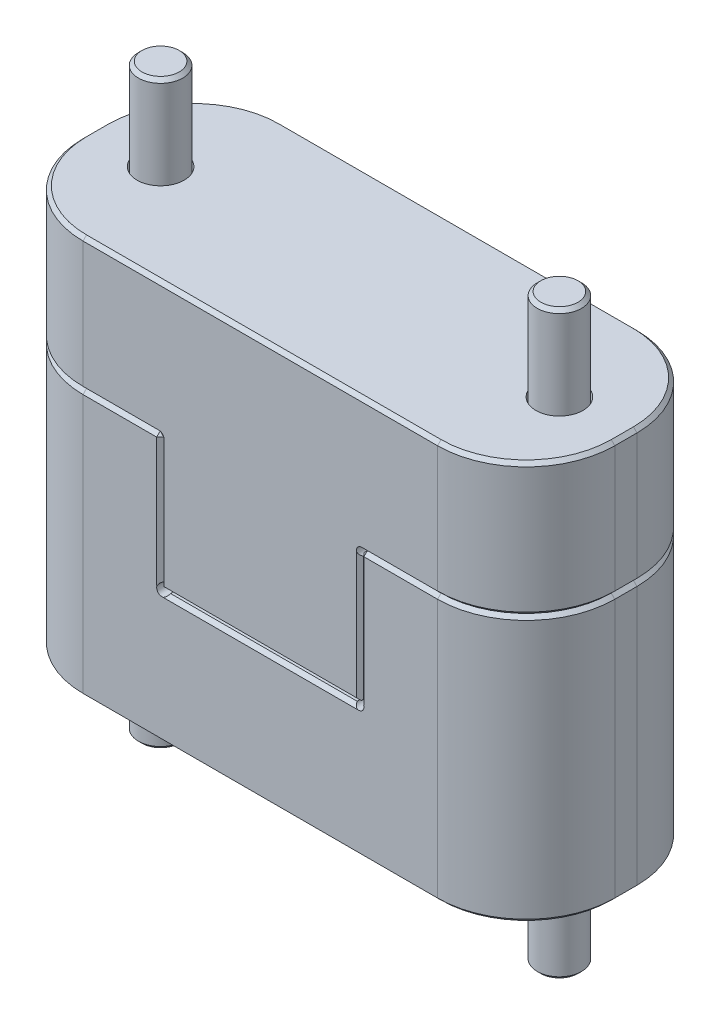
ISO-10303-21;
HEADER;
FILE_DESCRIPTION(('STEP AP214'),'2;1');
FILE_NAME('part.step','',(''),(''),'','','');
FILE_SCHEMA(('AUTOMOTIVE_DESIGN { 1 0 10303 214 1 1 1 1 }'));
ENDSEC;
DATA;
#1=APPLICATION_CONTEXT('core data for automotive mechanical design processes');
#2=APPLICATION_PROTOCOL_DEFINITION('international standard','automotive_design',2000,#1);
#3=PRODUCT_CONTEXT('',#1,'mechanical');
#4=PRODUCT('Part','Part','',(#3));
#5=PRODUCT_RELATED_PRODUCT_CATEGORY('part','',(#4));
#6=PRODUCT_DEFINITION_FORMATION('','',#4);
#7=PRODUCT_DEFINITION_CONTEXT('part definition',#1,'design');
#8=PRODUCT_DEFINITION('design','',#6,#7);
#9=PRODUCT_DEFINITION_SHAPE('','',#8);
#10=(LENGTH_UNIT() NAMED_UNIT(*) SI_UNIT(.MILLI.,.METRE.));
#11=(NAMED_UNIT(*) PLANE_ANGLE_UNIT() SI_UNIT($,.RADIAN.));
#12=(NAMED_UNIT(*) SI_UNIT($,.STERADIAN.) SOLID_ANGLE_UNIT());
#13=UNCERTAINTY_MEASURE_WITH_UNIT(LENGTH_MEASURE(1.E-05),#10,'distance_accuracy_value','');
#14=(GEOMETRIC_REPRESENTATION_CONTEXT(3) GLOBAL_UNCERTAINTY_ASSIGNED_CONTEXT((#13)) GLOBAL_UNIT_ASSIGNED_CONTEXT((#10,
#11,#12)) REPRESENTATION_CONTEXT('',''));
#15=CARTESIAN_POINT('',(0.,0.,0.));
#16=DIRECTION('',(0.,0.,1.));
#17=DIRECTION('',(1.,0.,0.));
#18=AXIS2_PLACEMENT_3D('',#15,#16,#17);
#19=CARTESIAN_POINT('',(28.575,-44.831,0.));
#20=DIRECTION('',(0.,1.,0.));
#21=DIRECTION('',(0.,0.,1.));
#22=AXIS2_PLACEMENT_3D('',#19,#20,#21);
#23=PLANE('',#22);
#24=CARTESIAN_POINT('',(28.575,-44.831,0.));
#25=DIRECTION('',(0.,-1.,0.));
#26=DIRECTION('',(0.,0.,1.));
#27=AXIS2_PLACEMENT_3D('',#24,#25,#26);
#28=CIRCLE('',#27,4.7625);
#29=CARTESIAN_POINT('',(28.575,-44.831,4.7625));
#30=VERTEX_POINT('',#29);
#31=EDGE_CURVE('E137',#30,#30,#28,.T.);
#32=ORIENTED_EDGE('',*,*,#31,.T.);
#33=EDGE_LOOP('',(#32));
#34=FACE_BOUND('',#33,.T.);
#35=CARTESIAN_POINT('',(28.575,-44.831,0.));
#36=DIRECTION('',(0.,-1.,0.));
#37=DIRECTION('',(0.,0.,1.));
#38=AXIS2_PLACEMENT_3D('',#35,#36,#37);
#39=CIRCLE('',#38,3.175);
#40=CARTESIAN_POINT('',(28.575,-44.831,3.175));
#41=VERTEX_POINT('',#40);
#42=EDGE_CURVE('E136',#41,#41,#39,.F.);
#43=ORIENTED_EDGE('',*,*,#42,.T.);
#44=EDGE_LOOP('',(#43));
#45=FACE_BOUND('',#44,.T.);
#46=ADVANCED_FACE('F43',(#34,#45),#23,.F.);
#47=CARTESIAN_POINT('',(28.575,-38.481,0.));
#48=DIRECTION('',(0.,-1.,0.));
#49=DIRECTION('',(0.,0.,-1.));
#50=AXIS2_PLACEMENT_3D('',#47,#48,#49);
#51=CYLINDRICAL_SURFACE('',#50,4.7625);
#52=CARTESIAN_POINT('',(28.575,-38.481,0.));
#53=DIRECTION('',(0.,-1.,0.));
#54=DIRECTION('',(0.,0.,1.));
#55=AXIS2_PLACEMENT_3D('',#52,#53,#54);
#56=CIRCLE('',#55,4.7625);
#57=CARTESIAN_POINT('',(28.575,-38.481,4.7625));
#58=VERTEX_POINT('',#57);
#59=EDGE_CURVE('E133',#58,#58,#56,.T.);
#60=ORIENTED_EDGE('',*,*,#59,.T.);
#61=EDGE_LOOP('',(#60));
#62=FACE_BOUND('',#61,.T.);
#63=ORIENTED_EDGE('',*,*,#31,.F.);
#64=EDGE_LOOP('',(#63));
#65=FACE_BOUND('',#64,.T.);
#66=ADVANCED_FACE('F157',(#62,#65),#51,.T.);
#67=CARTESIAN_POINT('',(28.575,-38.481,0.));
#68=DIRECTION('',(0.,1.,0.));
#69=DIRECTION('',(0.,0.,1.));
#70=AXIS2_PLACEMENT_3D('',#67,#68,#69);
#71=PLANE('',#70);
#72=DIRECTION('',(-0.499999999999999,0.,-0.866025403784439));
#73=VECTOR('',#72,1.);
#74=CARTESIAN_POINT('',(27.2001846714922,-38.481,2.38125000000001));
#75=LINE('',#74,#73);
#76=CARTESIAN_POINT('',(27.2001846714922,-38.481,2.38125000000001));
#77=VERTEX_POINT('',#76);
#78=CARTESIAN_POINT('',(25.8253693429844,-38.481,0.));
#79=VERTEX_POINT('',#78);
#80=EDGE_CURVE('E278',#77,#79,#75,.T.);
#81=ORIENTED_EDGE('',*,*,#80,.T.);
#82=DIRECTION('',(0.500000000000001,0.,-0.866025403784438));
#83=VECTOR('',#82,1.);
#84=CARTESIAN_POINT('',(25.8253693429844,-38.481,0.));
#85=LINE('',#84,#83);
#86=CARTESIAN_POINT('',(27.2001846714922,-38.481,-2.38125));
#87=VERTEX_POINT('',#86);
#88=EDGE_CURVE('E275',#79,#87,#85,.T.);
#89=ORIENTED_EDGE('',*,*,#88,.T.);
#90=DIRECTION('',(1.,0.,0.));
#91=VECTOR('',#90,1.);
#92=CARTESIAN_POINT('',(27.2001846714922,-38.481,-2.38125));
#93=LINE('',#92,#91);
#94=CARTESIAN_POINT('',(29.9498153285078,-38.481,-2.38125));
#95=VERTEX_POINT('',#94);
#96=EDGE_CURVE('E271',#87,#95,#93,.T.);
#97=ORIENTED_EDGE('',*,*,#96,.T.);
#98=DIRECTION('',(0.5,0.,0.866025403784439));
#99=VECTOR('',#98,1.);
#100=CARTESIAN_POINT('',(29.9498153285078,-38.481,-2.38125));
#101=LINE('',#100,#99);
#102=CARTESIAN_POINT('',(31.3246306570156,-38.481,0.));
#103=VERTEX_POINT('',#102);
#104=EDGE_CURVE('E269',#95,#103,#101,.T.);
#105=ORIENTED_EDGE('',*,*,#104,.T.);
#106=DIRECTION('',(-0.5,0.,0.866025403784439));
#107=VECTOR('',#106,1.);
#108=CARTESIAN_POINT('',(31.3246306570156,-38.481,0.));
#109=LINE('',#108,#107);
#110=CARTESIAN_POINT('',(29.9498153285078,-38.481,2.38125000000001));
#111=VERTEX_POINT('',#110);
#112=EDGE_CURVE('E122',#103,#111,#109,.T.);
#113=ORIENTED_EDGE('',*,*,#112,.T.);
#114=DIRECTION('',(-1.,0.,0.));
#115=VECTOR('',#114,1.);
#116=CARTESIAN_POINT('',(29.9498153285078,-38.481,2.38125000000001));
#117=LINE('',#116,#115);
#118=EDGE_CURVE('E263',#111,#77,#117,.T.);
#119=ORIENTED_EDGE('',*,*,#118,.T.);
#120=EDGE_LOOP('',(#81,#89,#97,#105,#113,#119));
#121=FACE_BOUND('',#120,.T.);
#122=ORIENTED_EDGE('',*,*,#59,.F.);
#123=EDGE_LOOP('',(#122));
#124=FACE_BOUND('',#123,.T.);
#125=ADVANCED_FACE('F163',(#121,#124),#71,.T.);
#126=CARTESIAN_POINT('',(27.2001846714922,-41.529,2.38125000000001));
#127=DIRECTION('',(-0.866025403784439,0.,0.499999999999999));
#128=DIRECTION('',(-0.499999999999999,0.,-0.86602540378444));
#129=AXIS2_PLACEMENT_3D('',#126,#127,#128);
#130=PLANE('',#129);
#131=ORIENTED_EDGE('',*,*,#80,.F.);
#132=DIRECTION('',(0.,1.,0.));
#133=VECTOR('',#132,1.);
#134=CARTESIAN_POINT('',(27.2001846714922,-41.529,2.38125000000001));
#135=LINE('',#134,#133);
#136=CARTESIAN_POINT('',(27.2001846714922,-41.529,2.38125000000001));
#137=VERTEX_POINT('',#136);
#138=EDGE_CURVE('E89',#137,#77,#135,.T.);
#139=ORIENTED_EDGE('',*,*,#138,.F.);
#140=DIRECTION('',(-0.499999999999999,0.,-0.866025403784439));
#141=VECTOR('',#140,1.);
#142=CARTESIAN_POINT('',(27.2001846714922,-41.529,2.38125000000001));
#143=LINE('',#142,#141);
#144=CARTESIAN_POINT('',(25.8253693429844,-41.529,0.));
#145=VERTEX_POINT('',#144);
#146=EDGE_CURVE('E265',#137,#145,#143,.T.);
#147=ORIENTED_EDGE('',*,*,#146,.T.);
#148=DIRECTION('',(0.,1.,0.));
#149=VECTOR('',#148,1.);
#150=CARTESIAN_POINT('',(25.8253693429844,-41.529,0.));
#151=LINE('',#150,#149);
#152=EDGE_CURVE('E58',#145,#79,#151,.T.);
#153=ORIENTED_EDGE('',*,*,#152,.T.);
#154=EDGE_LOOP('',(#131,#139,#147,#153));
#155=FACE_BOUND('',#154,.T.);
#156=ADVANCED_FACE('F169',(#155),#130,.F.);
#157=CARTESIAN_POINT('',(29.9498153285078,-41.529,2.38125000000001));
#158=DIRECTION('',(0.,0.,1.));
#159=DIRECTION('',(-1.,0.,0.));
#160=AXIS2_PLACEMENT_3D('',#157,#158,#159);
#161=PLANE('',#160);
#162=ORIENTED_EDGE('',*,*,#118,.F.);
#163=DIRECTION('',(0.,1.,0.));
#164=VECTOR('',#163,1.);
#165=CARTESIAN_POINT('',(29.9498153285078,-41.529,2.38125000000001));
#166=LINE('',#165,#164);
#167=CARTESIAN_POINT('',(29.9498153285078,-41.529,2.38125000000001));
#168=VERTEX_POINT('',#167);
#169=EDGE_CURVE('E124',#168,#111,#166,.T.);
#170=ORIENTED_EDGE('',*,*,#169,.F.);
#171=DIRECTION('',(-1.,0.,0.));
#172=VECTOR('',#171,1.);
#173=CARTESIAN_POINT('',(29.9498153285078,-41.529,2.38125000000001));
#174=LINE('',#173,#172);
#175=EDGE_CURVE('E67',#168,#137,#174,.T.);
#176=ORIENTED_EDGE('',*,*,#175,.T.);
#177=ORIENTED_EDGE('',*,*,#138,.T.);
#178=EDGE_LOOP('',(#162,#170,#176,#177));
#179=FACE_BOUND('',#178,.T.);
#180=ADVANCED_FACE('F173',(#179),#161,.F.);
#181=CARTESIAN_POINT('',(31.3246306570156,-41.529,0.));
#182=DIRECTION('',(0.866025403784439,0.,0.5));
#183=DIRECTION('',(-0.5,0.,0.866025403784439));
#184=AXIS2_PLACEMENT_3D('',#181,#182,#183);
#185=PLANE('',#184);
#186=ORIENTED_EDGE('',*,*,#112,.F.);
#187=DIRECTION('',(0.,1.,0.));
#188=VECTOR('',#187,1.);
#189=CARTESIAN_POINT('',(31.3246306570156,-41.529,0.));
#190=LINE('',#189,#188);
#191=CARTESIAN_POINT('',(31.3246306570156,-41.529,0.));
#192=VERTEX_POINT('',#191);
#193=EDGE_CURVE('E111',#192,#103,#190,.T.);
#194=ORIENTED_EDGE('',*,*,#193,.F.);
#195=DIRECTION('',(-0.5,0.,0.866025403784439));
#196=VECTOR('',#195,1.);
#197=CARTESIAN_POINT('',(31.3246306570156,-41.529,0.));
#198=LINE('',#197,#196);
#199=EDGE_CURVE('E114',#192,#168,#198,.T.);
#200=ORIENTED_EDGE('',*,*,#199,.T.);
#201=ORIENTED_EDGE('',*,*,#169,.T.);
#202=EDGE_LOOP('',(#186,#194,#200,#201));
#203=FACE_BOUND('',#202,.T.);
#204=ADVANCED_FACE('F120',(#203),#185,.F.);
#205=CARTESIAN_POINT('',(29.9498153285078,-41.529,-2.38125));
#206=DIRECTION('',(0.866025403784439,0.,-0.5));
#207=DIRECTION('',(0.5,0.,0.866025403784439));
#208=AXIS2_PLACEMENT_3D('',#205,#206,#207);
#209=PLANE('',#208);
#210=ORIENTED_EDGE('',*,*,#104,.F.);
#211=DIRECTION('',(0.,1.,0.));
#212=VECTOR('',#211,1.);
#213=CARTESIAN_POINT('',(29.9498153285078,-41.529,-2.38125));
#214=LINE('',#213,#212);
#215=CARTESIAN_POINT('',(29.9498153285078,-41.529,-2.38125));
#216=VERTEX_POINT('',#215);
#217=EDGE_CURVE('E113',#216,#95,#214,.T.);
#218=ORIENTED_EDGE('',*,*,#217,.F.);
#219=DIRECTION('',(0.5,0.,0.866025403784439));
#220=VECTOR('',#219,1.);
#221=CARTESIAN_POINT('',(29.9498153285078,-41.529,-2.38125));
#222=LINE('',#221,#220);
#223=EDGE_CURVE('E106',#216,#192,#222,.T.);
#224=ORIENTED_EDGE('',*,*,#223,.T.);
#225=ORIENTED_EDGE('',*,*,#193,.T.);
#226=EDGE_LOOP('',(#210,#218,#224,#225));
#227=FACE_BOUND('',#226,.T.);
#228=ADVANCED_FACE('F109',(#227),#209,.F.);
#229=CARTESIAN_POINT('',(27.2001846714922,-41.529,-2.38125));
#230=DIRECTION('',(0.,0.,-1.));
#231=DIRECTION('',(1.,0.,0.));
#232=AXIS2_PLACEMENT_3D('',#229,#230,#231);
#233=PLANE('',#232);
#234=ORIENTED_EDGE('',*,*,#96,.F.);
#235=DIRECTION('',(0.,1.,0.));
#236=VECTOR('',#235,1.);
#237=CARTESIAN_POINT('',(27.2001846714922,-41.529,-2.38125));
#238=LINE('',#237,#236);
#239=CARTESIAN_POINT('',(27.2001846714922,-41.529,-2.38125));
#240=VERTEX_POINT('',#239);
#241=EDGE_CURVE('E127',#240,#87,#238,.T.);
#242=ORIENTED_EDGE('',*,*,#241,.F.);
#243=DIRECTION('',(1.,0.,0.));
#244=VECTOR('',#243,1.);
#245=CARTESIAN_POINT('',(27.2001846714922,-41.529,-2.38125));
#246=LINE('',#245,#244);
#247=EDGE_CURVE('E115',#240,#216,#246,.T.);
#248=ORIENTED_EDGE('',*,*,#247,.T.);
#249=ORIENTED_EDGE('',*,*,#217,.T.);
#250=EDGE_LOOP('',(#234,#242,#248,#249));
#251=FACE_BOUND('',#250,.T.);
#252=ADVANCED_FACE('F177',(#251),#233,.F.);
#253=CARTESIAN_POINT('',(25.8253693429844,-41.529,0.));
#254=DIRECTION('',(-0.866025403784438,0.,-0.500000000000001));
#255=DIRECTION('',(0.500000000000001,0.,-0.866025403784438));
#256=AXIS2_PLACEMENT_3D('',#253,#254,#255);
#257=PLANE('',#256);
#258=ORIENTED_EDGE('',*,*,#88,.F.);
#259=ORIENTED_EDGE('',*,*,#152,.F.);
#260=DIRECTION('',(0.500000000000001,0.,-0.866025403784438));
#261=VECTOR('',#260,1.);
#262=CARTESIAN_POINT('',(25.8253693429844,-41.529,0.));
#263=LINE('',#262,#261);
#264=EDGE_CURVE('E97',#145,#240,#263,.T.);
#265=ORIENTED_EDGE('',*,*,#264,.T.);
#266=ORIENTED_EDGE('',*,*,#241,.T.);
#267=EDGE_LOOP('',(#258,#259,#265,#266));
#268=FACE_BOUND('',#267,.T.);
#269=ADVANCED_FACE('F174',(#268),#257,.F.);
#270=CARTESIAN_POINT('',(25.8253693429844,-41.529,0.));
#271=DIRECTION('',(0.,1.,0.));
#272=DIRECTION('',(0.,0.,1.));
#273=AXIS2_PLACEMENT_3D('',#270,#271,#272);
#274=PLANE('',#273);
#275=ORIENTED_EDGE('',*,*,#146,.F.);
#276=ORIENTED_EDGE('',*,*,#175,.F.);
#277=ORIENTED_EDGE('',*,*,#199,.F.);
#278=ORIENTED_EDGE('',*,*,#223,.F.);
#279=ORIENTED_EDGE('',*,*,#247,.F.);
#280=ORIENTED_EDGE('',*,*,#264,.F.);
#281=EDGE_LOOP('',(#275,#276,#277,#278,#279,#280));
#282=FACE_BOUND('',#281,.T.);
#283=ADVANCED_FACE('F117',(#282),#274,.T.);
#284=CARTESIAN_POINT('',(28.575,-70.231,0.));
#285=DIRECTION('',(0.,1.,0.));
#286=DIRECTION('',(0.,0.,1.));
#287=AXIS2_PLACEMENT_3D('',#284,#285,#286);
#288=CYLINDRICAL_SURFACE('',#287,3.175);
#289=CARTESIAN_POINT('',(28.575,-69.723,0.));
#290=DIRECTION('',(0.,1.,0.));
#291=DIRECTION('',(0.,0.,-1.));
#292=AXIS2_PLACEMENT_3D('',#289,#290,#291);
#293=CIRCLE('',#292,3.175);
#294=CARTESIAN_POINT('',(28.575,-69.723,-3.175));
#295=VERTEX_POINT('',#294);
#296=EDGE_CURVE('E13',#295,#295,#293,.F.);
#297=ORIENTED_EDGE('',*,*,#296,.F.);
#298=EDGE_LOOP('',(#297));
#299=FACE_BOUND('',#298,.T.);
#300=ORIENTED_EDGE('',*,*,#42,.F.);
#301=EDGE_LOOP('',(#300));
#302=FACE_BOUND('',#301,.T.);
#303=ADVANCED_FACE('F147',(#299,#302),#288,.T.);
#304=CARTESIAN_POINT('',(28.575,-70.231,0.));
#305=DIRECTION('',(0.,-1.,0.));
#306=DIRECTION('',(0.,0.,-1.));
#307=AXIS2_PLACEMENT_3D('',#304,#305,#306);
#308=PLANE('',#307);
#309=CARTESIAN_POINT('',(28.575,-70.231,0.));
#310=DIRECTION('',(0.,1.,0.));
#311=DIRECTION('',(0.,0.,-1.));
#312=AXIS2_PLACEMENT_3D('',#309,#310,#311);
#313=CIRCLE('',#312,2.667);
#314=CARTESIAN_POINT('',(28.575,-70.231,-2.667));
#315=VERTEX_POINT('',#314);
#316=EDGE_CURVE('E51',#315,#315,#313,.T.);
#317=ORIENTED_EDGE('',*,*,#316,.F.);
#318=EDGE_LOOP('',(#317));
#319=FACE_BOUND('',#318,.T.);
#320=ADVANCED_FACE('F145',(#319),#308,.T.);
#321=CARTESIAN_POINT('',(28.575,-70.231,0.));
#322=DIRECTION('',(0.,1.,0.));
#323=DIRECTION('',(0.,0.,1.));
#324=AXIS2_PLACEMENT_3D('',#321,#322,#323);
#325=CONICAL_SURFACE('',#324,2.667,0.785398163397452);
#326=ORIENTED_EDGE('',*,*,#296,.T.);
#327=EDGE_LOOP('',(#326));
#328=FACE_BOUND('',#327,.T.);
#329=ORIENTED_EDGE('',*,*,#316,.T.);
#330=EDGE_LOOP('',(#329));
#331=FACE_BOUND('',#330,.T.);
#332=ADVANCED_FACE('F45',(#328,#331),#325,.T.);
#333=CLOSED_SHELL('',(#46,#66,#125,#156,#180,#204,#228,#252,#269,#283,#303,#320,#332));
#334=MANIFOLD_SOLID_BREP('B2',#333);
#335=CARTESIAN_POINT('',(-28.575,-44.831,0.));
#336=DIRECTION('',(0.,1.,0.));
#337=DIRECTION('',(0.,0.,1.));
#338=AXIS2_PLACEMENT_3D('',#335,#336,#337);
#339=PLANE('',#338);
#340=CARTESIAN_POINT('',(-28.575,-44.831,0.));
#341=DIRECTION('',(0.,1.,0.));
#342=DIRECTION('',(0.,0.,1.));
#343=AXIS2_PLACEMENT_3D('',#340,#341,#342);
#344=CIRCLE('',#343,4.7625);
#345=CARTESIAN_POINT('',(-28.575,-44.831,4.7625));
#346=VERTEX_POINT('',#345);
#347=EDGE_CURVE('E405',#346,#346,#344,.T.);
#348=ORIENTED_EDGE('',*,*,#347,.F.);
#349=EDGE_LOOP('',(#348));
#350=FACE_BOUND('',#349,.T.);
#351=CARTESIAN_POINT('',(-28.575,-44.831,0.));
#352=DIRECTION('',(0.,1.,0.));
#353=DIRECTION('',(0.,0.,1.));
#354=AXIS2_PLACEMENT_3D('',#351,#352,#353);
#355=CIRCLE('',#354,3.175);
#356=CARTESIAN_POINT('',(-28.575,-44.831,3.175));
#357=VERTEX_POINT('',#356);
#358=EDGE_CURVE('E414',#357,#357,#355,.F.);
#359=ORIENTED_EDGE('',*,*,#358,.F.);
#360=EDGE_LOOP('',(#359));
#361=FACE_BOUND('',#360,.T.);
#362=ADVANCED_FACE('F303',(#350,#361),#339,.F.);
#363=CARTESIAN_POINT('',(-28.575,-38.481,0.));
#364=DIRECTION('',(0.,-1.,0.));
#365=DIRECTION('',(0.,0.,-1.));
#366=AXIS2_PLACEMENT_3D('',#363,#364,#365);
#367=CYLINDRICAL_SURFACE('',#366,4.7625);
#368=CARTESIAN_POINT('',(-28.575,-38.481,0.));
#369=DIRECTION('',(0.,1.,0.));
#370=DIRECTION('',(0.,0.,1.));
#371=AXIS2_PLACEMENT_3D('',#368,#369,#370);
#372=CIRCLE('',#371,4.7625);
#373=CARTESIAN_POINT('',(-28.575,-38.481,4.7625));
#374=VERTEX_POINT('',#373);
#375=EDGE_CURVE('E411',#374,#374,#372,.T.);
#376=ORIENTED_EDGE('',*,*,#375,.F.);
#377=EDGE_LOOP('',(#376));
#378=FACE_BOUND('',#377,.T.);
#379=ORIENTED_EDGE('',*,*,#347,.T.);
#380=EDGE_LOOP('',(#379));
#381=FACE_BOUND('',#380,.T.);
#382=ADVANCED_FACE('F432',(#378,#381),#367,.T.);
#383=CARTESIAN_POINT('',(-28.575,-38.481,0.));
#384=DIRECTION('',(0.,1.,0.));
#385=DIRECTION('',(0.,0.,1.));
#386=AXIS2_PLACEMENT_3D('',#383,#384,#385);
#387=PLANE('',#386);
#388=DIRECTION('',(0.499999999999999,0.,-0.866025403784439));
#389=VECTOR('',#388,1.);
#390=CARTESIAN_POINT('',(-27.2001846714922,-38.481,2.38125000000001));
#391=LINE('',#390,#389);
#392=CARTESIAN_POINT('',(-27.2001846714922,-38.481,2.38125000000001));
#393=VERTEX_POINT('',#392);
#394=CARTESIAN_POINT('',(-25.8253693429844,-38.481,0.));
#395=VERTEX_POINT('',#394);
#396=EDGE_CURVE('E318',#393,#395,#391,.T.);
#397=ORIENTED_EDGE('',*,*,#396,.F.);
#398=DIRECTION('',(1.,0.,0.));
#399=VECTOR('',#398,1.);
#400=CARTESIAN_POINT('',(-29.9498153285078,-38.481,2.38125000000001));
#401=LINE('',#400,#399);
#402=CARTESIAN_POINT('',(-29.9498153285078,-38.481,2.38125000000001));
#403=VERTEX_POINT('',#402);
#404=EDGE_CURVE('E401',#403,#393,#401,.T.);
#405=ORIENTED_EDGE('',*,*,#404,.F.);
#406=DIRECTION('',(0.5,0.,0.866025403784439));
#407=VECTOR('',#406,1.);
#408=CARTESIAN_POINT('',(-31.3246306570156,-38.481,0.));
#409=LINE('',#408,#407);
#410=CARTESIAN_POINT('',(-31.3246306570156,-38.481,0.));
#411=VERTEX_POINT('',#410);
#412=EDGE_CURVE('E399',#411,#403,#409,.T.);
#413=ORIENTED_EDGE('',*,*,#412,.F.);
#414=DIRECTION('',(-0.5,0.,0.866025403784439));
#415=VECTOR('',#414,1.);
#416=CARTESIAN_POINT('',(-29.9498153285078,-38.481,-2.38125));
#417=LINE('',#416,#415);
#418=CARTESIAN_POINT('',(-29.9498153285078,-38.481,-2.38125));
#419=VERTEX_POINT('',#418);
#420=EDGE_CURVE('E366',#419,#411,#417,.T.);
#421=ORIENTED_EDGE('',*,*,#420,.F.);
#422=DIRECTION('',(-1.,0.,0.));
#423=VECTOR('',#422,1.);
#424=CARTESIAN_POINT('',(-27.2001846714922,-38.481,-2.38125));
#425=LINE('',#424,#423);
#426=CARTESIAN_POINT('',(-27.2001846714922,-38.481,-2.38125));
#427=VERTEX_POINT('',#426);
#428=EDGE_CURVE('E395',#427,#419,#425,.T.);
#429=ORIENTED_EDGE('',*,*,#428,.F.);
#430=DIRECTION('',(-0.500000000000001,0.,-0.866025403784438));
#431=VECTOR('',#430,1.);
#432=CARTESIAN_POINT('',(-25.8253693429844,-38.481,0.));
#433=LINE('',#432,#431);
#434=EDGE_CURVE('E392',#395,#427,#433,.T.);
#435=ORIENTED_EDGE('',*,*,#434,.F.);
#436=EDGE_LOOP('',(#397,#405,#413,#421,#429,#435));
#437=FACE_BOUND('',#436,.T.);
#438=ORIENTED_EDGE('',*,*,#375,.T.);
#439=EDGE_LOOP('',(#438));
#440=FACE_BOUND('',#439,.T.);
#441=ADVANCED_FACE('F438',(#437,#440),#387,.T.);
#442=CARTESIAN_POINT('',(-27.2001846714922,-41.529,2.38125000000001));
#443=DIRECTION('',(0.866025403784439,0.,0.499999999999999));
#444=DIRECTION('',(0.499999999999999,0.,-0.86602540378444));
#445=AXIS2_PLACEMENT_3D('',#442,#443,#444);
#446=PLANE('',#445);
#447=ORIENTED_EDGE('',*,*,#396,.T.);
#448=DIRECTION('',(0.,1.,0.));
#449=VECTOR('',#448,1.);
#450=CARTESIAN_POINT('',(-25.8253693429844,-41.529,0.));
#451=LINE('',#450,#449);
#452=CARTESIAN_POINT('',(-25.8253693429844,-41.529,0.));
#453=VERTEX_POINT('',#452);
#454=EDGE_CURVE('E348',#453,#395,#451,.T.);
#455=ORIENTED_EDGE('',*,*,#454,.F.);
#456=DIRECTION('',(0.499999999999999,0.,-0.866025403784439));
#457=VECTOR('',#456,1.);
#458=CARTESIAN_POINT('',(-27.2001846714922,-41.529,2.38125000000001));
#459=LINE('',#458,#457);
#460=CARTESIAN_POINT('',(-27.2001846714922,-41.529,2.38125000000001));
#461=VERTEX_POINT('',#460);
#462=EDGE_CURVE('E403',#461,#453,#459,.T.);
#463=ORIENTED_EDGE('',*,*,#462,.F.);
#464=DIRECTION('',(0.,1.,0.));
#465=VECTOR('',#464,1.);
#466=CARTESIAN_POINT('',(-27.2001846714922,-41.529,2.38125000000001));
#467=LINE('',#466,#465);
#468=EDGE_CURVE('E326',#461,#393,#467,.T.);
#469=ORIENTED_EDGE('',*,*,#468,.T.);
#470=EDGE_LOOP('',(#447,#455,#463,#469));
#471=FACE_BOUND('',#470,.T.);
#472=ADVANCED_FACE('F445',(#471),#446,.F.);
#473=CARTESIAN_POINT('',(-29.9498153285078,-41.529,2.38125000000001));
#474=DIRECTION('',(0.,0.,1.));
#475=DIRECTION('',(1.,0.,0.));
#476=AXIS2_PLACEMENT_3D('',#473,#474,#475);
#477=PLANE('',#476);
#478=ORIENTED_EDGE('',*,*,#404,.T.);
#479=ORIENTED_EDGE('',*,*,#468,.F.);
#480=DIRECTION('',(1.,0.,0.));
#481=VECTOR('',#480,1.);
#482=CARTESIAN_POINT('',(-29.9498153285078,-41.529,2.38125000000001));
#483=LINE('',#482,#481);
#484=CARTESIAN_POINT('',(-29.9498153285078,-41.529,2.38125000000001));
#485=VERTEX_POINT('',#484);
#486=EDGE_CURVE('E378',#485,#461,#483,.T.);
#487=ORIENTED_EDGE('',*,*,#486,.F.);
#488=DIRECTION('',(0.,1.,0.));
#489=VECTOR('',#488,1.);
#490=CARTESIAN_POINT('',(-29.9498153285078,-41.529,2.38125000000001));
#491=LINE('',#490,#489);
#492=EDGE_CURVE('E370',#485,#403,#491,.T.);
#493=ORIENTED_EDGE('',*,*,#492,.T.);
#494=EDGE_LOOP('',(#478,#479,#487,#493));
#495=FACE_BOUND('',#494,.T.);
#496=ADVANCED_FACE('F449',(#495),#477,.F.);
#497=CARTESIAN_POINT('',(-31.3246306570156,-41.529,0.));
#498=DIRECTION('',(-0.866025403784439,0.,0.5));
#499=DIRECTION('',(0.5,0.,0.866025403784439));
#500=AXIS2_PLACEMENT_3D('',#497,#498,#499);
#501=PLANE('',#500);
#502=ORIENTED_EDGE('',*,*,#412,.T.);
#503=ORIENTED_EDGE('',*,*,#492,.F.);
#504=DIRECTION('',(0.5,0.,0.866025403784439));
#505=VECTOR('',#504,1.);
#506=CARTESIAN_POINT('',(-31.3246306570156,-41.529,0.));
#507=LINE('',#506,#505);
#508=CARTESIAN_POINT('',(-31.3246306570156,-41.529,0.));
#509=VERTEX_POINT('',#508);
#510=EDGE_CURVE('E374',#509,#485,#507,.T.);
#511=ORIENTED_EDGE('',*,*,#510,.F.);
#512=DIRECTION('',(0.,1.,0.));
#513=VECTOR('',#512,1.);
#514=CARTESIAN_POINT('',(-31.3246306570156,-41.529,0.));
#515=LINE('',#514,#513);
#516=EDGE_CURVE('E359',#509,#411,#515,.T.);
#517=ORIENTED_EDGE('',*,*,#516,.T.);
#518=EDGE_LOOP('',(#502,#503,#511,#517));
#519=FACE_BOUND('',#518,.T.);
#520=ADVANCED_FACE('F375',(#519),#501,.F.);
#521=CARTESIAN_POINT('',(-29.9498153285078,-41.529,-2.38125));
#522=DIRECTION('',(-0.866025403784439,0.,-0.5));
#523=DIRECTION('',(-0.5,0.,0.866025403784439));
#524=AXIS2_PLACEMENT_3D('',#521,#522,#523);
#525=PLANE('',#524);
#526=ORIENTED_EDGE('',*,*,#420,.T.);
#527=ORIENTED_EDGE('',*,*,#516,.F.);
#528=DIRECTION('',(-0.5,0.,0.866025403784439));
#529=VECTOR('',#528,1.);
#530=CARTESIAN_POINT('',(-29.9498153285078,-41.529,-2.38125));
#531=LINE('',#530,#529);
#532=CARTESIAN_POINT('',(-29.9498153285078,-41.529,-2.38125));
#533=VERTEX_POINT('',#532);
#534=EDGE_CURVE('E363',#533,#509,#531,.T.);
#535=ORIENTED_EDGE('',*,*,#534,.F.);
#536=DIRECTION('',(0.,1.,0.));
#537=VECTOR('',#536,1.);
#538=CARTESIAN_POINT('',(-29.9498153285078,-41.529,-2.38125));
#539=LINE('',#538,#537);
#540=EDGE_CURVE('E371',#533,#419,#539,.T.);
#541=ORIENTED_EDGE('',*,*,#540,.T.);
#542=EDGE_LOOP('',(#526,#527,#535,#541));
#543=FACE_BOUND('',#542,.T.);
#544=ADVANCED_FACE('F361',(#543),#525,.F.);
#545=CARTESIAN_POINT('',(-27.2001846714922,-41.529,-2.38125));
#546=DIRECTION('',(0.,0.,-1.));
#547=DIRECTION('',(-1.,0.,0.));
#548=AXIS2_PLACEMENT_3D('',#545,#546,#547);
#549=PLANE('',#548);
#550=ORIENTED_EDGE('',*,*,#428,.T.);
#551=ORIENTED_EDGE('',*,*,#540,.F.);
#552=DIRECTION('',(-1.,0.,0.));
#553=VECTOR('',#552,1.);
#554=CARTESIAN_POINT('',(-27.2001846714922,-41.529,-2.38125));
#555=LINE('',#554,#553);
#556=CARTESIAN_POINT('',(-27.2001846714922,-41.529,-2.38125));
#557=VERTEX_POINT('',#556);
#558=EDGE_CURVE('E384',#557,#533,#555,.T.);
#559=ORIENTED_EDGE('',*,*,#558,.F.);
#560=DIRECTION('',(0.,1.,0.));
#561=VECTOR('',#560,1.);
#562=CARTESIAN_POINT('',(-27.2001846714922,-41.529,-2.38125));
#563=LINE('',#562,#561);
#564=EDGE_CURVE('E408',#557,#427,#563,.T.);
#565=ORIENTED_EDGE('',*,*,#564,.T.);
#566=EDGE_LOOP('',(#550,#551,#559,#565));
#567=FACE_BOUND('',#566,.T.);
#568=ADVANCED_FACE('F453',(#567),#549,.F.);
#569=CARTESIAN_POINT('',(-25.8253693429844,-41.529,0.));
#570=DIRECTION('',(0.866025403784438,0.,-0.500000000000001));
#571=DIRECTION('',(-0.500000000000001,0.,-0.866025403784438));
#572=AXIS2_PLACEMENT_3D('',#569,#570,#571);
#573=PLANE('',#572);
#574=ORIENTED_EDGE('',*,*,#434,.T.);
#575=ORIENTED_EDGE('',*,*,#564,.F.);
#576=DIRECTION('',(-0.500000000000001,0.,-0.866025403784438));
#577=VECTOR('',#576,1.);
#578=CARTESIAN_POINT('',(-25.8253693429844,-41.529,0.));
#579=LINE('',#578,#577);
#580=EDGE_CURVE('E386',#453,#557,#579,.T.);
#581=ORIENTED_EDGE('',*,*,#580,.F.);
#582=ORIENTED_EDGE('',*,*,#454,.T.);
#583=EDGE_LOOP('',(#574,#575,#581,#582));
#584=FACE_BOUND('',#583,.T.);
#585=ADVANCED_FACE('F450',(#584),#573,.F.);
#586=CARTESIAN_POINT('',(-25.8253693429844,-41.529,0.));
#587=DIRECTION('',(0.,1.,0.));
#588=DIRECTION('',(0.,0.,1.));
#589=AXIS2_PLACEMENT_3D('',#586,#587,#588);
#590=PLANE('',#589);
#591=ORIENTED_EDGE('',*,*,#462,.T.);
#592=ORIENTED_EDGE('',*,*,#580,.T.);
#593=ORIENTED_EDGE('',*,*,#558,.T.);
#594=ORIENTED_EDGE('',*,*,#534,.T.);
#595=ORIENTED_EDGE('',*,*,#510,.T.);
#596=ORIENTED_EDGE('',*,*,#486,.T.);
#597=EDGE_LOOP('',(#591,#592,#593,#594,#595,#596));
#598=FACE_BOUND('',#597,.T.);
#599=ADVANCED_FACE('F381',(#598),#590,.T.);
#600=CARTESIAN_POINT('',(-28.575,-70.231,0.));
#601=DIRECTION('',(0.,1.,0.));
#602=DIRECTION('',(0.,0.,1.));
#603=AXIS2_PLACEMENT_3D('',#600,#601,#602);
#604=CYLINDRICAL_SURFACE('',#603,3.175);
#605=CARTESIAN_POINT('',(-28.575,-69.723,0.));
#606=DIRECTION('',(0.,-1.,0.));
#607=DIRECTION('',(0.,0.,-1.));
#608=AXIS2_PLACEMENT_3D('',#605,#606,#607);
#609=CIRCLE('',#608,3.175);
#610=CARTESIAN_POINT('',(-28.575,-69.723,-3.175));
#611=VERTEX_POINT('',#610);
#612=EDGE_CURVE('E41',#611,#611,#609,.F.);
#613=ORIENTED_EDGE('',*,*,#612,.T.);
#614=EDGE_LOOP('',(#613));
#615=FACE_BOUND('',#614,.T.);
#616=ORIENTED_EDGE('',*,*,#358,.T.);
#617=EDGE_LOOP('',(#616));
#618=FACE_BOUND('',#617,.T.);
#619=ADVANCED_FACE('F428',(#615,#618),#604,.T.);
#620=CARTESIAN_POINT('',(-28.575,-70.231,0.));
#621=DIRECTION('',(0.,-1.,0.));
#622=DIRECTION('',(0.,0.,-1.));
#623=AXIS2_PLACEMENT_3D('',#620,#621,#622);
#624=PLANE('',#623);
#625=CARTESIAN_POINT('',(-28.575,-70.231,0.));
#626=DIRECTION('',(0.,-1.,0.));
#627=DIRECTION('',(0.,0.,-1.));
#628=AXIS2_PLACEMENT_3D('',#625,#626,#627);
#629=CIRCLE('',#628,2.667);
#630=CARTESIAN_POINT('',(-28.575,-70.231,-2.667));
#631=VERTEX_POINT('',#630);
#632=EDGE_CURVE('E311',#631,#631,#629,.T.);
#633=ORIENTED_EDGE('',*,*,#632,.T.);
#634=EDGE_LOOP('',(#633));
#635=FACE_BOUND('',#634,.T.);
#636=ADVANCED_FACE('F421',(#635),#624,.T.);
#637=CARTESIAN_POINT('',(-28.575,-70.231,0.));
#638=DIRECTION('',(0.,1.,0.));
#639=DIRECTION('',(0.,0.,1.));
#640=AXIS2_PLACEMENT_3D('',#637,#638,#639);
#641=CONICAL_SURFACE('',#640,2.667,0.785398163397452);
#642=ORIENTED_EDGE('',*,*,#612,.F.);
#643=EDGE_LOOP('',(#642));
#644=FACE_BOUND('',#643,.T.);
#645=ORIENTED_EDGE('',*,*,#632,.F.);
#646=EDGE_LOOP('',(#645));
#647=FACE_BOUND('',#646,.T.);
#648=ADVANCED_FACE('F305',(#644,#647),#641,.T.);
#649=CLOSED_SHELL('',(#362,#382,#441,#472,#496,#520,#544,#568,#585,#599,#619,#636,#648));
#650=MANIFOLD_SOLID_BREP('B7',#649);
#651=CARTESIAN_POINT('',(28.575,-12.319,0.));
#652=DIRECTION('',(0.,-1.,0.));
#653=DIRECTION('',(0.,0.,-1.));
#654=AXIS2_PLACEMENT_3D('',#651,#652,#653);
#655=PLANE('',#654);
#656=CARTESIAN_POINT('',(28.575,-12.319,0.));
#657=DIRECTION('',(0.,1.,0.));
#658=DIRECTION('',(0.,0.,-1.));
#659=AXIS2_PLACEMENT_3D('',#656,#657,#658);
#660=CIRCLE('',#659,4.7625);
#661=CARTESIAN_POINT('',(28.575,-12.319,-4.76250000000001));
#662=VERTEX_POINT('',#661);
#663=EDGE_CURVE('E657',#662,#662,#660,.T.);
#664=ORIENTED_EDGE('',*,*,#663,.T.);
#665=EDGE_LOOP('',(#664));
#666=FACE_BOUND('',#665,.T.);
#667=CARTESIAN_POINT('',(28.575,-12.319,0.));
#668=DIRECTION('',(0.,1.,0.));
#669=DIRECTION('',(0.,0.,-1.));
#670=AXIS2_PLACEMENT_3D('',#667,#668,#669);
#671=CIRCLE('',#670,3.175);
#672=CARTESIAN_POINT('',(28.575,-12.319,-3.17500000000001));
#673=VERTEX_POINT('',#672);
#674=EDGE_CURVE('E656',#673,#673,#671,.F.);
#675=ORIENTED_EDGE('',*,*,#674,.T.);
#676=EDGE_LOOP('',(#675));
#677=FACE_BOUND('',#676,.T.);
#678=ADVANCED_FACE('F563',(#666,#677),#655,.F.);
#679=CARTESIAN_POINT('',(28.575,-18.669,0.));
#680=DIRECTION('',(0.,1.,0.));
#681=DIRECTION('',(0.,0.,1.));
#682=AXIS2_PLACEMENT_3D('',#679,#680,#681);
#683=CYLINDRICAL_SURFACE('',#682,4.7625);
#684=CARTESIAN_POINT('',(28.575,-18.669,0.));
#685=DIRECTION('',(0.,1.,0.));
#686=DIRECTION('',(0.,0.,-1.));
#687=AXIS2_PLACEMENT_3D('',#684,#685,#686);
#688=CIRCLE('',#687,4.7625);
#689=CARTESIAN_POINT('',(28.575,-18.669,-4.76250000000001));
#690=VERTEX_POINT('',#689);
#691=EDGE_CURVE('E653',#690,#690,#688,.T.);
#692=ORIENTED_EDGE('',*,*,#691,.T.);
#693=EDGE_LOOP('',(#692));
#694=FACE_BOUND('',#693,.T.);
#695=ORIENTED_EDGE('',*,*,#663,.F.);
#696=EDGE_LOOP('',(#695));
#697=FACE_BOUND('',#696,.T.);
#698=ADVANCED_FACE('F680',(#694,#697),#683,.T.);
#699=CARTESIAN_POINT('',(28.575,-18.669,0.));
#700=DIRECTION('',(0.,-1.,0.));
#701=DIRECTION('',(0.,0.,-1.));
#702=AXIS2_PLACEMENT_3D('',#699,#700,#701);
#703=PLANE('',#702);
#704=DIRECTION('',(-0.499999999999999,0.,0.866025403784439));
#705=VECTOR('',#704,1.);
#706=CARTESIAN_POINT('',(27.2001846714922,-18.669,-2.38125000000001));
#707=LINE('',#706,#705);
#708=CARTESIAN_POINT('',(27.2001846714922,-18.669,-2.38125000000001));
#709=VERTEX_POINT('',#708);
#710=CARTESIAN_POINT('',(25.8253693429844,-18.669,0.));
#711=VERTEX_POINT('',#710);
#712=EDGE_CURVE('E696',#709,#711,#707,.T.);
#713=ORIENTED_EDGE('',*,*,#712,.T.);
#714=DIRECTION('',(0.5,0.,0.866025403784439));
#715=VECTOR('',#714,1.);
#716=CARTESIAN_POINT('',(25.8253693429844,-18.669,0.));
#717=LINE('',#716,#715);
#718=CARTESIAN_POINT('',(27.2001846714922,-18.669,2.38124999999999));
#719=VERTEX_POINT('',#718);
#720=EDGE_CURVE('E701',#711,#719,#717,.T.);
#721=ORIENTED_EDGE('',*,*,#720,.T.);
#722=DIRECTION('',(1.,0.,0.));
#723=VECTOR('',#722,1.);
#724=CARTESIAN_POINT('',(27.2001846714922,-18.669,2.38124999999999));
#725=LINE('',#724,#723);
#726=CARTESIAN_POINT('',(29.9498153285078,-18.669,2.38124999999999));
#727=VERTEX_POINT('',#726);
#728=EDGE_CURVE('E704',#719,#727,#725,.T.);
#729=ORIENTED_EDGE('',*,*,#728,.T.);
#730=DIRECTION('',(0.5,0.,-0.866025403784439));
#731=VECTOR('',#730,1.);
#732=CARTESIAN_POINT('',(29.9498153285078,-18.669,2.38124999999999));
#733=LINE('',#732,#731);
#734=CARTESIAN_POINT('',(31.3246306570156,-18.669,0.));
#735=VERTEX_POINT('',#734);
#736=EDGE_CURVE('E709',#727,#735,#733,.T.);
#737=ORIENTED_EDGE('',*,*,#736,.T.);
#738=DIRECTION('',(-0.5,0.,-0.866025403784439));
#739=VECTOR('',#738,1.);
#740=CARTESIAN_POINT('',(31.3246306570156,-18.669,0.));
#741=LINE('',#740,#739);
#742=CARTESIAN_POINT('',(29.9498153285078,-18.669,-2.38125000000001));
#743=VERTEX_POINT('',#742);
#744=EDGE_CURVE('E642',#735,#743,#741,.T.);
#745=ORIENTED_EDGE('',*,*,#744,.T.);
#746=DIRECTION('',(-1.,0.,0.));
#747=VECTOR('',#746,1.);
#748=CARTESIAN_POINT('',(29.9498153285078,-18.669,-2.38125000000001));
#749=LINE('',#748,#747);
#750=EDGE_CURVE('E702',#743,#709,#749,.T.);
#751=ORIENTED_EDGE('',*,*,#750,.T.);
#752=EDGE_LOOP('',(#713,#721,#729,#737,#745,#751));
#753=FACE_BOUND('',#752,.T.);
#754=ORIENTED_EDGE('',*,*,#691,.F.);
#755=EDGE_LOOP('',(#754));
#756=FACE_BOUND('',#755,.T.);
#757=ADVANCED_FACE('F676',(#753,#756),#703,.T.);
#758=CARTESIAN_POINT('',(28.575,13.081,0.));
#759=DIRECTION('',(0.,-1.,0.));
#760=DIRECTION('',(0.,0.,-1.));
#761=AXIS2_PLACEMENT_3D('',#758,#759,#760);
#762=CYLINDRICAL_SURFACE('',#761,3.175);
#763=CARTESIAN_POINT('',(28.575,12.573,0.));
#764=DIRECTION('',(0.,-1.,0.));
#765=DIRECTION('',(0.,0.,1.));
#766=AXIS2_PLACEMENT_3D('',#763,#764,#765);
#767=CIRCLE('',#766,3.175);
#768=CARTESIAN_POINT('',(28.575,12.573,3.17499999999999));
#769=VERTEX_POINT('',#768);
#770=EDGE_CURVE('E301',#769,#769,#767,.F.);
#771=ORIENTED_EDGE('',*,*,#770,.F.);
#772=EDGE_LOOP('',(#771));
#773=FACE_BOUND('',#772,.T.);
#774=ORIENTED_EDGE('',*,*,#674,.F.);
#775=EDGE_LOOP('',(#774));
#776=FACE_BOUND('',#775,.T.);
#777=ADVANCED_FACE('F668',(#773,#776),#762,.T.);
#778=CARTESIAN_POINT('',(28.575,13.081,0.));
#779=DIRECTION('',(0.,1.,0.));
#780=DIRECTION('',(0.,0.,1.));
#781=AXIS2_PLACEMENT_3D('',#778,#779,#780);
#782=PLANE('',#781);
#783=CARTESIAN_POINT('',(28.575,13.081,0.));
#784=DIRECTION('',(0.,-1.,0.));
#785=DIRECTION('',(0.,0.,1.));
#786=AXIS2_PLACEMENT_3D('',#783,#784,#785);
#787=CIRCLE('',#786,2.667);
#788=CARTESIAN_POINT('',(28.575,13.081,2.66699999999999));
#789=VERTEX_POINT('',#788);
#790=EDGE_CURVE('E571',#789,#789,#787,.T.);
#791=ORIENTED_EDGE('',*,*,#790,.F.);
#792=EDGE_LOOP('',(#791));
#793=FACE_BOUND('',#792,.T.);
#794=ADVANCED_FACE('F665',(#793),#782,.T.);
#795=CARTESIAN_POINT('',(27.2001846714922,-15.621,-2.38125000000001));
#796=DIRECTION('',(-0.866025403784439,0.,-0.499999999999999));
#797=DIRECTION('',(0.499999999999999,0.,-0.866025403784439));
#798=AXIS2_PLACEMENT_3D('',#795,#796,#797);
#799=PLANE('',#798);
#800=ORIENTED_EDGE('',*,*,#712,.F.);
#801=DIRECTION('',(0.,-1.,0.));
#802=VECTOR('',#801,1.);
#803=CARTESIAN_POINT('',(27.2001846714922,-15.621,-2.38125000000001));
#804=LINE('',#803,#802);
#805=CARTESIAN_POINT('',(27.2001846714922,-15.621,-2.38125000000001));
#806=VERTEX_POINT('',#805);
#807=EDGE_CURVE('E609',#806,#709,#804,.T.);
#808=ORIENTED_EDGE('',*,*,#807,.F.);
#809=DIRECTION('',(-0.499999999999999,0.,0.866025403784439));
#810=VECTOR('',#809,1.);
#811=CARTESIAN_POINT('',(27.2001846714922,-15.621,-2.38125000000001));
#812=LINE('',#811,#810);
#813=CARTESIAN_POINT('',(25.8253693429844,-15.621,0.));
#814=VERTEX_POINT('',#813);
#815=EDGE_CURVE('E712',#806,#814,#812,.T.);
#816=ORIENTED_EDGE('',*,*,#815,.T.);
#817=DIRECTION('',(0.,-1.,0.));
#818=VECTOR('',#817,1.);
#819=CARTESIAN_POINT('',(25.8253693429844,-15.621,0.));
#820=LINE('',#819,#818);
#821=EDGE_CURVE('E578',#814,#711,#820,.T.);
#822=ORIENTED_EDGE('',*,*,#821,.T.);
#823=EDGE_LOOP('',(#800,#808,#816,#822));
#824=FACE_BOUND('',#823,.T.);
#825=ADVANCED_FACE('F667',(#824),#799,.F.);
#826=CARTESIAN_POINT('',(29.9498153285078,-15.621,-2.38125000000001));
#827=DIRECTION('',(0.,0.,-1.));
#828=DIRECTION('',(1.,0.,0.));
#829=AXIS2_PLACEMENT_3D('',#826,#827,#828);
#830=PLANE('',#829);
#831=ORIENTED_EDGE('',*,*,#750,.F.);
#832=DIRECTION('',(0.,-1.,0.));
#833=VECTOR('',#832,1.);
#834=CARTESIAN_POINT('',(29.9498153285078,-15.621,-2.38125000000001));
#835=LINE('',#834,#833);
#836=CARTESIAN_POINT('',(29.9498153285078,-15.621,-2.38125000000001));
#837=VERTEX_POINT('',#836);
#838=EDGE_CURVE('E644',#837,#743,#835,.T.);
#839=ORIENTED_EDGE('',*,*,#838,.F.);
#840=DIRECTION('',(-1.,0.,0.));
#841=VECTOR('',#840,1.);
#842=CARTESIAN_POINT('',(29.9498153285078,-15.621,-2.38125000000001));
#843=LINE('',#842,#841);
#844=EDGE_CURVE('E587',#837,#806,#843,.T.);
#845=ORIENTED_EDGE('',*,*,#844,.T.);
#846=ORIENTED_EDGE('',*,*,#807,.T.);
#847=EDGE_LOOP('',(#831,#839,#845,#846));
#848=FACE_BOUND('',#847,.T.);
#849=ADVANCED_FACE('F674',(#848),#830,.F.);
#850=CARTESIAN_POINT('',(31.3246306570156,-15.621,0.));
#851=DIRECTION('',(0.866025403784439,0.,-0.5));
#852=DIRECTION('',(0.5,0.,0.866025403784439));
#853=AXIS2_PLACEMENT_3D('',#850,#851,#852);
#854=PLANE('',#853);
#855=ORIENTED_EDGE('',*,*,#744,.F.);
#856=DIRECTION('',(0.,-1.,0.));
#857=VECTOR('',#856,1.);
#858=CARTESIAN_POINT('',(31.3246306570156,-15.621,0.));
#859=LINE('',#858,#857);
#860=CARTESIAN_POINT('',(31.3246306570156,-15.621,0.));
#861=VERTEX_POINT('',#860);
#862=EDGE_CURVE('E631',#861,#735,#859,.T.);
#863=ORIENTED_EDGE('',*,*,#862,.F.);
#864=DIRECTION('',(-0.5,0.,-0.866025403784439));
#865=VECTOR('',#864,1.);
#866=CARTESIAN_POINT('',(31.3246306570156,-15.621,0.));
#867=LINE('',#866,#865);
#868=EDGE_CURVE('E634',#861,#837,#867,.T.);
#869=ORIENTED_EDGE('',*,*,#868,.T.);
#870=ORIENTED_EDGE('',*,*,#838,.T.);
#871=EDGE_LOOP('',(#855,#863,#869,#870));
#872=FACE_BOUND('',#871,.T.);
#873=ADVANCED_FACE('F640',(#872),#854,.F.);
#874=CARTESIAN_POINT('',(29.9498153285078,-15.621,2.38124999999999));
#875=DIRECTION('',(0.866025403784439,0.,0.5));
#876=DIRECTION('',(-0.5,0.,0.866025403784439));
#877=AXIS2_PLACEMENT_3D('',#874,#875,#876);
#878=PLANE('',#877);
#879=ORIENTED_EDGE('',*,*,#736,.F.);
#880=DIRECTION('',(0.,-1.,0.));
#881=VECTOR('',#880,1.);
#882=CARTESIAN_POINT('',(29.9498153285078,-15.621,2.38124999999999));
#883=LINE('',#882,#881);
#884=CARTESIAN_POINT('',(29.9498153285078,-15.621,2.38124999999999));
#885=VERTEX_POINT('',#884);
#886=EDGE_CURVE('E633',#885,#727,#883,.T.);
#887=ORIENTED_EDGE('',*,*,#886,.F.);
#888=DIRECTION('',(0.5,0.,-0.866025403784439));
#889=VECTOR('',#888,1.);
#890=CARTESIAN_POINT('',(29.9498153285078,-15.621,2.38124999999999));
#891=LINE('',#890,#889);
#892=EDGE_CURVE('E626',#885,#861,#891,.T.);
#893=ORIENTED_EDGE('',*,*,#892,.T.);
#894=ORIENTED_EDGE('',*,*,#862,.T.);
#895=EDGE_LOOP('',(#879,#887,#893,#894));
#896=FACE_BOUND('',#895,.T.);
#897=ADVANCED_FACE('F629',(#896),#878,.F.);
#898=CARTESIAN_POINT('',(27.2001846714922,-15.621,2.38124999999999));
#899=DIRECTION('',(0.,0.,1.));
#900=DIRECTION('',(-1.,0.,0.));
#901=AXIS2_PLACEMENT_3D('',#898,#899,#900);
#902=PLANE('',#901);
#903=ORIENTED_EDGE('',*,*,#728,.F.);
#904=DIRECTION('',(0.,-1.,0.));
#905=VECTOR('',#904,1.);
#906=CARTESIAN_POINT('',(27.2001846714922,-15.621,2.38124999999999));
#907=LINE('',#906,#905);
#908=CARTESIAN_POINT('',(27.2001846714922,-15.621,2.38124999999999));
#909=VERTEX_POINT('',#908);
#910=EDGE_CURVE('E647',#909,#719,#907,.T.);
#911=ORIENTED_EDGE('',*,*,#910,.F.);
#912=DIRECTION('',(1.,0.,0.));
#913=VECTOR('',#912,1.);
#914=CARTESIAN_POINT('',(27.2001846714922,-15.621,2.38124999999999));
#915=LINE('',#914,#913);
#916=EDGE_CURVE('E635',#909,#885,#915,.T.);
#917=ORIENTED_EDGE('',*,*,#916,.T.);
#918=ORIENTED_EDGE('',*,*,#886,.T.);
#919=EDGE_LOOP('',(#903,#911,#917,#918));
#920=FACE_BOUND('',#919,.T.);
#921=ADVANCED_FACE('F719',(#920),#902,.F.);
#922=CARTESIAN_POINT('',(25.8253693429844,-15.621,0.));
#923=DIRECTION('',(-0.866025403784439,0.,0.5));
#924=DIRECTION('',(-0.5,0.,-0.866025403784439));
#925=AXIS2_PLACEMENT_3D('',#922,#923,#924);
#926=PLANE('',#925);
#927=ORIENTED_EDGE('',*,*,#720,.F.);
#928=ORIENTED_EDGE('',*,*,#821,.F.);
#929=DIRECTION('',(0.5,0.,0.866025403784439));
#930=VECTOR('',#929,1.);
#931=CARTESIAN_POINT('',(25.8253693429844,-15.621,0.));
#932=LINE('',#931,#930);
#933=EDGE_CURVE('E617',#814,#909,#932,.T.);
#934=ORIENTED_EDGE('',*,*,#933,.T.);
#935=ORIENTED_EDGE('',*,*,#910,.T.);
#936=EDGE_LOOP('',(#927,#928,#934,#935));
#937=FACE_BOUND('',#936,.T.);
#938=ADVANCED_FACE('F721',(#937),#926,.F.);
#939=CARTESIAN_POINT('',(25.8253693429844,-15.621,0.));
#940=DIRECTION('',(0.,-1.,0.));
#941=DIRECTION('',(0.,0.,-1.));
#942=AXIS2_PLACEMENT_3D('',#939,#940,#941);
#943=PLANE('',#942);
#944=ORIENTED_EDGE('',*,*,#815,.F.);
#945=ORIENTED_EDGE('',*,*,#844,.F.);
#946=ORIENTED_EDGE('',*,*,#868,.F.);
#947=ORIENTED_EDGE('',*,*,#892,.F.);
#948=ORIENTED_EDGE('',*,*,#916,.F.);
#949=ORIENTED_EDGE('',*,*,#933,.F.);
#950=EDGE_LOOP('',(#944,#945,#946,#947,#948,#949));
#951=FACE_BOUND('',#950,.T.);
#952=ADVANCED_FACE('F637',(#951),#943,.T.);
#953=CARTESIAN_POINT('',(28.575,13.081,0.));
#954=DIRECTION('',(0.,-1.,0.));
#955=DIRECTION('',(0.,0.,-1.));
#956=AXIS2_PLACEMENT_3D('',#953,#954,#955);
#957=CONICAL_SURFACE('',#956,2.667,0.785398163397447);
#958=ORIENTED_EDGE('',*,*,#770,.T.);
#959=EDGE_LOOP('',(#958));
#960=FACE_BOUND('',#959,.T.);
#961=ORIENTED_EDGE('',*,*,#790,.T.);
#962=EDGE_LOOP('',(#961));
#963=FACE_BOUND('',#962,.T.);
#964=ADVANCED_FACE('F565',(#960,#963),#957,.T.);
#965=CLOSED_SHELL('',(#678,#698,#757,#777,#794,#825,#849,#873,#897,#921,#938,#952,#964));
#966=MANIFOLD_SOLID_BREP('B35',#965);
#967=CARTESIAN_POINT('',(-28.575,-12.319,0.));
#968=DIRECTION('',(0.,-1.,0.));
#969=DIRECTION('',(0.,0.,-1.));
#970=AXIS2_PLACEMENT_3D('',#967,#968,#969);
#971=PLANE('',#970);
#972=CARTESIAN_POINT('',(-28.575,-12.319,0.));
#973=DIRECTION('',(0.,-1.,0.));
#974=DIRECTION('',(0.,0.,-1.));
#975=AXIS2_PLACEMENT_3D('',#972,#973,#974);
#976=CIRCLE('',#975,4.7625);
#977=CARTESIAN_POINT('',(-28.575,-12.319,-4.76250000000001));
#978=VERTEX_POINT('',#977);
#979=EDGE_CURVE('E925',#978,#978,#976,.T.);
#980=ORIENTED_EDGE('',*,*,#979,.F.);
#981=EDGE_LOOP('',(#980));
#982=FACE_BOUND('',#981,.T.);
#983=CARTESIAN_POINT('',(-28.575,-12.319,0.));
#984=DIRECTION('',(0.,-1.,0.));
#985=DIRECTION('',(0.,0.,-1.));
#986=AXIS2_PLACEMENT_3D('',#983,#984,#985);
#987=CIRCLE('',#986,3.175);
#988=CARTESIAN_POINT('',(-28.575,-12.319,-3.17500000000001));
#989=VERTEX_POINT('',#988);
#990=EDGE_CURVE('E934',#989,#989,#987,.F.);
#991=ORIENTED_EDGE('',*,*,#990,.F.);
#992=EDGE_LOOP('',(#991));
#993=FACE_BOUND('',#992,.T.);
#994=ADVANCED_FACE('F823',(#982,#993),#971,.F.);
#995=CARTESIAN_POINT('',(-28.575,-18.669,0.));
#996=DIRECTION('',(0.,1.,0.));
#997=DIRECTION('',(0.,0.,1.));
#998=AXIS2_PLACEMENT_3D('',#995,#996,#997);
#999=CYLINDRICAL_SURFACE('',#998,4.7625);
#1000=CARTESIAN_POINT('',(-28.575,-18.669,0.));
#1001=DIRECTION('',(0.,-1.,0.));
#1002=DIRECTION('',(0.,0.,-1.));
#1003=AXIS2_PLACEMENT_3D('',#1000,#1001,#1002);
#1004=CIRCLE('',#1003,4.7625);
#1005=CARTESIAN_POINT('',(-28.575,-18.669,-4.76250000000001));
#1006=VERTEX_POINT('',#1005);
#1007=EDGE_CURVE('E931',#1006,#1006,#1004,.T.);
#1008=ORIENTED_EDGE('',*,*,#1007,.F.);
#1009=EDGE_LOOP('',(#1008));
#1010=FACE_BOUND('',#1009,.T.);
#1011=ORIENTED_EDGE('',*,*,#979,.T.);
#1012=EDGE_LOOP('',(#1011));
#1013=FACE_BOUND('',#1012,.T.);
#1014=ADVANCED_FACE('F952',(#1010,#1013),#999,.T.);
#1015=CARTESIAN_POINT('',(-28.575,-18.669,0.));
#1016=DIRECTION('',(0.,-1.,0.));
#1017=DIRECTION('',(0.,0.,-1.));
#1018=AXIS2_PLACEMENT_3D('',#1015,#1016,#1017);
#1019=PLANE('',#1018);
#1020=DIRECTION('',(0.499999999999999,0.,0.866025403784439));
#1021=VECTOR('',#1020,1.);
#1022=CARTESIAN_POINT('',(-27.2001846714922,-18.669,-2.38125000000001));
#1023=LINE('',#1022,#1021);
#1024=CARTESIAN_POINT('',(-27.2001846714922,-18.669,-2.38125000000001));
#1025=VERTEX_POINT('',#1024);
#1026=CARTESIAN_POINT('',(-25.8253693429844,-18.669,0.));
#1027=VERTEX_POINT('',#1026);
#1028=EDGE_CURVE('E838',#1025,#1027,#1023,.T.);
#1029=ORIENTED_EDGE('',*,*,#1028,.F.);
#1030=DIRECTION('',(1.,0.,0.));
#1031=VECTOR('',#1030,1.);
#1032=CARTESIAN_POINT('',(-29.9498153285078,-18.669,-2.38125000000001));
#1033=LINE('',#1032,#1031);
#1034=CARTESIAN_POINT('',(-29.9498153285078,-18.669,-2.38125000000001));
#1035=VERTEX_POINT('',#1034);
#1036=EDGE_CURVE('E921',#1035,#1025,#1033,.T.);
#1037=ORIENTED_EDGE('',*,*,#1036,.F.);
#1038=DIRECTION('',(0.5,0.,-0.866025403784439));
#1039=VECTOR('',#1038,1.);
#1040=CARTESIAN_POINT('',(-31.3246306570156,-18.669,0.));
#1041=LINE('',#1040,#1039);
#1042=CARTESIAN_POINT('',(-31.3246306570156,-18.669,0.));
#1043=VERTEX_POINT('',#1042);
#1044=EDGE_CURVE('E919',#1043,#1035,#1041,.T.);
#1045=ORIENTED_EDGE('',*,*,#1044,.F.);
#1046=DIRECTION('',(-0.5,0.,-0.866025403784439));
#1047=VECTOR('',#1046,1.);
#1048=CARTESIAN_POINT('',(-29.9498153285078,-18.669,2.38124999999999));
#1049=LINE('',#1048,#1047);
#1050=CARTESIAN_POINT('',(-29.9498153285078,-18.669,2.38124999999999));
#1051=VERTEX_POINT('',#1050);
#1052=EDGE_CURVE('E886',#1051,#1043,#1049,.T.);
#1053=ORIENTED_EDGE('',*,*,#1052,.F.);
#1054=DIRECTION('',(-1.,0.,0.));
#1055=VECTOR('',#1054,1.);
#1056=CARTESIAN_POINT('',(-27.2001846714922,-18.669,2.38124999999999));
#1057=LINE('',#1056,#1055);
#1058=CARTESIAN_POINT('',(-27.2001846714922,-18.669,2.38124999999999));
#1059=VERTEX_POINT('',#1058);
#1060=EDGE_CURVE('E915',#1059,#1051,#1057,.T.);
#1061=ORIENTED_EDGE('',*,*,#1060,.F.);
#1062=DIRECTION('',(-0.5,0.,0.866025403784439));
#1063=VECTOR('',#1062,1.);
#1064=CARTESIAN_POINT('',(-25.8253693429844,-18.669,0.));
#1065=LINE('',#1064,#1063);
#1066=EDGE_CURVE('E912',#1027,#1059,#1065,.T.);
#1067=ORIENTED_EDGE('',*,*,#1066,.F.);
#1068=EDGE_LOOP('',(#1029,#1037,#1045,#1053,#1061,#1067));
#1069=FACE_BOUND('',#1068,.T.);
#1070=ORIENTED_EDGE('',*,*,#1007,.T.);
#1071=EDGE_LOOP('',(#1070));
#1072=FACE_BOUND('',#1071,.T.);
#1073=ADVANCED_FACE('F958',(#1069,#1072),#1019,.T.);
#1074=CARTESIAN_POINT('',(-28.575,13.081,0.));
#1075=DIRECTION('',(0.,-1.,0.));
#1076=DIRECTION('',(0.,0.,-1.));
#1077=AXIS2_PLACEMENT_3D('',#1074,#1075,#1076);
#1078=CYLINDRICAL_SURFACE('',#1077,3.175);
#1079=CARTESIAN_POINT('',(-28.575,12.573,0.));
#1080=DIRECTION('',(0.,1.,0.));
#1081=DIRECTION('',(0.,0.,1.));
#1082=AXIS2_PLACEMENT_3D('',#1079,#1080,#1081);
#1083=CIRCLE('',#1082,3.175);
#1084=CARTESIAN_POINT('',(-28.575,12.573,3.17499999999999));
#1085=VERTEX_POINT('',#1084);
#1086=EDGE_CURVE('E561',#1085,#1085,#1083,.F.);
#1087=ORIENTED_EDGE('',*,*,#1086,.T.);
#1088=EDGE_LOOP('',(#1087));
#1089=FACE_BOUND('',#1088,.T.);
#1090=ORIENTED_EDGE('',*,*,#990,.T.);
#1091=EDGE_LOOP('',(#1090));
#1092=FACE_BOUND('',#1091,.T.);
#1093=ADVANCED_FACE('F965',(#1089,#1092),#1078,.T.);
#1094=CARTESIAN_POINT('',(-28.575,13.081,0.));
#1095=DIRECTION('',(0.,1.,0.));
#1096=DIRECTION('',(0.,0.,1.));
#1097=AXIS2_PLACEMENT_3D('',#1094,#1095,#1096);
#1098=PLANE('',#1097);
#1099=CARTESIAN_POINT('',(-28.575,13.081,0.));
#1100=DIRECTION('',(0.,1.,0.));
#1101=DIRECTION('',(0.,0.,1.));
#1102=AXIS2_PLACEMENT_3D('',#1099,#1100,#1101);
#1103=CIRCLE('',#1102,2.667);
#1104=CARTESIAN_POINT('',(-28.575,13.081,2.66699999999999));
#1105=VERTEX_POINT('',#1104);
#1106=EDGE_CURVE('E831',#1105,#1105,#1103,.T.);
#1107=ORIENTED_EDGE('',*,*,#1106,.T.);
#1108=EDGE_LOOP('',(#1107));
#1109=FACE_BOUND('',#1108,.T.);
#1110=ADVANCED_FACE('F941',(#1109),#1098,.T.);
#1111=CARTESIAN_POINT('',(-27.2001846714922,-15.621,-2.38125000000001));
#1112=DIRECTION('',(0.866025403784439,0.,-0.499999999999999));
#1113=DIRECTION('',(-0.499999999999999,0.,-0.866025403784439));
#1114=AXIS2_PLACEMENT_3D('',#1111,#1112,#1113);
#1115=PLANE('',#1114);
#1116=ORIENTED_EDGE('',*,*,#1028,.T.);
#1117=DIRECTION('',(0.,-1.,0.));
#1118=VECTOR('',#1117,1.);
#1119=CARTESIAN_POINT('',(-25.8253693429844,-15.621,0.));
#1120=LINE('',#1119,#1118);
#1121=CARTESIAN_POINT('',(-25.8253693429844,-15.621,0.));
#1122=VERTEX_POINT('',#1121);
#1123=EDGE_CURVE('E868',#1122,#1027,#1120,.T.);
#1124=ORIENTED_EDGE('',*,*,#1123,.F.);
#1125=DIRECTION('',(0.499999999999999,0.,0.866025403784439));
#1126=VECTOR('',#1125,1.);
#1127=CARTESIAN_POINT('',(-27.2001846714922,-15.621,-2.38125000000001));
#1128=LINE('',#1127,#1126);
#1129=CARTESIAN_POINT('',(-27.2001846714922,-15.621,-2.38125000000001));
#1130=VERTEX_POINT('',#1129);
#1131=EDGE_CURVE('E923',#1130,#1122,#1128,.T.);
#1132=ORIENTED_EDGE('',*,*,#1131,.F.);
#1133=DIRECTION('',(0.,-1.,0.));
#1134=VECTOR('',#1133,1.);
#1135=CARTESIAN_POINT('',(-27.2001846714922,-15.621,-2.38125000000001));
#1136=LINE('',#1135,#1134);
#1137=EDGE_CURVE('E846',#1130,#1025,#1136,.T.);
#1138=ORIENTED_EDGE('',*,*,#1137,.T.);
#1139=EDGE_LOOP('',(#1116,#1124,#1132,#1138));
#1140=FACE_BOUND('',#1139,.T.);
#1141=ADVANCED_FACE('F972',(#1140),#1115,.F.);
#1142=CARTESIAN_POINT('',(-29.9498153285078,-15.621,-2.38125000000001));
#1143=DIRECTION('',(0.,0.,-1.));
#1144=DIRECTION('',(-1.,0.,0.));
#1145=AXIS2_PLACEMENT_3D('',#1142,#1143,#1144);
#1146=PLANE('',#1145);
#1147=ORIENTED_EDGE('',*,*,#1036,.T.);
#1148=ORIENTED_EDGE('',*,*,#1137,.F.);
#1149=DIRECTION('',(1.,0.,0.));
#1150=VECTOR('',#1149,1.);
#1151=CARTESIAN_POINT('',(-29.9498153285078,-15.621,-2.38125000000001));
#1152=LINE('',#1151,#1150);
#1153=CARTESIAN_POINT('',(-29.9498153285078,-15.621,-2.38125000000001));
#1154=VERTEX_POINT('',#1153);
#1155=EDGE_CURVE('E898',#1154,#1130,#1152,.T.);
#1156=ORIENTED_EDGE('',*,*,#1155,.F.);
#1157=DIRECTION('',(0.,-1.,0.));
#1158=VECTOR('',#1157,1.);
#1159=CARTESIAN_POINT('',(-29.9498153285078,-15.621,-2.38125000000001));
#1160=LINE('',#1159,#1158);
#1161=EDGE_CURVE('E890',#1154,#1035,#1160,.T.);
#1162=ORIENTED_EDGE('',*,*,#1161,.T.);
#1163=EDGE_LOOP('',(#1147,#1148,#1156,#1162));
#1164=FACE_BOUND('',#1163,.T.);
#1165=ADVANCED_FACE('F975',(#1164),#1146,.F.);
#1166=CARTESIAN_POINT('',(-31.3246306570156,-15.621,0.));
#1167=DIRECTION('',(-0.866025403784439,0.,-0.5));
#1168=DIRECTION('',(-0.5,0.,0.866025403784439));
#1169=AXIS2_PLACEMENT_3D('',#1166,#1167,#1168);
#1170=PLANE('',#1169);
#1171=ORIENTED_EDGE('',*,*,#1044,.T.);
#1172=ORIENTED_EDGE('',*,*,#1161,.F.);
#1173=DIRECTION('',(0.5,0.,-0.866025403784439));
#1174=VECTOR('',#1173,1.);
#1175=CARTESIAN_POINT('',(-31.3246306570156,-15.621,0.));
#1176=LINE('',#1175,#1174);
#1177=CARTESIAN_POINT('',(-31.3246306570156,-15.621,0.));
#1178=VERTEX_POINT('',#1177);
#1179=EDGE_CURVE('E894',#1178,#1154,#1176,.T.);
#1180=ORIENTED_EDGE('',*,*,#1179,.F.);
#1181=DIRECTION('',(0.,-1.,0.));
#1182=VECTOR('',#1181,1.);
#1183=CARTESIAN_POINT('',(-31.3246306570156,-15.621,0.));
#1184=LINE('',#1183,#1182);
#1185=EDGE_CURVE('E879',#1178,#1043,#1184,.T.);
#1186=ORIENTED_EDGE('',*,*,#1185,.T.);
#1187=EDGE_LOOP('',(#1171,#1172,#1180,#1186));
#1188=FACE_BOUND('',#1187,.T.);
#1189=ADVANCED_FACE('F895',(#1188),#1170,.F.);
#1190=CARTESIAN_POINT('',(-29.9498153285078,-15.621,2.38124999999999));
#1191=DIRECTION('',(-0.866025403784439,0.,0.5));
#1192=DIRECTION('',(0.5,0.,0.866025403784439));
#1193=AXIS2_PLACEMENT_3D('',#1190,#1191,#1192);
#1194=PLANE('',#1193);
#1195=ORIENTED_EDGE('',*,*,#1052,.T.);
#1196=ORIENTED_EDGE('',*,*,#1185,.F.);
#1197=DIRECTION('',(-0.5,0.,-0.866025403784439));
#1198=VECTOR('',#1197,1.);
#1199=CARTESIAN_POINT('',(-29.9498153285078,-15.621,2.38124999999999));
#1200=LINE('',#1199,#1198);
#1201=CARTESIAN_POINT('',(-29.9498153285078,-15.621,2.38124999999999));
#1202=VERTEX_POINT('',#1201);
#1203=EDGE_CURVE('E883',#1202,#1178,#1200,.T.);
#1204=ORIENTED_EDGE('',*,*,#1203,.F.);
#1205=DIRECTION('',(0.,-1.,0.));
#1206=VECTOR('',#1205,1.);
#1207=CARTESIAN_POINT('',(-29.9498153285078,-15.621,2.38124999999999));
#1208=LINE('',#1207,#1206);
#1209=EDGE_CURVE('E891',#1202,#1051,#1208,.T.);
#1210=ORIENTED_EDGE('',*,*,#1209,.T.);
#1211=EDGE_LOOP('',(#1195,#1196,#1204,#1210));
#1212=FACE_BOUND('',#1211,.T.);
#1213=ADVANCED_FACE('F881',(#1212),#1194,.F.);
#1214=CARTESIAN_POINT('',(-27.2001846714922,-15.621,2.38124999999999));
#1215=DIRECTION('',(0.,0.,1.));
#1216=DIRECTION('',(1.,0.,0.));
#1217=AXIS2_PLACEMENT_3D('',#1214,#1215,#1216);
#1218=PLANE('',#1217);
#1219=ORIENTED_EDGE('',*,*,#1060,.T.);
#1220=ORIENTED_EDGE('',*,*,#1209,.F.);
#1221=DIRECTION('',(-1.,0.,0.));
#1222=VECTOR('',#1221,1.);
#1223=CARTESIAN_POINT('',(-27.2001846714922,-15.621,2.38124999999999));
#1224=LINE('',#1223,#1222);
#1225=CARTESIAN_POINT('',(-27.2001846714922,-15.621,2.38124999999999));
#1226=VERTEX_POINT('',#1225);
#1227=EDGE_CURVE('E904',#1226,#1202,#1224,.T.);
#1228=ORIENTED_EDGE('',*,*,#1227,.F.);
#1229=DIRECTION('',(0.,-1.,0.));
#1230=VECTOR('',#1229,1.);
#1231=CARTESIAN_POINT('',(-27.2001846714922,-15.621,2.38124999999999));
#1232=LINE('',#1231,#1230);
#1233=EDGE_CURVE('E928',#1226,#1059,#1232,.T.);
#1234=ORIENTED_EDGE('',*,*,#1233,.T.);
#1235=EDGE_LOOP('',(#1219,#1220,#1228,#1234));
#1236=FACE_BOUND('',#1235,.T.);
#1237=ADVANCED_FACE('F978',(#1236),#1218,.F.);
#1238=CARTESIAN_POINT('',(-25.8253693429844,-15.621,0.));
#1239=DIRECTION('',(0.866025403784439,0.,0.5));
#1240=DIRECTION('',(0.5,0.,-0.866025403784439));
#1241=AXIS2_PLACEMENT_3D('',#1238,#1239,#1240);
#1242=PLANE('',#1241);
#1243=ORIENTED_EDGE('',*,*,#1066,.T.);
#1244=ORIENTED_EDGE('',*,*,#1233,.F.);
#1245=DIRECTION('',(-0.5,0.,0.866025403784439));
#1246=VECTOR('',#1245,1.);
#1247=CARTESIAN_POINT('',(-25.8253693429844,-15.621,0.));
#1248=LINE('',#1247,#1246);
#1249=EDGE_CURVE('E906',#1122,#1226,#1248,.T.);
#1250=ORIENTED_EDGE('',*,*,#1249,.F.);
#1251=ORIENTED_EDGE('',*,*,#1123,.T.);
#1252=EDGE_LOOP('',(#1243,#1244,#1250,#1251));
#1253=FACE_BOUND('',#1252,.T.);
#1254=ADVANCED_FACE('F948',(#1253),#1242,.F.);
#1255=CARTESIAN_POINT('',(-25.8253693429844,-15.621,0.));
#1256=DIRECTION('',(0.,-1.,0.));
#1257=DIRECTION('',(0.,0.,-1.));
#1258=AXIS2_PLACEMENT_3D('',#1255,#1256,#1257);
#1259=PLANE('',#1258);
#1260=ORIENTED_EDGE('',*,*,#1131,.T.);
#1261=ORIENTED_EDGE('',*,*,#1249,.T.);
#1262=ORIENTED_EDGE('',*,*,#1227,.T.);
#1263=ORIENTED_EDGE('',*,*,#1203,.T.);
#1264=ORIENTED_EDGE('',*,*,#1179,.T.);
#1265=ORIENTED_EDGE('',*,*,#1155,.T.);
#1266=EDGE_LOOP('',(#1260,#1261,#1262,#1263,#1264,#1265));
#1267=FACE_BOUND('',#1266,.T.);
#1268=ADVANCED_FACE('F901',(#1267),#1259,.T.);
#1269=CARTESIAN_POINT('',(-28.575,13.081,0.));
#1270=DIRECTION('',(0.,-1.,0.));
#1271=DIRECTION('',(0.,0.,-1.));
#1272=AXIS2_PLACEMENT_3D('',#1269,#1270,#1271);
#1273=CONICAL_SURFACE('',#1272,2.667,0.785398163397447);
#1274=ORIENTED_EDGE('',*,*,#1086,.F.);
#1275=EDGE_LOOP('',(#1274));
#1276=FACE_BOUND('',#1275,.T.);
#1277=ORIENTED_EDGE('',*,*,#1106,.F.);
#1278=EDGE_LOOP('',(#1277));
#1279=FACE_BOUND('',#1278,.T.);
#1280=ADVANCED_FACE('F825',(#1276,#1279),#1273,.T.);
#1281=CLOSED_SHELL('',(#994,#1014,#1073,#1093,#1110,#1141,#1165,#1189,#1213,#1237,#1254,#1268,#1280));
#1282=MANIFOLD_SOLID_BREP('B295',#1281);
#1283=CARTESIAN_POINT('',(14.3383,-37.973,13.7795));
#1284=DIRECTION('',(-0.577350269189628,0.577350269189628,0.577350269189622));
#1285=DIRECTION('',(-0.707106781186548,-0.707106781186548,0.));
#1286=AXIS2_PLACEMENT_3D('',#1283,#1284,#1285);
#1287=PLANE('',#1286);
#1288=CARTESIAN_POINT('',(14.0843,-38.227,13.7795));
#1289=DIRECTION('',(-0.577350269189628,0.577350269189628,0.577350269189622));
#1290=DIRECTION('',(0.40824829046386,-0.40824829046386,0.816496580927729));
#1291=AXIS2_PLACEMENT_3D('',#1288,#1289,#1290);
#1292=ELLIPSE('',#1291,1.3198227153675,0.762000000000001);
#1293=CARTESIAN_POINT('',(14.8134904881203,-38.0058095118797,14.2875));
#1294=VERTEX_POINT('',#1293);
#1295=CARTESIAN_POINT('',(14.8027204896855,-37.973,14.2439204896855));
#1296=VERTEX_POINT('',#1295);
#1297=EDGE_CURVE('E1346',#1294,#1296,#1292,.T.);
#1298=ORIENTED_EDGE('',*,*,#1297,.F.);
#1299=DIRECTION('',(0.707106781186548,0.707106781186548,0.));
#1300=VECTOR('',#1299,1.);
#1301=CARTESIAN_POINT('',(14.8463,-37.973,14.2875));
#1302=LINE('',#1301,#1300);
#1303=CARTESIAN_POINT('',(14.8463,-37.973,14.2875));
#1304=VERTEX_POINT('',#1303);
#1305=EDGE_CURVE('E1405',#1294,#1304,#1302,.T.);
#1306=ORIENTED_EDGE('',*,*,#1305,.T.);
#1307=DIRECTION('',(-0.707106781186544,0.,-0.707106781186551));
#1308=VECTOR('',#1307,1.);
#1309=CARTESIAN_POINT('',(14.8463,-37.973,14.2875));
#1310=LINE('',#1309,#1308);
#1311=EDGE_CURVE('E1518',#1296,#1304,#1310,.F.);
#1312=ORIENTED_EDGE('',*,*,#1311,.F.);
#1313=EDGE_LOOP('',(#1298,#1306,#1312));
#1314=FACE_BOUND('',#1313,.T.);
#1315=ADVANCED_FACE('F1082',(#1314),#1287,.T.);
#1316=CARTESIAN_POINT('',(13.8303,-38.481,-13.7795));
#1317=DIRECTION('',(-0.577350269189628,0.577350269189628,-0.577350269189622));
#1318=DIRECTION('',(-0.707106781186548,-0.707106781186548,0.));
#1319=AXIS2_PLACEMENT_3D('',#1316,#1317,#1318);
#1320=PLANE('',#1319);
#1321=CARTESIAN_POINT('',(14.0843,-38.227,-13.7795));
#1322=DIRECTION('',(-0.577350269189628,0.577350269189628,-0.577350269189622));
#1323=DIRECTION('',(-0.40824829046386,0.40824829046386,0.816496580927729));
#1324=AXIS2_PLACEMENT_3D('',#1321,#1322,#1323);
#1325=ELLIPSE('',#1324,1.3198227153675,0.762000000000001);
#1326=CARTESIAN_POINT('',(14.8027204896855,-37.973,-14.2439204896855));
#1327=VERTEX_POINT('',#1326);
#1328=CARTESIAN_POINT('',(14.8134904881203,-38.0058095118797,-14.2875));
#1329=VERTEX_POINT('',#1328);
#1330=EDGE_CURVE('E1332',#1327,#1329,#1325,.T.);
#1331=ORIENTED_EDGE('',*,*,#1330,.F.);
#1332=DIRECTION('',(0.707106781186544,0.,-0.707106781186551));
#1333=VECTOR('',#1332,1.);
#1334=CARTESIAN_POINT('',(14.3383,-37.973,-13.7795));
#1335=LINE('',#1334,#1333);
#1336=CARTESIAN_POINT('',(14.8463,-37.973,-14.2875));
#1337=VERTEX_POINT('',#1336);
#1338=EDGE_CURVE('E1496',#1337,#1327,#1335,.F.);
#1339=ORIENTED_EDGE('',*,*,#1338,.F.);
#1340=DIRECTION('',(-0.707106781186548,-0.707106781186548,0.));
#1341=VECTOR('',#1340,1.);
#1342=CARTESIAN_POINT('',(7.35964999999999,-45.45965,-14.2875));
#1343=LINE('',#1342,#1341);
#1344=EDGE_CURVE('E1351',#1337,#1329,#1343,.T.);
#1345=ORIENTED_EDGE('',*,*,#1344,.T.);
#1346=EDGE_LOOP('',(#1331,#1339,#1345));
#1347=FACE_BOUND('',#1346,.T.);
#1348=ADVANCED_FACE('F1710',(#1347),#1320,.T.);
#1349=CARTESIAN_POINT('',(-13.8303,-38.481,13.7795));
#1350=DIRECTION('',(0.577350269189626,0.577350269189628,0.577350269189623));
#1351=DIRECTION('',(-0.707106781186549,0.707106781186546,0.));
#1352=AXIS2_PLACEMENT_3D('',#1349,#1350,#1351);
#1353=PLANE('',#1352);
#1354=CARTESIAN_POINT('',(-14.0843,-38.227,13.7795));
#1355=DIRECTION('',(0.577350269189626,0.577350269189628,0.577350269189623));
#1356=DIRECTION('',(-0.40824829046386,-0.408248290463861,0.816496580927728));
#1357=AXIS2_PLACEMENT_3D('',#1354,#1355,#1356);
#1358=ELLIPSE('',#1357,1.31982271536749,0.762000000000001);
#1359=CARTESIAN_POINT('',(-13.8631095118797,-38.9561904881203,14.2875));
#1360=VERTEX_POINT('',#1359);
#1361=CARTESIAN_POINT('',(-13.8303,-38.9454204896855,14.2439204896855));
#1362=VERTEX_POINT('',#1361);
#1363=EDGE_CURVE('E1653',#1360,#1362,#1358,.T.);
#1364=ORIENTED_EDGE('',*,*,#1363,.F.);
#1365=DIRECTION('',(0.707106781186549,-0.707106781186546,0.));
#1366=VECTOR('',#1365,1.);
#1367=CARTESIAN_POINT('',(-13.8303,-38.989,14.2875));
#1368=LINE('',#1367,#1366);
#1369=CARTESIAN_POINT('',(-13.8303,-38.989,14.2875));
#1370=VERTEX_POINT('',#1369);
#1371=EDGE_CURVE('E1397',#1360,#1370,#1368,.T.);
#1372=ORIENTED_EDGE('',*,*,#1371,.T.);
#1373=DIRECTION('',(0.,0.707106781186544,-0.707106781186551));
#1374=VECTOR('',#1373,1.);
#1375=CARTESIAN_POINT('',(-13.8303,-38.989,14.2875));
#1376=LINE('',#1375,#1374);
#1377=EDGE_CURVE('E1529',#1362,#1370,#1376,.F.);
#1378=ORIENTED_EDGE('',*,*,#1377,.F.);
#1379=EDGE_LOOP('',(#1364,#1372,#1378));
#1380=FACE_BOUND('',#1379,.T.);
#1381=ADVANCED_FACE('F1787',(#1380),#1353,.T.);
#1382=CARTESIAN_POINT('',(-14.3383,-37.973,-13.7795));
#1383=DIRECTION('',(0.577350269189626,0.577350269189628,-0.577350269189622));
#1384=DIRECTION('',(-0.707106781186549,0.707106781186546,0.));
#1385=AXIS2_PLACEMENT_3D('',#1382,#1383,#1384);
#1386=PLANE('',#1385);
#1387=CARTESIAN_POINT('',(-14.0843,-38.227,-13.7795));
#1388=DIRECTION('',(0.577350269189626,0.577350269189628,-0.577350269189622));
#1389=DIRECTION('',(0.40824829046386,0.408248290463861,0.816496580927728));
#1390=AXIS2_PLACEMENT_3D('',#1387,#1388,#1389);
#1391=ELLIPSE('',#1390,1.31982271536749,0.762000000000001);
#1392=CARTESIAN_POINT('',(-13.8303,-38.9454204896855,-14.2439204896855));
#1393=VERTEX_POINT('',#1392);
#1394=CARTESIAN_POINT('',(-13.8631095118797,-38.9561904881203,-14.2875));
#1395=VERTEX_POINT('',#1394);
#1396=EDGE_CURVE('E1562',#1393,#1395,#1391,.T.);
#1397=ORIENTED_EDGE('',*,*,#1396,.F.);
#1398=DIRECTION('',(0.,-0.707106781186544,-0.707106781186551));
#1399=VECTOR('',#1398,1.);
#1400=CARTESIAN_POINT('',(-13.8303,-38.481,-13.7795));
#1401=LINE('',#1400,#1399);
#1402=CARTESIAN_POINT('',(-13.8303,-38.989,-14.2875));
#1403=VERTEX_POINT('',#1402);
#1404=EDGE_CURVE('E1515',#1403,#1393,#1401,.F.);
#1405=ORIENTED_EDGE('',*,*,#1404,.F.);
#1406=DIRECTION('',(-0.707106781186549,0.707106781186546,0.));
#1407=VECTOR('',#1406,1.);
#1408=CARTESIAN_POINT('',(-45.45965,-7.35965000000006,-14.2875));
#1409=LINE('',#1408,#1407);
#1410=EDGE_CURVE('E1570',#1403,#1395,#1409,.T.);
#1411=ORIENTED_EDGE('',*,*,#1410,.T.);
#1412=EDGE_LOOP('',(#1397,#1405,#1411));
#1413=FACE_BOUND('',#1412,.T.);
#1414=ADVANCED_FACE('F1569',(#1413),#1386,.T.);
#1415=CARTESIAN_POINT('',(-38.1,0.,14.2875));
#1416=DIRECTION('',(0.,0.,-1.));
#1417=DIRECTION('',(-1.,0.,0.));
#1418=AXIS2_PLACEMENT_3D('',#1415,#1416,#1417);
#1419=PLANE('',#1418);
#1420=ORIENTED_EDGE('',*,*,#1305,.F.);
#1421=CARTESIAN_POINT('',(14.0843,-38.227,14.2875));
#1422=DIRECTION('',(0.,0.,1.));
#1423=DIRECTION('',(-1.,0.,0.));
#1424=AXIS2_PLACEMENT_3D('',#1421,#1422,#1423);
#1425=CIRCLE('',#1424,0.762000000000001);
#1426=CARTESIAN_POINT('',(13.8631095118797,-38.9561904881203,14.2875));
#1427=VERTEX_POINT('',#1426);
#1428=EDGE_CURVE('E1336',#1427,#1294,#1425,.T.);
#1429=ORIENTED_EDGE('',*,*,#1428,.F.);
#1430=DIRECTION('',(0.707106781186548,0.707106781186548,0.));
#1431=VECTOR('',#1430,1.);
#1432=CARTESIAN_POINT('',(14.8463,-37.973,14.2875));
#1433=LINE('',#1432,#1431);
#1434=CARTESIAN_POINT('',(13.8303,-38.989,14.2875));
#1435=VERTEX_POINT('',#1434);
#1436=EDGE_CURVE('E1402',#1435,#1427,#1433,.T.);
#1437=ORIENTED_EDGE('',*,*,#1436,.F.);
#1438=DIRECTION('',(-1.,0.,0.));
#1439=VECTOR('',#1438,1.);
#1440=CARTESIAN_POINT('',(-38.1,-38.989,14.2875));
#1441=LINE('',#1440,#1439);
#1442=EDGE_CURVE('E1399',#1435,#1370,#1441,.T.);
#1443=ORIENTED_EDGE('',*,*,#1442,.T.);
#1444=ORIENTED_EDGE('',*,*,#1371,.F.);
#1445=CARTESIAN_POINT('',(-14.0843,-38.227,14.2875));
#1446=DIRECTION('',(0.,0.,1.));
#1447=DIRECTION('',(1.,0.,0.));
#1448=AXIS2_PLACEMENT_3D('',#1445,#1446,#1447);
#1449=CIRCLE('',#1448,0.762000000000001);
#1450=CARTESIAN_POINT('',(-14.8134904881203,-38.0058095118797,14.2875));
#1451=VERTEX_POINT('',#1450);
#1452=EDGE_CURVE('E1658',#1451,#1360,#1449,.T.);
#1453=ORIENTED_EDGE('',*,*,#1452,.F.);
#1454=DIRECTION('',(0.707106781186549,-0.707106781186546,0.));
#1455=VECTOR('',#1454,1.);
#1456=CARTESIAN_POINT('',(-13.8303,-38.989,14.2875));
#1457=LINE('',#1456,#1455);
#1458=CARTESIAN_POINT('',(-14.8463,-37.973,14.2875));
#1459=VERTEX_POINT('',#1458);
#1460=EDGE_CURVE('E1394',#1459,#1451,#1457,.T.);
#1461=ORIENTED_EDGE('',*,*,#1460,.F.);
#1462=DIRECTION('',(0.,1.,0.));
#1463=VECTOR('',#1462,1.);
#1464=CARTESIAN_POINT('',(-14.8463,0.,14.2875));
#1465=LINE('',#1464,#1463);
#1466=CARTESIAN_POINT('',(-14.8463,-19.558,14.2875));
#1467=VERTEX_POINT('',#1466);
#1468=EDGE_CURVE('E1392',#1459,#1467,#1465,.T.);
#1469=ORIENTED_EDGE('',*,*,#1468,.T.);
#1470=DIRECTION('',(-1.,0.,0.));
#1471=VECTOR('',#1470,1.);
#1472=CARTESIAN_POINT('',(-38.1,-19.558,14.2875));
#1473=LINE('',#1472,#1471);
#1474=CARTESIAN_POINT('',(-25.4,-19.558,14.2875));
#1475=VERTEX_POINT('',#1474);
#1476=EDGE_CURVE('E1390',#1467,#1475,#1473,.T.);
#1477=ORIENTED_EDGE('',*,*,#1476,.T.);
#1478=DIRECTION('',(0.,1.,0.));
#1479=VECTOR('',#1478,1.);
#1480=CARTESIAN_POINT('',(-25.4,0.,14.2875));
#1481=LINE('',#1480,#1479);
#1482=CARTESIAN_POINT('',(-25.4,-56.642,14.2875));
#1483=VERTEX_POINT('',#1482);
#1484=EDGE_CURVE('E1605',#1475,#1483,#1481,.F.);
#1485=ORIENTED_EDGE('',*,*,#1484,.T.);
#1486=DIRECTION('',(1.,0.,0.));
#1487=VECTOR('',#1486,1.);
#1488=CARTESIAN_POINT('',(-38.1,-56.642,14.2875));
#1489=LINE('',#1488,#1487);
#1490=CARTESIAN_POINT('',(25.4,-56.642,14.2875));
#1491=VERTEX_POINT('',#1490);
#1492=EDGE_CURVE('E1412',#1483,#1491,#1489,.T.);
#1493=ORIENTED_EDGE('',*,*,#1492,.T.);
#1494=DIRECTION('',(0.,-1.,0.));
#1495=VECTOR('',#1494,1.);
#1496=CARTESIAN_POINT('',(25.4,0.,14.2875));
#1497=LINE('',#1496,#1495);
#1498=CARTESIAN_POINT('',(25.4,-19.558,14.2875));
#1499=VERTEX_POINT('',#1498);
#1500=EDGE_CURVE('E1608',#1491,#1499,#1497,.F.);
#1501=ORIENTED_EDGE('',*,*,#1500,.T.);
#1502=DIRECTION('',(-1.,0.,0.));
#1503=VECTOR('',#1502,1.);
#1504=CARTESIAN_POINT('',(-38.1,-19.558,14.2875));
#1505=LINE('',#1504,#1503);
#1506=CARTESIAN_POINT('',(14.8463,-19.558,14.2875));
#1507=VERTEX_POINT('',#1506);
#1508=EDGE_CURVE('E1410',#1499,#1507,#1505,.T.);
#1509=ORIENTED_EDGE('',*,*,#1508,.T.);
#1510=DIRECTION('',(0.,-1.,0.));
#1511=VECTOR('',#1510,1.);
#1512=CARTESIAN_POINT('',(14.8463,0.,14.2875));
#1513=LINE('',#1512,#1511);
#1514=EDGE_CURVE('E1407',#1507,#1304,#1513,.T.);
#1515=ORIENTED_EDGE('',*,*,#1514,.T.);
#1516=EDGE_LOOP('',(#1420,#1429,#1437,#1443,#1444,#1453,#1461,#1469,#1477,#1485,#1493,#1501,
#1509,#1515));
#1517=FACE_BOUND('',#1516,.T.);
#1518=ADVANCED_FACE('F1680',(#1517),#1419,.F.);
#1519=CARTESIAN_POINT('',(-38.1,0.,-14.2875));
#1520=DIRECTION('',(0.,0.,-1.));
#1521=DIRECTION('',(-1.,0.,0.));
#1522=AXIS2_PLACEMENT_3D('',#1519,#1520,#1521);
#1523=PLANE('',#1522);
#1524=CARTESIAN_POINT('',(14.0843,-38.227,-14.2875));
#1525=DIRECTION('',(0.,0.,1.));
#1526=DIRECTION('',(-1.,0.,0.));
#1527=AXIS2_PLACEMENT_3D('',#1524,#1525,#1526);
#1528=CIRCLE('',#1527,0.762000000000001);
#1529=CARTESIAN_POINT('',(13.8631095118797,-38.9561904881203,-14.2875));
#1530=VERTEX_POINT('',#1529);
#1531=EDGE_CURVE('E1326',#1530,#1329,#1528,.T.);
#1532=ORIENTED_EDGE('',*,*,#1531,.T.);
#1533=ORIENTED_EDGE('',*,*,#1344,.F.);
#1534=DIRECTION('',(0.,1.,0.));
#1535=VECTOR('',#1534,1.);
#1536=CARTESIAN_POINT('',(14.8463,-19.05,-14.2875));
#1537=LINE('',#1536,#1535);
#1538=CARTESIAN_POINT('',(14.8463,-19.558,-14.2875));
#1539=VERTEX_POINT('',#1538);
#1540=EDGE_CURVE('E1354',#1337,#1539,#1537,.T.);
#1541=ORIENTED_EDGE('',*,*,#1540,.T.);
#1542=DIRECTION('',(1.,0.,0.));
#1543=VECTOR('',#1542,1.);
#1544=CARTESIAN_POINT('',(25.4,-19.558,-14.2875));
#1545=LINE('',#1544,#1543);
#1546=CARTESIAN_POINT('',(25.4,-19.558,-14.2875));
#1547=VERTEX_POINT('',#1546);
#1548=EDGE_CURVE('E1360',#1539,#1547,#1545,.T.);
#1549=ORIENTED_EDGE('',*,*,#1548,.T.);
#1550=DIRECTION('',(0.,1.,0.));
#1551=VECTOR('',#1550,1.);
#1552=CARTESIAN_POINT('',(25.4,-57.15,-14.2875));
#1553=LINE('',#1552,#1551);
#1554=CARTESIAN_POINT('',(25.4,-56.642,-14.2875));
#1555=VERTEX_POINT('',#1554);
#1556=EDGE_CURVE('E1614',#1547,#1555,#1553,.F.);
#1557=ORIENTED_EDGE('',*,*,#1556,.T.);
#1558=DIRECTION('',(-1.,0.,0.));
#1559=VECTOR('',#1558,1.);
#1560=CARTESIAN_POINT('',(-25.4,-56.642,-14.2875));
#1561=LINE('',#1560,#1559);
#1562=CARTESIAN_POINT('',(-25.4,-56.642,-14.2875));
#1563=VERTEX_POINT('',#1562);
#1564=EDGE_CURVE('E1363',#1555,#1563,#1561,.T.);
#1565=ORIENTED_EDGE('',*,*,#1564,.T.);
#1566=DIRECTION('',(0.,-1.,0.));
#1567=VECTOR('',#1566,1.);
#1568=CARTESIAN_POINT('',(-25.4,-19.05,-14.2875));
#1569=LINE('',#1568,#1567);
#1570=CARTESIAN_POINT('',(-25.4,-19.558,-14.2875));
#1571=VERTEX_POINT('',#1570);
#1572=EDGE_CURVE('E1611',#1563,#1571,#1569,.F.);
#1573=ORIENTED_EDGE('',*,*,#1572,.T.);
#1574=DIRECTION('',(1.,0.,0.));
#1575=VECTOR('',#1574,1.);
#1576=CARTESIAN_POINT('',(-14.3383,-19.558,-14.2875));
#1577=LINE('',#1576,#1575);
#1578=CARTESIAN_POINT('',(-14.8463,-19.558,-14.2875));
#1579=VERTEX_POINT('',#1578);
#1580=EDGE_CURVE('E1352',#1571,#1579,#1577,.T.);
#1581=ORIENTED_EDGE('',*,*,#1580,.T.);
#1582=DIRECTION('',(0.,-1.,0.));
#1583=VECTOR('',#1582,1.);
#1584=CARTESIAN_POINT('',(-14.8463,-38.481,-14.2875));
#1585=LINE('',#1584,#1583);
#1586=CARTESIAN_POINT('',(-14.8463,-37.973,-14.2875));
#1587=VERTEX_POINT('',#1586);
#1588=EDGE_CURVE('E1575',#1579,#1587,#1585,.T.);
#1589=ORIENTED_EDGE('',*,*,#1588,.T.);
#1590=DIRECTION('',(-0.707106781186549,0.707106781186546,0.));
#1591=VECTOR('',#1590,1.);
#1592=CARTESIAN_POINT('',(-45.45965,-7.35965000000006,-14.2875));
#1593=LINE('',#1592,#1591);
#1594=CARTESIAN_POINT('',(-14.8134904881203,-38.0058095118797,-14.2875));
#1595=VERTEX_POINT('',#1594);
#1596=EDGE_CURVE('E1580',#1595,#1587,#1593,.T.);
#1597=ORIENTED_EDGE('',*,*,#1596,.F.);
#1598=CARTESIAN_POINT('',(-14.0843,-38.227,-14.2875));
#1599=DIRECTION('',(0.,0.,1.));
#1600=DIRECTION('',(1.,0.,0.));
#1601=AXIS2_PLACEMENT_3D('',#1598,#1599,#1600);
#1602=CIRCLE('',#1601,0.762000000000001);
#1603=EDGE_CURVE('E1571',#1595,#1395,#1602,.T.);
#1604=ORIENTED_EDGE('',*,*,#1603,.T.);
#1605=ORIENTED_EDGE('',*,*,#1410,.F.);
#1606=DIRECTION('',(1.,0.,0.));
#1607=VECTOR('',#1606,1.);
#1608=CARTESIAN_POINT('',(14.3383,-38.989,-14.2875));
#1609=LINE('',#1608,#1607);
#1610=CARTESIAN_POINT('',(13.8303,-38.989,-14.2875));
#1611=VERTEX_POINT('',#1610);
#1612=EDGE_CURVE('E1350',#1403,#1611,#1609,.T.);
#1613=ORIENTED_EDGE('',*,*,#1612,.T.);
#1614=DIRECTION('',(-0.707106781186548,-0.707106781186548,0.));
#1615=VECTOR('',#1614,1.);
#1616=CARTESIAN_POINT('',(7.35964999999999,-45.45965,-14.2875));
#1617=LINE('',#1616,#1615);
#1618=EDGE_CURVE('E1341',#1530,#1611,#1617,.T.);
#1619=ORIENTED_EDGE('',*,*,#1618,.F.);
#1620=EDGE_LOOP('',(#1532,#1533,#1541,#1549,#1557,#1565,#1573,#1581,#1589,#1597,#1604,#1605,
#1613,#1619));
#1621=FACE_BOUND('',#1620,.T.);
#1622=ADVANCED_FACE('F1348',(#1621),#1523,.T.);
#1623=CARTESIAN_POINT('',(-14.3383,-38.481,99.481689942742));
#1624=DIRECTION('',(-1.,0.,0.));
#1625=DIRECTION('',(0.,-1.,0.));
#1626=AXIS2_PLACEMENT_3D('',#1623,#1624,#1625);
#1627=PLANE('',#1626);
#1628=DIRECTION('',(0.,-1.,0.));
#1629=VECTOR('',#1628,1.);
#1630=CARTESIAN_POINT('',(-14.3383,-38.481,13.7795));
#1631=LINE('',#1630,#1629);
#1632=CARTESIAN_POINT('',(-14.3383,-19.558,13.7795));
#1633=VERTEX_POINT('',#1632);
#1634=CARTESIAN_POINT('',(-14.3383,-37.5085795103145,13.7795));
#1635=VERTEX_POINT('',#1634);
#1636=EDGE_CURVE('E1451',#1633,#1635,#1631,.T.);
#1637=ORIENTED_EDGE('',*,*,#1636,.T.);
#1638=DIRECTION('',(0.,0.,1.));
#1639=VECTOR('',#1638,1.);
#1640=CARTESIAN_POINT('',(-14.3383,-37.5085795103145,-14.2875));
#1641=LINE('',#1640,#1639);
#1642=CARTESIAN_POINT('',(-14.3383,-37.5085795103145,-13.7795));
#1643=VERTEX_POINT('',#1642);
#1644=EDGE_CURVE('E1648',#1635,#1643,#1641,.F.);
#1645=ORIENTED_EDGE('',*,*,#1644,.T.);
#1646=DIRECTION('',(0.,1.,0.));
#1647=VECTOR('',#1646,1.);
#1648=CARTESIAN_POINT('',(-14.3383,-19.05,-13.7795));
#1649=LINE('',#1648,#1647);
#1650=CARTESIAN_POINT('',(-14.3383,-19.558,-13.7795));
#1651=VERTEX_POINT('',#1650);
#1652=EDGE_CURVE('E1456',#1643,#1651,#1649,.T.);
#1653=ORIENTED_EDGE('',*,*,#1652,.T.);
#1654=DIRECTION('',(0.,0.,1.));
#1655=VECTOR('',#1654,1.);
#1656=CARTESIAN_POINT('',(-14.3383,-19.558,99.481689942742));
#1657=LINE('',#1656,#1655);
#1658=EDGE_CURVE('E1454',#1651,#1633,#1657,.T.);
#1659=ORIENTED_EDGE('',*,*,#1658,.T.);
#1660=EDGE_LOOP('',(#1637,#1645,#1653,#1659));
#1661=FACE_BOUND('',#1660,.T.);
#1662=ADVANCED_FACE('F1758',(#1661),#1627,.F.);
#1663=CARTESIAN_POINT('',(14.3383,-38.481,99.481689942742));
#1664=DIRECTION('',(0.,-1.,0.));
#1665=DIRECTION('',(0.,0.,-1.));
#1666=AXIS2_PLACEMENT_3D('',#1663,#1664,#1665);
#1667=PLANE('',#1666);
#1668=DIRECTION('',(1.,0.,0.));
#1669=VECTOR('',#1668,1.);
#1670=CARTESIAN_POINT('',(14.3383,-38.481,13.7795));
#1671=LINE('',#1670,#1669);
#1672=CARTESIAN_POINT('',(-13.3658795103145,-38.481,13.7795));
#1673=VERTEX_POINT('',#1672);
#1674=CARTESIAN_POINT('',(13.3658795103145,-38.481,13.7795));
#1675=VERTEX_POINT('',#1674);
#1676=EDGE_CURVE('E1440',#1673,#1675,#1671,.T.);
#1677=ORIENTED_EDGE('',*,*,#1676,.T.);
#1678=DIRECTION('',(0.,0.,1.));
#1679=VECTOR('',#1678,1.);
#1680=CARTESIAN_POINT('',(13.3658795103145,-38.481,-14.2875));
#1681=LINE('',#1680,#1679);
#1682=CARTESIAN_POINT('',(13.3658795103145,-38.481,-13.7795));
#1683=VERTEX_POINT('',#1682);
#1684=EDGE_CURVE('E1664',#1675,#1683,#1681,.F.);
#1685=ORIENTED_EDGE('',*,*,#1684,.T.);
#1686=DIRECTION('',(-1.,0.,0.));
#1687=VECTOR('',#1686,1.);
#1688=CARTESIAN_POINT('',(-14.3383,-38.481,-13.7795));
#1689=LINE('',#1688,#1687);
#1690=CARTESIAN_POINT('',(-13.3658795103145,-38.481,-13.7795));
#1691=VERTEX_POINT('',#1690);
#1692=EDGE_CURVE('E1104',#1683,#1691,#1689,.T.);
#1693=ORIENTED_EDGE('',*,*,#1692,.T.);
#1694=DIRECTION('',(0.,0.,1.));
#1695=VECTOR('',#1694,1.);
#1696=CARTESIAN_POINT('',(-13.3658795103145,-38.481,-14.2875));
#1697=LINE('',#1696,#1695);
#1698=EDGE_CURVE('E1564',#1691,#1673,#1697,.T.);
#1699=ORIENTED_EDGE('',*,*,#1698,.T.);
#1700=EDGE_LOOP('',(#1677,#1685,#1693,#1699));
#1701=FACE_BOUND('',#1700,.T.);
#1702=ADVANCED_FACE('F1796',(#1701),#1667,.F.);
#1703=CARTESIAN_POINT('',(14.3383,-19.05,99.481689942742));
#1704=DIRECTION('',(1.,0.,0.));
#1705=DIRECTION('',(0.,0.,-1.));
#1706=AXIS2_PLACEMENT_3D('',#1703,#1704,#1705);
#1707=PLANE('',#1706);
#1708=DIRECTION('',(0.,-1.,0.));
#1709=VECTOR('',#1708,1.);
#1710=CARTESIAN_POINT('',(14.3383,-38.481,-13.7795));
#1711=LINE('',#1710,#1709);
#1712=CARTESIAN_POINT('',(14.3383,-19.558,-13.7795));
#1713=VERTEX_POINT('',#1712);
#1714=CARTESIAN_POINT('',(14.3383,-37.5085795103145,-13.7795));
#1715=VERTEX_POINT('',#1714);
#1716=EDGE_CURVE('E1448',#1713,#1715,#1711,.T.);
#1717=ORIENTED_EDGE('',*,*,#1716,.T.);
#1718=DIRECTION('',(0.,0.,1.));
#1719=VECTOR('',#1718,1.);
#1720=CARTESIAN_POINT('',(14.3383,-37.5085795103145,-14.2875));
#1721=LINE('',#1720,#1719);
#1722=CARTESIAN_POINT('',(14.3383,-37.5085795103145,13.7795));
#1723=VERTEX_POINT('',#1722);
#1724=EDGE_CURVE('E1096',#1715,#1723,#1721,.T.);
#1725=ORIENTED_EDGE('',*,*,#1724,.T.);
#1726=DIRECTION('',(0.,1.,0.));
#1727=VECTOR('',#1726,1.);
#1728=CARTESIAN_POINT('',(14.3383,-19.05,13.7795));
#1729=LINE('',#1728,#1727);
#1730=CARTESIAN_POINT('',(14.3383,-19.558,13.7795));
#1731=VERTEX_POINT('',#1730);
#1732=EDGE_CURVE('E1444',#1723,#1731,#1729,.T.);
#1733=ORIENTED_EDGE('',*,*,#1732,.T.);
#1734=DIRECTION('',(0.,0.,-1.));
#1735=VECTOR('',#1734,1.);
#1736=CARTESIAN_POINT('',(14.3383,-19.558,99.481689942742));
#1737=LINE('',#1736,#1735);
#1738=EDGE_CURVE('E1446',#1731,#1713,#1737,.T.);
#1739=ORIENTED_EDGE('',*,*,#1738,.T.);
#1740=EDGE_LOOP('',(#1717,#1725,#1733,#1739));
#1741=FACE_BOUND('',#1740,.T.);
#1742=ADVANCED_FACE('F1702',(#1741),#1707,.F.);
#1743=CARTESIAN_POINT('',(38.1,-19.05,99.481689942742));
#1744=DIRECTION('',(0.,-1.,0.));
#1745=DIRECTION('',(0.,0.,-1.));
#1746=AXIS2_PLACEMENT_3D('',#1743,#1744,#1745);
#1747=PLANE('',#1746);
#1748=CARTESIAN_POINT('',(25.4,-19.05,-1.58750000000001));
#1749=DIRECTION('',(0.,-1.,0.));
#1750=DIRECTION('',(0.,0.,-1.));
#1751=AXIS2_PLACEMENT_3D('',#1748,#1749,#1750);
#1752=CIRCLE('',#1751,12.192);
#1753=CARTESIAN_POINT('',(37.592,-19.05,-1.58750000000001));
#1754=VERTEX_POINT('',#1753);
#1755=CARTESIAN_POINT('',(25.4,-19.05,-13.7795));
#1756=VERTEX_POINT('',#1755);
#1757=EDGE_CURVE('E1422',#1754,#1756,#1752,.F.);
#1758=ORIENTED_EDGE('',*,*,#1757,.T.);
#1759=DIRECTION('',(-1.,0.,0.));
#1760=VECTOR('',#1759,1.);
#1761=CARTESIAN_POINT('',(14.3383,-19.05,-13.7795));
#1762=LINE('',#1761,#1760);
#1763=CARTESIAN_POINT('',(14.8463,-19.05,-13.7795));
#1764=VERTEX_POINT('',#1763);
#1765=EDGE_CURVE('E1424',#1756,#1764,#1762,.T.);
#1766=ORIENTED_EDGE('',*,*,#1765,.T.);
#1767=DIRECTION('',(0.,0.,1.));
#1768=VECTOR('',#1767,1.);
#1769=CARTESIAN_POINT('',(14.8463,-19.05,99.481689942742));
#1770=LINE('',#1769,#1768);
#1771=CARTESIAN_POINT('',(14.8463,-19.05,13.7795));
#1772=VERTEX_POINT('',#1771);
#1773=EDGE_CURVE('E1416',#1764,#1772,#1770,.T.);
#1774=ORIENTED_EDGE('',*,*,#1773,.T.);
#1775=DIRECTION('',(1.,0.,0.));
#1776=VECTOR('',#1775,1.);
#1777=CARTESIAN_POINT('',(38.1,-19.05,13.7795));
#1778=LINE('',#1777,#1776);
#1779=CARTESIAN_POINT('',(25.4,-19.05,13.7795));
#1780=VERTEX_POINT('',#1779);
#1781=EDGE_CURVE('E1414',#1772,#1780,#1778,.T.);
#1782=ORIENTED_EDGE('',*,*,#1781,.T.);
#1783=CARTESIAN_POINT('',(25.4,-19.05,1.58750000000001));
#1784=DIRECTION('',(0.,-1.,0.));
#1785=DIRECTION('',(0.,0.,-1.));
#1786=AXIS2_PLACEMENT_3D('',#1783,#1784,#1785);
#1787=CIRCLE('',#1786,12.192);
#1788=CARTESIAN_POINT('',(37.592,-19.05,1.58750000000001));
#1789=VERTEX_POINT('',#1788);
#1790=EDGE_CURVE('E1418',#1780,#1789,#1787,.F.);
#1791=ORIENTED_EDGE('',*,*,#1790,.T.);
#1792=DIRECTION('',(0.,0.,-1.));
#1793=VECTOR('',#1792,1.);
#1794=CARTESIAN_POINT('',(37.592,-19.05,99.481689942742));
#1795=LINE('',#1794,#1793);
#1796=EDGE_CURVE('E1420',#1789,#1754,#1795,.T.);
#1797=ORIENTED_EDGE('',*,*,#1796,.T.);
#1798=EDGE_LOOP('',(#1758,#1766,#1774,#1782,#1791,#1797));
#1799=FACE_BOUND('',#1798,.T.);
#1800=CARTESIAN_POINT('',(28.575,-19.05,0.));
#1801=DIRECTION('',(0.,1.,0.));
#1802=DIRECTION('',(0.,0.,1.));
#1803=AXIS2_PLACEMENT_3D('',#1800,#1801,#1802);
#1804=CIRCLE('',#1803,5.55625);
#1805=CARTESIAN_POINT('',(28.575,-19.05,5.55625));
#1806=VERTEX_POINT('',#1805);
#1807=EDGE_CURVE('E1632',#1806,#1806,#1804,.T.);
#1808=ORIENTED_EDGE('',*,*,#1807,.F.);
#1809=EDGE_LOOP('',(#1808));
#1810=FACE_BOUND('',#1809,.T.);
#1811=ADVANCED_FACE('F1803',(#1799,#1810),#1747,.F.);
#1812=CARTESIAN_POINT('',(38.1,-57.15,99.481689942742));
#1813=DIRECTION('',(-1.,0.,0.));
#1814=DIRECTION('',(0.,0.,1.));
#1815=AXIS2_PLACEMENT_3D('',#1812,#1813,#1814);
#1816=PLANE('',#1815);
#1817=DIRECTION('',(0.,-1.,0.));
#1818=VECTOR('',#1817,1.);
#1819=CARTESIAN_POINT('',(38.1,-57.15,1.58750000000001));
#1820=LINE('',#1819,#1818);
#1821=CARTESIAN_POINT('',(38.1,-19.558,1.58750000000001));
#1822=VERTEX_POINT('',#1821);
#1823=CARTESIAN_POINT('',(38.1,-56.642,1.58750000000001));
#1824=VERTEX_POINT('',#1823);
#1825=EDGE_CURVE('E1602',#1822,#1824,#1820,.T.);
#1826=ORIENTED_EDGE('',*,*,#1825,.T.);
#1827=DIRECTION('',(0.,0.,-1.));
#1828=VECTOR('',#1827,1.);
#1829=CARTESIAN_POINT('',(38.1,-56.642,99.481689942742));
#1830=LINE('',#1829,#1828);
#1831=CARTESIAN_POINT('',(38.1,-56.642,-1.58750000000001));
#1832=VERTEX_POINT('',#1831);
#1833=EDGE_CURVE('E1376',#1824,#1832,#1830,.T.);
#1834=ORIENTED_EDGE('',*,*,#1833,.T.);
#1835=DIRECTION('',(0.,1.,0.));
#1836=VECTOR('',#1835,1.);
#1837=CARTESIAN_POINT('',(38.1,-19.05,-1.58750000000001));
#1838=LINE('',#1837,#1836);
#1839=CARTESIAN_POINT('',(38.1,-19.558,-1.58750000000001));
#1840=VERTEX_POINT('',#1839);
#1841=EDGE_CURVE('E1599',#1832,#1840,#1838,.T.);
#1842=ORIENTED_EDGE('',*,*,#1841,.T.);
#1843=DIRECTION('',(0.,0.,1.));
#1844=VECTOR('',#1843,1.);
#1845=CARTESIAN_POINT('',(38.1,-19.558,99.481689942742));
#1846=LINE('',#1845,#1844);
#1847=EDGE_CURVE('E1374',#1840,#1822,#1846,.T.);
#1848=ORIENTED_EDGE('',*,*,#1847,.T.);
#1849=EDGE_LOOP('',(#1826,#1834,#1842,#1848));
#1850=FACE_BOUND('',#1849,.T.);
#1851=ADVANCED_FACE('F1894',(#1850),#1816,.F.);
#1852=CARTESIAN_POINT('',(-38.1,-57.15,99.481689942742));
#1853=DIRECTION('',(0.,1.,0.));
#1854=DIRECTION('',(0.,0.,1.));
#1855=AXIS2_PLACEMENT_3D('',#1852,#1853,#1854);
#1856=PLANE('',#1855);
#1857=CARTESIAN_POINT('',(-25.4,-57.15,-1.58750000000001));
#1858=DIRECTION('',(0.,1.,0.));
#1859=DIRECTION('',(0.,0.,1.));
#1860=AXIS2_PLACEMENT_3D('',#1857,#1858,#1859);
#1861=CIRCLE('',#1860,12.192);
#1862=CARTESIAN_POINT('',(-37.592,-57.15,-1.58750000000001));
#1863=VERTEX_POINT('',#1862);
#1864=CARTESIAN_POINT('',(-25.4,-57.15,-13.7795));
#1865=VERTEX_POINT('',#1864);
#1866=EDGE_CURVE('E1587',#1863,#1865,#1861,.F.);
#1867=ORIENTED_EDGE('',*,*,#1866,.T.);
#1868=DIRECTION('',(1.,0.,0.));
#1869=VECTOR('',#1868,1.);
#1870=CARTESIAN_POINT('',(25.4,-57.15,-13.7795));
#1871=LINE('',#1870,#1869);
#1872=CARTESIAN_POINT('',(25.4,-57.15,-13.7795));
#1873=VERTEX_POINT('',#1872);
#1874=EDGE_CURVE('E1582',#1865,#1873,#1871,.T.);
#1875=ORIENTED_EDGE('',*,*,#1874,.T.);
#1876=CARTESIAN_POINT('',(25.4,-57.15,-1.58750000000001));
#1877=DIRECTION('',(0.,1.,0.));
#1878=DIRECTION('',(0.,0.,1.));
#1879=AXIS2_PLACEMENT_3D('',#1876,#1877,#1878);
#1880=CIRCLE('',#1879,12.192);
#1881=CARTESIAN_POINT('',(37.592,-57.15,-1.58750000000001));
#1882=VERTEX_POINT('',#1881);
#1883=EDGE_CURVE('E1585',#1873,#1882,#1880,.F.);
#1884=ORIENTED_EDGE('',*,*,#1883,.T.);
#1885=DIRECTION('',(0.,0.,1.));
#1886=VECTOR('',#1885,1.);
#1887=CARTESIAN_POINT('',(37.592,-57.15,99.481689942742));
#1888=LINE('',#1887,#1886);
#1889=CARTESIAN_POINT('',(37.592,-57.15,1.58750000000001));
#1890=VERTEX_POINT('',#1889);
#1891=EDGE_CURVE('E1589',#1882,#1890,#1888,.T.);
#1892=ORIENTED_EDGE('',*,*,#1891,.T.);
#1893=CARTESIAN_POINT('',(25.4,-57.15,1.58750000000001));
#1894=DIRECTION('',(0.,1.,0.));
#1895=DIRECTION('',(0.,0.,1.));
#1896=AXIS2_PLACEMENT_3D('',#1893,#1894,#1895);
#1897=CIRCLE('',#1896,12.192);
#1898=CARTESIAN_POINT('',(25.4,-57.15,13.7795));
#1899=VERTEX_POINT('',#1898);
#1900=EDGE_CURVE('E1593',#1890,#1899,#1897,.F.);
#1901=ORIENTED_EDGE('',*,*,#1900,.T.);
#1902=DIRECTION('',(-1.,0.,0.));
#1903=VECTOR('',#1902,1.);
#1904=CARTESIAN_POINT('',(-38.1,-57.15,13.7795));
#1905=LINE('',#1904,#1903);
#1906=CARTESIAN_POINT('',(-25.4,-57.15,13.7795));
#1907=VERTEX_POINT('',#1906);
#1908=EDGE_CURVE('E1597',#1899,#1907,#1905,.T.);
#1909=ORIENTED_EDGE('',*,*,#1908,.T.);
#1910=CARTESIAN_POINT('',(-25.4,-57.15,1.58750000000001));
#1911=DIRECTION('',(0.,1.,0.));
#1912=DIRECTION('',(0.,0.,1.));
#1913=AXIS2_PLACEMENT_3D('',#1910,#1911,#1912);
#1914=CIRCLE('',#1913,12.192);
#1915=CARTESIAN_POINT('',(-37.592,-57.15,1.58750000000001));
#1916=VERTEX_POINT('',#1915);
#1917=EDGE_CURVE('E1595',#1907,#1916,#1914,.F.);
#1918=ORIENTED_EDGE('',*,*,#1917,.T.);
#1919=DIRECTION('',(0.,0.,-1.));
#1920=VECTOR('',#1919,1.);
#1921=CARTESIAN_POINT('',(-37.592,-57.15,99.481689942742));
#1922=LINE('',#1921,#1920);
#1923=EDGE_CURVE('E1591',#1916,#1863,#1922,.T.);
#1924=ORIENTED_EDGE('',*,*,#1923,.T.);
#1925=EDGE_LOOP('',(#1867,#1875,#1884,#1892,#1901,#1909,#1918,#1924));
#1926=FACE_BOUND('',#1925,.T.);
#1927=CARTESIAN_POINT('',(-28.575,-57.15,0.));
#1928=DIRECTION('',(0.,1.,0.));
#1929=DIRECTION('',(0.,0.,1.));
#1930=AXIS2_PLACEMENT_3D('',#1927,#1928,#1929);
#1931=CIRCLE('',#1930,3.37819999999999);
#1932=CARTESIAN_POINT('',(-28.575,-57.15,3.37819999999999));
#1933=VERTEX_POINT('',#1932);
#1934=EDGE_CURVE('E1635',#1933,#1933,#1931,.T.);
#1935=ORIENTED_EDGE('',*,*,#1934,.T.);
#1936=EDGE_LOOP('',(#1935));
#1937=FACE_BOUND('',#1936,.T.);
#1938=CARTESIAN_POINT('',(28.575,-57.15,0.));
#1939=DIRECTION('',(0.,1.,0.));
#1940=DIRECTION('',(0.,0.,1.));
#1941=AXIS2_PLACEMENT_3D('',#1938,#1939,#1940);
#1942=CIRCLE('',#1941,3.37819999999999);
#1943=CARTESIAN_POINT('',(28.575,-57.15,3.37819999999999));
#1944=VERTEX_POINT('',#1943);
#1945=EDGE_CURVE('E1623',#1944,#1944,#1942,.T.);
#1946=ORIENTED_EDGE('',*,*,#1945,.T.);
#1947=EDGE_LOOP('',(#1946));
#1948=FACE_BOUND('',#1947,.T.);
#1949=ADVANCED_FACE('F1871',(#1926,#1937,#1948),#1856,.F.);
#1950=CARTESIAN_POINT('',(-38.1,-19.05,99.481689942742));
#1951=DIRECTION('',(1.,0.,0.));
#1952=DIRECTION('',(0.,1.,0.));
#1953=AXIS2_PLACEMENT_3D('',#1950,#1951,#1952);
#1954=PLANE('',#1953);
#1955=DIRECTION('',(0.,-1.,0.));
#1956=VECTOR('',#1955,1.);
#1957=CARTESIAN_POINT('',(-38.1,-57.15,-1.58750000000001));
#1958=LINE('',#1957,#1956);
#1959=CARTESIAN_POINT('',(-38.1,-19.558,-1.58750000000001));
#1960=VERTEX_POINT('',#1959);
#1961=CARTESIAN_POINT('',(-38.1,-56.642,-1.58750000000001));
#1962=VERTEX_POINT('',#1961);
#1963=EDGE_CURVE('E1617',#1960,#1962,#1958,.T.);
#1964=ORIENTED_EDGE('',*,*,#1963,.T.);
#1965=DIRECTION('',(0.,0.,1.));
#1966=VECTOR('',#1965,1.);
#1967=CARTESIAN_POINT('',(-38.1,-56.642,99.481689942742));
#1968=LINE('',#1967,#1966);
#1969=CARTESIAN_POINT('',(-38.1,-56.642,1.58750000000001));
#1970=VERTEX_POINT('',#1969);
#1971=EDGE_CURVE('E1380',#1962,#1970,#1968,.T.);
#1972=ORIENTED_EDGE('',*,*,#1971,.T.);
#1973=DIRECTION('',(0.,1.,0.));
#1974=VECTOR('',#1973,1.);
#1975=CARTESIAN_POINT('',(-38.1,-19.05,1.58750000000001));
#1976=LINE('',#1975,#1974);
#1977=CARTESIAN_POINT('',(-38.1,-19.558,1.58750000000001));
#1978=VERTEX_POINT('',#1977);
#1979=EDGE_CURVE('E1620',#1970,#1978,#1976,.T.);
#1980=ORIENTED_EDGE('',*,*,#1979,.T.);
#1981=DIRECTION('',(0.,0.,-1.));
#1982=VECTOR('',#1981,1.);
#1983=CARTESIAN_POINT('',(-38.1,-19.558,99.481689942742));
#1984=LINE('',#1983,#1982);
#1985=EDGE_CURVE('E1378',#1978,#1960,#1984,.T.);
#1986=ORIENTED_EDGE('',*,*,#1985,.T.);
#1987=EDGE_LOOP('',(#1964,#1972,#1980,#1986));
#1988=FACE_BOUND('',#1987,.T.);
#1989=ADVANCED_FACE('F1860',(#1988),#1954,.F.);
#1990=CARTESIAN_POINT('',(-14.3383,-19.05,99.481689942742));
#1991=DIRECTION('',(0.,-1.,0.));
#1992=DIRECTION('',(1.,0.,0.));
#1993=AXIS2_PLACEMENT_3D('',#1990,#1991,#1992);
#1994=PLANE('',#1993);
#1995=DIRECTION('',(0.,0.,-1.));
#1996=VECTOR('',#1995,1.);
#1997=CARTESIAN_POINT('',(-14.8463,-19.05,99.481689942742));
#1998=LINE('',#1997,#1996);
#1999=CARTESIAN_POINT('',(-14.8463,-19.05,13.7795));
#2000=VERTEX_POINT('',#1999);
#2001=CARTESIAN_POINT('',(-14.8463,-19.05,-13.7795));
#2002=VERTEX_POINT('',#2001);
#2003=EDGE_CURVE('E1429',#2000,#2002,#1998,.T.);
#2004=ORIENTED_EDGE('',*,*,#2003,.T.);
#2005=DIRECTION('',(-1.,0.,0.));
#2006=VECTOR('',#2005,1.);
#2007=CARTESIAN_POINT('',(-25.4,-19.05,-13.7795));
#2008=LINE('',#2007,#2006);
#2009=CARTESIAN_POINT('',(-25.4,-19.05,-13.7795));
#2010=VERTEX_POINT('',#2009);
#2011=EDGE_CURVE('E1437',#2002,#2010,#2008,.T.);
#2012=ORIENTED_EDGE('',*,*,#2011,.T.);
#2013=CARTESIAN_POINT('',(-25.4,-19.05,-1.58750000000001));
#2014=DIRECTION('',(0.,-1.,0.));
#2015=DIRECTION('',(1.,0.,0.));
#2016=AXIS2_PLACEMENT_3D('',#2013,#2014,#2015);
#2017=CIRCLE('',#2016,12.192);
#2018=CARTESIAN_POINT('',(-37.592,-19.05,-1.58750000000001));
#2019=VERTEX_POINT('',#2018);
#2020=EDGE_CURVE('E1435',#2010,#2019,#2017,.F.);
#2021=ORIENTED_EDGE('',*,*,#2020,.T.);
#2022=DIRECTION('',(0.,0.,1.));
#2023=VECTOR('',#2022,1.);
#2024=CARTESIAN_POINT('',(-37.592,-19.05,99.481689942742));
#2025=LINE('',#2024,#2023);
#2026=CARTESIAN_POINT('',(-37.592,-19.05,1.58750000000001));
#2027=VERTEX_POINT('',#2026);
#2028=EDGE_CURVE('E1433',#2019,#2027,#2025,.T.);
#2029=ORIENTED_EDGE('',*,*,#2028,.T.);
#2030=CARTESIAN_POINT('',(-25.4,-19.05,1.58750000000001));
#2031=DIRECTION('',(0.,-1.,0.));
#2032=DIRECTION('',(1.,0.,0.));
#2033=AXIS2_PLACEMENT_3D('',#2030,#2031,#2032);
#2034=CIRCLE('',#2033,12.192);
#2035=CARTESIAN_POINT('',(-25.4,-19.05,13.7795));
#2036=VERTEX_POINT('',#2035);
#2037=EDGE_CURVE('E1431',#2027,#2036,#2034,.F.);
#2038=ORIENTED_EDGE('',*,*,#2037,.T.);
#2039=DIRECTION('',(1.,0.,0.));
#2040=VECTOR('',#2039,1.);
#2041=CARTESIAN_POINT('',(-14.3383,-19.05,13.7795));
#2042=LINE('',#2041,#2040);
#2043=EDGE_CURVE('E1427',#2036,#2000,#2042,.T.);
#2044=ORIENTED_EDGE('',*,*,#2043,.T.);
#2045=EDGE_LOOP('',(#2004,#2012,#2021,#2029,#2038,#2044));
#2046=FACE_BOUND('',#2045,.T.);
#2047=CARTESIAN_POINT('',(-28.575,-19.05,0.));
#2048=DIRECTION('',(0.,1.,0.));
#2049=DIRECTION('',(0.,0.,1.));
#2050=AXIS2_PLACEMENT_3D('',#2047,#2048,#2049);
#2051=CIRCLE('',#2050,5.55625);
#2052=CARTESIAN_POINT('',(-28.575,-19.05,5.55625));
#2053=VERTEX_POINT('',#2052);
#2054=EDGE_CURVE('E1481',#2053,#2053,#2051,.T.);
#2055=ORIENTED_EDGE('',*,*,#2054,.F.);
#2056=EDGE_LOOP('',(#2055));
#2057=FACE_BOUND('',#2056,.T.);
#2058=ADVANCED_FACE('F2006',(#2046,#2057),#1994,.F.);
#2059=CARTESIAN_POINT('',(28.575,-19.05,0.));
#2060=DIRECTION('',(0.,1.,0.));
#2061=DIRECTION('',(0.,0.,1.));
#2062=AXIS2_PLACEMENT_3D('',#2059,#2060,#2061);
#2063=CYLINDRICAL_SURFACE('',#2062,3.37819999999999);
#2064=ORIENTED_EDGE('',*,*,#1945,.F.);
#2065=EDGE_LOOP('',(#2064));
#2066=FACE_BOUND('',#2065,.T.);
#2067=CARTESIAN_POINT('',(28.575,-44.831,0.));
#2068=DIRECTION('',(0.,1.,0.));
#2069=DIRECTION('',(0.,0.,1.));
#2070=AXIS2_PLACEMENT_3D('',#2067,#2068,#2069);
#2071=CIRCLE('',#2070,3.37819999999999);
#2072=CARTESIAN_POINT('',(28.575,-44.831,3.37819999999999));
#2073=VERTEX_POINT('',#2072);
#2074=EDGE_CURVE('E1626',#2073,#2073,#2071,.T.);
#2075=ORIENTED_EDGE('',*,*,#2074,.T.);
#2076=EDGE_LOOP('',(#2075));
#2077=FACE_BOUND('',#2076,.T.);
#2078=ADVANCED_FACE('F2002',(#2066,#2077),#2063,.F.);
#2079=CARTESIAN_POINT('',(31.9532,-44.831,0.));
#2080=DIRECTION('',(0.,-1.,0.));
#2081=DIRECTION('',(0.,0.,-1.));
#2082=AXIS2_PLACEMENT_3D('',#2079,#2080,#2081);
#2083=PLANE('',#2082);
#2084=ORIENTED_EDGE('',*,*,#2074,.F.);
#2085=EDGE_LOOP('',(#2084));
#2086=FACE_BOUND('',#2085,.T.);
#2087=CARTESIAN_POINT('',(28.575,-44.831,0.));
#2088=DIRECTION('',(0.,1.,0.));
#2089=DIRECTION('',(0.,0.,1.));
#2090=AXIS2_PLACEMENT_3D('',#2087,#2088,#2089);
#2091=CIRCLE('',#2090,5.55625);
#2092=CARTESIAN_POINT('',(28.575,-44.831,5.55625));
#2093=VERTEX_POINT('',#2092);
#2094=EDGE_CURVE('E1629',#2093,#2093,#2091,.T.);
#2095=ORIENTED_EDGE('',*,*,#2094,.T.);
#2096=EDGE_LOOP('',(#2095));
#2097=FACE_BOUND('',#2096,.T.);
#2098=ADVANCED_FACE('F1998',(#2086,#2097),#2083,.F.);
#2099=CARTESIAN_POINT('',(28.575,-19.05,0.));
#2100=DIRECTION('',(0.,1.,0.));
#2101=DIRECTION('',(0.,0.,1.));
#2102=AXIS2_PLACEMENT_3D('',#2099,#2100,#2101);
#2103=CYLINDRICAL_SURFACE('',#2102,5.55625);
#2104=ORIENTED_EDGE('',*,*,#2094,.F.);
#2105=EDGE_LOOP('',(#2104));
#2106=FACE_BOUND('',#2105,.T.);
#2107=ORIENTED_EDGE('',*,*,#1807,.T.);
#2108=EDGE_LOOP('',(#2107));
#2109=FACE_BOUND('',#2108,.T.);
#2110=ADVANCED_FACE('F1994',(#2106,#2109),#2103,.F.);
#2111=CARTESIAN_POINT('',(-28.575,-19.05,0.));
#2112=DIRECTION('',(0.,1.,0.));
#2113=DIRECTION('',(0.,0.,1.));
#2114=AXIS2_PLACEMENT_3D('',#2111,#2112,#2113);
#2115=CYLINDRICAL_SURFACE('',#2114,3.37819999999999);
#2116=ORIENTED_EDGE('',*,*,#1934,.F.);
#2117=EDGE_LOOP('',(#2116));
#2118=FACE_BOUND('',#2117,.T.);
#2119=CARTESIAN_POINT('',(-28.575,-44.831,0.));
#2120=DIRECTION('',(0.,1.,0.));
#2121=DIRECTION('',(0.,0.,1.));
#2122=AXIS2_PLACEMENT_3D('',#2119,#2120,#2121);
#2123=CIRCLE('',#2122,3.37819999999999);
#2124=CARTESIAN_POINT('',(-28.575,-44.831,3.37819999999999));
#2125=VERTEX_POINT('',#2124);
#2126=EDGE_CURVE('E1638',#2125,#2125,#2123,.T.);
#2127=ORIENTED_EDGE('',*,*,#2126,.T.);
#2128=EDGE_LOOP('',(#2127));
#2129=FACE_BOUND('',#2128,.T.);
#2130=ADVANCED_FACE('F1990',(#2118,#2129),#2115,.F.);
#2131=CARTESIAN_POINT('',(-25.1968,-44.831,0.));
#2132=DIRECTION('',(0.,-1.,0.));
#2133=DIRECTION('',(0.,0.,-1.));
#2134=AXIS2_PLACEMENT_3D('',#2131,#2132,#2133);
#2135=PLANE('',#2134);
#2136=ORIENTED_EDGE('',*,*,#2126,.F.);
#2137=EDGE_LOOP('',(#2136));
#2138=FACE_BOUND('',#2137,.T.);
#2139=CARTESIAN_POINT('',(-28.575,-44.831,0.));
#2140=DIRECTION('',(0.,1.,0.));
#2141=DIRECTION('',(0.,0.,1.));
#2142=AXIS2_PLACEMENT_3D('',#2139,#2140,#2141);
#2143=CIRCLE('',#2142,5.55625);
#2144=CARTESIAN_POINT('',(-28.575,-44.831,5.55625));
#2145=VERTEX_POINT('',#2144);
#2146=EDGE_CURVE('E1641',#2145,#2145,#2143,.T.);
#2147=ORIENTED_EDGE('',*,*,#2146,.T.);
#2148=EDGE_LOOP('',(#2147));
#2149=FACE_BOUND('',#2148,.T.);
#2150=ADVANCED_FACE('F1986',(#2138,#2149),#2135,.F.);
#2151=CARTESIAN_POINT('',(-28.575,-19.05,0.));
#2152=DIRECTION('',(0.,1.,0.));
#2153=DIRECTION('',(0.,0.,1.));
#2154=AXIS2_PLACEMENT_3D('',#2151,#2152,#2153);
#2155=CYLINDRICAL_SURFACE('',#2154,5.55625);
#2156=ORIENTED_EDGE('',*,*,#2146,.F.);
#2157=EDGE_LOOP('',(#2156));
#2158=FACE_BOUND('',#2157,.T.);
#2159=ORIENTED_EDGE('',*,*,#2054,.T.);
#2160=EDGE_LOOP('',(#2159));
#2161=FACE_BOUND('',#2160,.T.);
#2162=ADVANCED_FACE('F1983',(#2158,#2161),#2155,.F.);
#2163=CARTESIAN_POINT('',(-25.4,-19.05,-1.58750000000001));
#2164=DIRECTION('',(0.,1.,0.));
#2165=DIRECTION('',(-1.,0.,0.));
#2166=AXIS2_PLACEMENT_3D('',#2163,#2164,#2165);
#2167=CYLINDRICAL_SURFACE('',#2166,12.7);
#2168=ORIENTED_EDGE('',*,*,#1572,.F.);
#2169=CARTESIAN_POINT('',(-25.4,-56.642,-1.58750000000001));
#2170=DIRECTION('',(0.,1.,0.));
#2171=DIRECTION('',(0.,0.,1.));
#2172=AXIS2_PLACEMENT_3D('',#2169,#2170,#2171);
#2173=CIRCLE('',#2172,12.7);
#2174=EDGE_CURVE('E1372',#1563,#1962,#2173,.T.);
#2175=ORIENTED_EDGE('',*,*,#2174,.T.);
#2176=ORIENTED_EDGE('',*,*,#1963,.F.);
#2177=CARTESIAN_POINT('',(-25.4,-19.558,-1.58750000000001));
#2178=DIRECTION('',(0.,-1.,0.));
#2179=DIRECTION('',(0.,0.,-1.));
#2180=AXIS2_PLACEMENT_3D('',#2177,#2178,#2179);
#2181=CIRCLE('',#2180,12.7);
#2182=EDGE_CURVE('E1370',#1960,#1571,#2181,.T.);
#2183=ORIENTED_EDGE('',*,*,#2182,.T.);
#2184=EDGE_LOOP('',(#2168,#2175,#2176,#2183));
#2185=FACE_BOUND('',#2184,.T.);
#2186=ADVANCED_FACE('F1733',(#2185),#2167,.T.);
#2187=CARTESIAN_POINT('',(-25.4,-19.05,1.58750000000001));
#2188=DIRECTION('',(0.,1.,0.));
#2189=DIRECTION('',(-1.,0.,0.));
#2190=AXIS2_PLACEMENT_3D('',#2187,#2188,#2189);
#2191=CYLINDRICAL_SURFACE('',#2190,12.7);
#2192=ORIENTED_EDGE('',*,*,#1979,.F.);
#2193=CARTESIAN_POINT('',(-25.4,-56.642,1.58750000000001));
#2194=DIRECTION('',(0.,1.,0.));
#2195=DIRECTION('',(0.,0.,1.));
#2196=AXIS2_PLACEMENT_3D('',#2193,#2194,#2195);
#2197=CIRCLE('',#2196,12.7);
#2198=EDGE_CURVE('E1388',#1970,#1483,#2197,.T.);
#2199=ORIENTED_EDGE('',*,*,#2198,.T.);
#2200=ORIENTED_EDGE('',*,*,#1484,.F.);
#2201=CARTESIAN_POINT('',(-25.4,-19.558,1.58750000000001));
#2202=DIRECTION('',(0.,-1.,0.));
#2203=DIRECTION('',(0.,0.,-1.));
#2204=AXIS2_PLACEMENT_3D('',#2201,#2202,#2203);
#2205=CIRCLE('',#2204,12.7);
#2206=EDGE_CURVE('E1386',#1475,#1978,#2205,.T.);
#2207=ORIENTED_EDGE('',*,*,#2206,.T.);
#2208=EDGE_LOOP('',(#2192,#2199,#2200,#2207));
#2209=FACE_BOUND('',#2208,.T.);
#2210=ADVANCED_FACE('F1857',(#2209),#2191,.T.);
#2211=CARTESIAN_POINT('',(25.4,-57.15,-1.58750000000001));
#2212=DIRECTION('',(0.,-1.,0.));
#2213=DIRECTION('',(0.,0.,-1.));
#2214=AXIS2_PLACEMENT_3D('',#2211,#2212,#2213);
#2215=CYLINDRICAL_SURFACE('',#2214,12.7);
#2216=ORIENTED_EDGE('',*,*,#1841,.F.);
#2217=CARTESIAN_POINT('',(25.4,-56.642,-1.58750000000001));
#2218=DIRECTION('',(0.,1.,0.));
#2219=DIRECTION('',(0.,0.,1.));
#2220=AXIS2_PLACEMENT_3D('',#2217,#2218,#2219);
#2221=CIRCLE('',#2220,12.7);
#2222=EDGE_CURVE('E1368',#1832,#1555,#2221,.T.);
#2223=ORIENTED_EDGE('',*,*,#2222,.T.);
#2224=ORIENTED_EDGE('',*,*,#1556,.F.);
#2225=CARTESIAN_POINT('',(25.4,-19.558,-1.58750000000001));
#2226=DIRECTION('',(0.,-1.,0.));
#2227=DIRECTION('',(0.,0.,-1.));
#2228=AXIS2_PLACEMENT_3D('',#2225,#2226,#2227);
#2229=CIRCLE('',#2228,12.7);
#2230=EDGE_CURVE('E1366',#1547,#1840,#2229,.T.);
#2231=ORIENTED_EDGE('',*,*,#2230,.T.);
#2232=EDGE_LOOP('',(#2216,#2223,#2224,#2231));
#2233=FACE_BOUND('',#2232,.T.);
#2234=ADVANCED_FACE('F1717',(#2233),#2215,.T.);
#2235=CARTESIAN_POINT('',(25.4,-57.15,1.58750000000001));
#2236=DIRECTION('',(0.,-1.,0.));
#2237=DIRECTION('',(0.,0.,-1.));
#2238=AXIS2_PLACEMENT_3D('',#2235,#2236,#2237);
#2239=CYLINDRICAL_SURFACE('',#2238,12.7);
#2240=ORIENTED_EDGE('',*,*,#1500,.F.);
#2241=CARTESIAN_POINT('',(25.4,-56.642,1.58750000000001));
#2242=DIRECTION('',(0.,1.,0.));
#2243=DIRECTION('',(0.,0.,1.));
#2244=AXIS2_PLACEMENT_3D('',#2241,#2242,#2243);
#2245=CIRCLE('',#2244,12.7);
#2246=EDGE_CURVE('E1384',#1491,#1824,#2245,.T.);
#2247=ORIENTED_EDGE('',*,*,#2246,.T.);
#2248=ORIENTED_EDGE('',*,*,#1825,.F.);
#2249=CARTESIAN_POINT('',(25.4,-19.558,1.58750000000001));
#2250=DIRECTION('',(0.,-1.,0.));
#2251=DIRECTION('',(0.,0.,-1.));
#2252=AXIS2_PLACEMENT_3D('',#2249,#2250,#2251);
#2253=CIRCLE('',#2252,12.7);
#2254=EDGE_CURVE('E1382',#1822,#1499,#2253,.T.);
#2255=ORIENTED_EDGE('',*,*,#2254,.T.);
#2256=EDGE_LOOP('',(#2240,#2247,#2248,#2255));
#2257=FACE_BOUND('',#2256,.T.);
#2258=ADVANCED_FACE('F1891',(#2257),#2239,.T.);
#2259=CARTESIAN_POINT('',(-38.1,-57.15,13.7795));
#2260=DIRECTION('',(0.,0.707106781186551,-0.707106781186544));
#2261=DIRECTION('',(0.,0.707106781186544,0.707106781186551));
#2262=AXIS2_PLACEMENT_3D('',#2259,#2260,#2261);
#2263=PLANE('',#2262);
#2264=DIRECTION('',(0.,-0.707106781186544,-0.707106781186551));
#2265=VECTOR('',#2264,1.);
#2266=CARTESIAN_POINT('',(25.4,-56.642,14.2875));
#2267=LINE('',#2266,#2265);
#2268=EDGE_CURVE('E1475',#1491,#1899,#2267,.T.);
#2269=ORIENTED_EDGE('',*,*,#2268,.F.);
#2270=ORIENTED_EDGE('',*,*,#1492,.F.);
#2271=DIRECTION('',(0.,0.707106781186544,0.707106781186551));
#2272=VECTOR('',#2271,1.);
#2273=CARTESIAN_POINT('',(-25.4,-57.15,13.7795));
#2274=LINE('',#2273,#2272);
#2275=EDGE_CURVE('E1478',#1907,#1483,#2274,.T.);
#2276=ORIENTED_EDGE('',*,*,#2275,.F.);
#2277=ORIENTED_EDGE('',*,*,#1908,.F.);
#2278=EDGE_LOOP('',(#2269,#2270,#2276,#2277));
#2279=FACE_BOUND('',#2278,.T.);
#2280=ADVANCED_FACE('F1882',(#2279),#2263,.F.);
#2281=CARTESIAN_POINT('',(-25.4,-57.15,1.58750000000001));
#2282=DIRECTION('',(0.,1.,0.));
#2283=DIRECTION('',(0.,0.,1.));
#2284=AXIS2_PLACEMENT_3D('',#2281,#2282,#2283);
#2285=CONICAL_SURFACE('',#2284,12.192,0.785398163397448);
#2286=ORIENTED_EDGE('',*,*,#2275,.T.);
#2287=ORIENTED_EDGE('',*,*,#2198,.F.);
#2288=DIRECTION('',(-0.707106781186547,0.707106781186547,0.));
#2289=VECTOR('',#2288,1.);
#2290=CARTESIAN_POINT('',(-37.592,-57.15,1.58750000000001));
#2291=LINE('',#2290,#2289);
#2292=EDGE_CURVE('E1472',#1916,#1970,#2291,.T.);
#2293=ORIENTED_EDGE('',*,*,#2292,.F.);
#2294=ORIENTED_EDGE('',*,*,#1917,.F.);
#2295=EDGE_LOOP('',(#2286,#2287,#2293,#2294));
#2296=FACE_BOUND('',#2295,.T.);
#2297=ADVANCED_FACE('F1877',(#2296),#2285,.T.);
#2298=CARTESIAN_POINT('',(25.4,-57.15,1.58750000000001));
#2299=DIRECTION('',(0.,1.,0.));
#2300=DIRECTION('',(0.,0.,1.));
#2301=AXIS2_PLACEMENT_3D('',#2298,#2299,#2300);
#2302=CONICAL_SURFACE('',#2301,12.192,0.785398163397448);
#2303=ORIENTED_EDGE('',*,*,#2268,.T.);
#2304=ORIENTED_EDGE('',*,*,#1900,.F.);
#2305=DIRECTION('',(-0.707106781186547,-0.707106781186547,0.));
#2306=VECTOR('',#2305,1.);
#2307=CARTESIAN_POINT('',(38.1,-56.642,1.58750000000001));
#2308=LINE('',#2307,#2306);
#2309=EDGE_CURVE('E1469',#1824,#1890,#2308,.T.);
#2310=ORIENTED_EDGE('',*,*,#2309,.F.);
#2311=ORIENTED_EDGE('',*,*,#2246,.F.);
#2312=EDGE_LOOP('',(#2303,#2304,#2310,#2311));
#2313=FACE_BOUND('',#2312,.T.);
#2314=ADVANCED_FACE('F1887',(#2313),#2302,.T.);
#2315=CARTESIAN_POINT('',(-37.592,-57.15,99.481689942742));
#2316=DIRECTION('',(0.707106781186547,0.707106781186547,0.));
#2317=DIRECTION('',(-0.707106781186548,0.707106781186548,0.));
#2318=AXIS2_PLACEMENT_3D('',#2315,#2316,#2317);
#2319=PLANE('',#2318);
#2320=ORIENTED_EDGE('',*,*,#2292,.T.);
#2321=ORIENTED_EDGE('',*,*,#1971,.F.);
#2322=DIRECTION('',(-0.707106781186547,0.707106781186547,0.));
#2323=VECTOR('',#2322,1.);
#2324=CARTESIAN_POINT('',(-37.592,-57.15,-1.58750000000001));
#2325=LINE('',#2324,#2323);
#2326=EDGE_CURVE('E1466',#1863,#1962,#2325,.T.);
#2327=ORIENTED_EDGE('',*,*,#2326,.F.);
#2328=ORIENTED_EDGE('',*,*,#1923,.F.);
#2329=EDGE_LOOP('',(#2320,#2321,#2327,#2328));
#2330=FACE_BOUND('',#2329,.T.);
#2331=ADVANCED_FACE('F1864',(#2330),#2319,.F.);
#2332=CARTESIAN_POINT('',(38.1,-56.642,99.481689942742));
#2333=DIRECTION('',(-0.707106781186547,0.707106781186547,0.));
#2334=DIRECTION('',(-0.707106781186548,-0.707106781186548,0.));
#2335=AXIS2_PLACEMENT_3D('',#2332,#2333,#2334);
#2336=PLANE('',#2335);
#2337=ORIENTED_EDGE('',*,*,#2309,.T.);
#2338=ORIENTED_EDGE('',*,*,#1891,.F.);
#2339=DIRECTION('',(-0.707106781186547,-0.707106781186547,0.));
#2340=VECTOR('',#2339,1.);
#2341=CARTESIAN_POINT('',(38.1,-56.642,-1.58750000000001));
#2342=LINE('',#2341,#2340);
#2343=EDGE_CURVE('E1463',#1832,#1882,#2342,.T.);
#2344=ORIENTED_EDGE('',*,*,#2343,.F.);
#2345=ORIENTED_EDGE('',*,*,#1833,.F.);
#2346=EDGE_LOOP('',(#2337,#2338,#2344,#2345));
#2347=FACE_BOUND('',#2346,.T.);
#2348=ADVANCED_FACE('F2086',(#2347),#2336,.F.);
#2349=CARTESIAN_POINT('',(-25.4,-57.15,-1.58750000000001));
#2350=DIRECTION('',(0.,1.,0.));
#2351=DIRECTION('',(0.,0.,1.));
#2352=AXIS2_PLACEMENT_3D('',#2349,#2350,#2351);
#2353=CONICAL_SURFACE('',#2352,12.192,0.785398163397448);
#2354=ORIENTED_EDGE('',*,*,#2326,.T.);
#2355=ORIENTED_EDGE('',*,*,#2174,.F.);
#2356=DIRECTION('',(0.,0.707106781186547,-0.707106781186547));
#2357=VECTOR('',#2356,1.);
#2358=CARTESIAN_POINT('',(-25.4,-57.15,-13.7795));
#2359=LINE('',#2358,#2357);
#2360=EDGE_CURVE('E1460',#1865,#1563,#2359,.T.);
#2361=ORIENTED_EDGE('',*,*,#2360,.F.);
#2362=ORIENTED_EDGE('',*,*,#1866,.F.);
#2363=EDGE_LOOP('',(#2354,#2355,#2361,#2362));
#2364=FACE_BOUND('',#2363,.T.);
#2365=ADVANCED_FACE('F1869',(#2364),#2353,.T.);
#2366=CARTESIAN_POINT('',(25.4,-57.15,-1.58750000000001));
#2367=DIRECTION('',(0.,1.,0.));
#2368=DIRECTION('',(0.,0.,1.));
#2369=AXIS2_PLACEMENT_3D('',#2366,#2367,#2368);
#2370=CONICAL_SURFACE('',#2369,12.192,0.785398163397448);
#2371=ORIENTED_EDGE('',*,*,#2343,.T.);
#2372=ORIENTED_EDGE('',*,*,#1883,.F.);
#2373=DIRECTION('',(0.,-0.707106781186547,0.707106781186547));
#2374=VECTOR('',#2373,1.);
#2375=CARTESIAN_POINT('',(25.4,-56.642,-14.2875));
#2376=LINE('',#2375,#2374);
#2377=EDGE_CURVE('E1458',#1555,#1873,#2376,.T.);
#2378=ORIENTED_EDGE('',*,*,#2377,.F.);
#2379=ORIENTED_EDGE('',*,*,#2222,.F.);
#2380=EDGE_LOOP('',(#2371,#2372,#2378,#2379));
#2381=FACE_BOUND('',#2380,.T.);
#2382=ADVANCED_FACE('F1723',(#2381),#2370,.T.);
#2383=CARTESIAN_POINT('',(-38.1,-57.15,-13.7795));
#2384=DIRECTION('',(0.,-0.707106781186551,-0.707106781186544));
#2385=DIRECTION('',(0.,0.707106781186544,-0.707106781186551));
#2386=AXIS2_PLACEMENT_3D('',#2383,#2384,#2385);
#2387=PLANE('',#2386);
#2388=ORIENTED_EDGE('',*,*,#2360,.T.);
#2389=ORIENTED_EDGE('',*,*,#1564,.F.);
#2390=ORIENTED_EDGE('',*,*,#2377,.T.);
#2391=ORIENTED_EDGE('',*,*,#1874,.F.);
#2392=EDGE_LOOP('',(#2388,#2389,#2390,#2391));
#2393=FACE_BOUND('',#2392,.T.);
#2394=ADVANCED_FACE('F1727',(#2393),#2387,.T.);
#2395=CARTESIAN_POINT('',(-25.4,-19.05,1.58750000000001));
#2396=DIRECTION('',(0.,-1.,0.));
#2397=DIRECTION('',(0.,0.,-1.));
#2398=AXIS2_PLACEMENT_3D('',#2395,#2396,#2397);
#2399=CONICAL_SURFACE('',#2398,12.192,0.785398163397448);
#2400=DIRECTION('',(0.70710678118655,0.707106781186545,0.));
#2401=VECTOR('',#2400,1.);
#2402=CARTESIAN_POINT('',(-38.1,-19.558,1.58750000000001));
#2403=LINE('',#2402,#2401);
#2404=EDGE_CURVE('E1554',#1978,#2027,#2403,.T.);
#2405=ORIENTED_EDGE('',*,*,#2404,.F.);
#2406=ORIENTED_EDGE('',*,*,#2206,.F.);
#2407=DIRECTION('',(0.,-0.707106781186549,0.707106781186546));
#2408=VECTOR('',#2407,1.);
#2409=CARTESIAN_POINT('',(-25.4,-19.05,13.7795));
#2410=LINE('',#2409,#2408);
#2411=EDGE_CURVE('E1461',#2036,#1475,#2410,.T.);
#2412=ORIENTED_EDGE('',*,*,#2411,.F.);
#2413=ORIENTED_EDGE('',*,*,#2037,.F.);
#2414=EDGE_LOOP('',(#2405,#2406,#2412,#2413));
#2415=FACE_BOUND('',#2414,.T.);
#2416=ADVANCED_FACE('F1084',(#2415),#2399,.T.);
#2417=CARTESIAN_POINT('',(-14.3383,-19.05,13.7795));
#2418=DIRECTION('',(0.,-0.707106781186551,-0.707106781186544));
#2419=DIRECTION('',(0.,0.707106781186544,-0.707106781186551));
#2420=AXIS2_PLACEMENT_3D('',#2417,#2418,#2419);
#2421=PLANE('',#2420);
#2422=ORIENTED_EDGE('',*,*,#2411,.T.);
#2423=ORIENTED_EDGE('',*,*,#1476,.F.);
#2424=DIRECTION('',(0.,0.707106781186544,-0.707106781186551));
#2425=VECTOR('',#2424,1.);
#2426=CARTESIAN_POINT('',(-14.8463,-19.304,14.0335));
#2427=LINE('',#2426,#2425);
#2428=EDGE_CURVE('E1551',#2000,#1467,#2427,.F.);
#2429=ORIENTED_EDGE('',*,*,#2428,.F.);
#2430=ORIENTED_EDGE('',*,*,#2043,.F.);
#2431=EDGE_LOOP('',(#2422,#2423,#2429,#2430));
#2432=FACE_BOUND('',#2431,.T.);
#2433=ADVANCED_FACE('F1840',(#2432),#2421,.F.);
#2434=CARTESIAN_POINT('',(-38.1,-19.558,99.481689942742));
#2435=DIRECTION('',(0.707106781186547,-0.707106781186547,0.));
#2436=DIRECTION('',(0.707106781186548,0.707106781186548,0.));
#2437=AXIS2_PLACEMENT_3D('',#2434,#2435,#2436);
#2438=PLANE('',#2437);
#2439=ORIENTED_EDGE('',*,*,#2404,.T.);
#2440=ORIENTED_EDGE('',*,*,#2028,.F.);
#2441=DIRECTION('',(0.707106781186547,0.707106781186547,0.));
#2442=VECTOR('',#2441,1.);
#2443=CARTESIAN_POINT('',(-38.1,-19.558,-1.58750000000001));
#2444=LINE('',#2443,#2442);
#2445=EDGE_CURVE('E1548',#1960,#2019,#2444,.T.);
#2446=ORIENTED_EDGE('',*,*,#2445,.F.);
#2447=ORIENTED_EDGE('',*,*,#1985,.F.);
#2448=EDGE_LOOP('',(#2439,#2440,#2446,#2447));
#2449=FACE_BOUND('',#2448,.T.);
#2450=ADVANCED_FACE('F1838',(#2449),#2438,.F.);
#2451=CARTESIAN_POINT('',(-14.3383,-19.558,13.7795));
#2452=DIRECTION('',(0.577350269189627,0.577350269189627,0.577350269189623));
#2453=DIRECTION('',(-0.707106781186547,0.707106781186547,0.));
#2454=AXIS2_PLACEMENT_3D('',#2451,#2452,#2453);
#2455=PLANE('',#2454);
#2456=DIRECTION('',(0.707106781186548,-0.707106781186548,0.));
#2457=VECTOR('',#2456,1.);
#2458=CARTESIAN_POINT('',(-14.3383,-19.558,13.7795));
#2459=LINE('',#2458,#2457);
#2460=EDGE_CURVE('E1542',#2000,#1633,#2459,.T.);
#2461=ORIENTED_EDGE('',*,*,#2460,.F.);
#2462=ORIENTED_EDGE('',*,*,#2428,.T.);
#2463=DIRECTION('',(-0.707106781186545,0.,0.70710678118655));
#2464=VECTOR('',#2463,1.);
#2465=CARTESIAN_POINT('',(-14.3383,-19.558,13.7795));
#2466=LINE('',#2465,#2464);
#2467=EDGE_CURVE('E1545',#1633,#1467,#2466,.T.);
#2468=ORIENTED_EDGE('',*,*,#2467,.F.);
#2469=EDGE_LOOP('',(#2461,#2462,#2468));
#2470=FACE_BOUND('',#2469,.T.);
#2471=ADVANCED_FACE('F1770',(#2470),#2455,.T.);
#2472=CARTESIAN_POINT('',(-25.4,-19.05,-1.58750000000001));
#2473=DIRECTION('',(0.,-1.,0.));
#2474=DIRECTION('',(0.,0.,-1.));
#2475=AXIS2_PLACEMENT_3D('',#2472,#2473,#2474);
#2476=CONICAL_SURFACE('',#2475,12.192,0.785398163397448);
#2477=ORIENTED_EDGE('',*,*,#2445,.T.);
#2478=ORIENTED_EDGE('',*,*,#2020,.F.);
#2479=DIRECTION('',(0.,0.707106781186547,0.707106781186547));
#2480=VECTOR('',#2479,1.);
#2481=CARTESIAN_POINT('',(-25.4,-19.558,-14.2875));
#2482=LINE('',#2481,#2480);
#2483=EDGE_CURVE('E1540',#1571,#2010,#2482,.T.);
#2484=ORIENTED_EDGE('',*,*,#2483,.F.);
#2485=ORIENTED_EDGE('',*,*,#2182,.F.);
#2486=EDGE_LOOP('',(#2477,#2478,#2484,#2485));
#2487=FACE_BOUND('',#2486,.T.);
#2488=ADVANCED_FACE('F1738',(#2487),#2476,.T.);
#2489=CARTESIAN_POINT('',(-14.3383,-38.481,13.7795));
#2490=DIRECTION('',(-0.70710678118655,0.,-0.707106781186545));
#2491=DIRECTION('',(-0.707106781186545,0.,0.70710678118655));
#2492=AXIS2_PLACEMENT_3D('',#2489,#2490,#2491);
#2493=PLANE('',#2492);
#2494=CARTESIAN_POINT('',(-14.0843,-38.227,13.5255));
#2495=DIRECTION('',(-0.70710678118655,0.,-0.707106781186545));
#2496=DIRECTION('',(-0.707106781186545,0.,0.70710678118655));
#2497=AXIS2_PLACEMENT_3D('',#2494,#2495,#2496);
#2498=ELLIPSE('',#2497,1.0776307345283,0.762000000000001);
#2499=CARTESIAN_POINT('',(-14.8027204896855,-37.973,14.2439204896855));
#2500=VERTEX_POINT('',#2499);
#2501=EDGE_CURVE('E1646',#1635,#2500,#2498,.F.);
#2502=ORIENTED_EDGE('',*,*,#2501,.F.);
#2503=ORIENTED_EDGE('',*,*,#1636,.F.);
#2504=ORIENTED_EDGE('',*,*,#2467,.T.);
#2505=ORIENTED_EDGE('',*,*,#1468,.F.);
#2506=DIRECTION('',(-0.707106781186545,0.,0.70710678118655));
#2507=VECTOR('',#2506,1.);
#2508=CARTESIAN_POINT('',(-14.3383,-37.973,13.7795));
#2509=LINE('',#2508,#2507);
#2510=EDGE_CURVE('E1538',#2500,#1459,#2509,.T.);
#2511=ORIENTED_EDGE('',*,*,#2510,.F.);
#2512=EDGE_LOOP('',(#2502,#2503,#2504,#2505,#2511));
#2513=FACE_BOUND('',#2512,.T.);
#2514=ADVANCED_FACE('F1774',(#2513),#2493,.F.);
#2515=CARTESIAN_POINT('',(-14.8463,-19.05,99.481689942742));
#2516=DIRECTION('',(-0.707106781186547,-0.707106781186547,0.));
#2517=DIRECTION('',(0.707106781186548,-0.707106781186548,0.));
#2518=AXIS2_PLACEMENT_3D('',#2515,#2516,#2517);
#2519=PLANE('',#2518);
#2520=ORIENTED_EDGE('',*,*,#2460,.T.);
#2521=ORIENTED_EDGE('',*,*,#1658,.F.);
#2522=DIRECTION('',(-0.707106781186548,0.707106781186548,0.));
#2523=VECTOR('',#2522,1.);
#2524=CARTESIAN_POINT('',(-14.5923,-19.304,-13.7795));
#2525=LINE('',#2524,#2523);
#2526=EDGE_CURVE('E1535',#2002,#1651,#2525,.F.);
#2527=ORIENTED_EDGE('',*,*,#2526,.F.);
#2528=ORIENTED_EDGE('',*,*,#2003,.F.);
#2529=EDGE_LOOP('',(#2520,#2521,#2527,#2528));
#2530=FACE_BOUND('',#2529,.T.);
#2531=ADVANCED_FACE('F1766',(#2530),#2519,.F.);
#2532=CARTESIAN_POINT('',(-14.3383,-19.05,-13.7795));
#2533=DIRECTION('',(0.,0.707106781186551,-0.707106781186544));
#2534=DIRECTION('',(0.,0.707106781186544,0.707106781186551));
#2535=AXIS2_PLACEMENT_3D('',#2532,#2533,#2534);
#2536=PLANE('',#2535);
#2537=ORIENTED_EDGE('',*,*,#2483,.T.);
#2538=ORIENTED_EDGE('',*,*,#2011,.F.);
#2539=DIRECTION('',(0.,0.707106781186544,0.707106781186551));
#2540=VECTOR('',#2539,1.);
#2541=CARTESIAN_POINT('',(-14.8463,-19.558,-14.2875));
#2542=LINE('',#2541,#2540);
#2543=EDGE_CURVE('E1532',#1579,#2002,#2542,.T.);
#2544=ORIENTED_EDGE('',*,*,#2543,.F.);
#2545=ORIENTED_EDGE('',*,*,#1580,.F.);
#2546=EDGE_LOOP('',(#2537,#2538,#2544,#2545));
#2547=FACE_BOUND('',#2546,.T.);
#2548=ADVANCED_FACE('F1744',(#2547),#2536,.T.);
#2549=EDGE_CURVE('E1485',#2500,#1451,#1358,.T.);
#2550=ORIENTED_EDGE('',*,*,#2549,.F.);
#2551=ORIENTED_EDGE('',*,*,#2510,.T.);
#2552=ORIENTED_EDGE('',*,*,#1460,.T.);
#2553=EDGE_LOOP('',(#2550,#2551,#2552));
#2554=FACE_BOUND('',#2553,.T.);
#2555=ADVANCED_FACE('F1779',(#2554),#1353,.T.);
#2556=CARTESIAN_POINT('',(-14.8463,-19.558,-14.2875));
#2557=DIRECTION('',(0.577350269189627,0.577350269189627,-0.577350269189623));
#2558=DIRECTION('',(-0.707106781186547,0.707106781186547,0.));
#2559=AXIS2_PLACEMENT_3D('',#2556,#2557,#2558);
#2560=PLANE('',#2559);
#2561=ORIENTED_EDGE('',*,*,#2543,.T.);
#2562=ORIENTED_EDGE('',*,*,#2526,.T.);
#2563=DIRECTION('',(-0.707106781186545,0.,-0.70710678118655));
#2564=VECTOR('',#2563,1.);
#2565=CARTESIAN_POINT('',(-14.8463,-19.558,-14.2875));
#2566=LINE('',#2565,#2564);
#2567=EDGE_CURVE('E1526',#1579,#1651,#2566,.F.);
#2568=ORIENTED_EDGE('',*,*,#2567,.F.);
#2569=EDGE_LOOP('',(#2561,#2562,#2568));
#2570=FACE_BOUND('',#2569,.T.);
#2571=ADVANCED_FACE('F1763',(#2570),#2560,.T.);
#2572=CARTESIAN_POINT('',(14.3383,-38.481,13.7795));
#2573=DIRECTION('',(0.,-0.707106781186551,-0.707106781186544));
#2574=DIRECTION('',(0.,0.707106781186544,-0.707106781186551));
#2575=AXIS2_PLACEMENT_3D('',#2572,#2573,#2574);
#2576=PLANE('',#2575);
#2577=CARTESIAN_POINT('',(14.0843,-38.227,13.5255));
#2578=DIRECTION('',(0.,-0.707106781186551,-0.707106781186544));
#2579=DIRECTION('',(0.,-0.707106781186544,0.707106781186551));
#2580=AXIS2_PLACEMENT_3D('',#2577,#2578,#2579);
#2581=ELLIPSE('',#2580,1.07763073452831,0.762000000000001);
#2582=CARTESIAN_POINT('',(13.8303,-38.9454204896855,14.2439204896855));
#2583=VERTEX_POINT('',#2582);
#2584=EDGE_CURVE('E1662',#1675,#2583,#2581,.F.);
#2585=ORIENTED_EDGE('',*,*,#2584,.F.);
#2586=ORIENTED_EDGE('',*,*,#1676,.F.);
#2587=CARTESIAN_POINT('',(-14.0843,-38.227,13.5255));
#2588=DIRECTION('',(0.,-0.707106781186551,-0.707106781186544));
#2589=DIRECTION('',(0.,-0.707106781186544,0.707106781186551));
#2590=AXIS2_PLACEMENT_3D('',#2587,#2588,#2589);
#2591=ELLIPSE('',#2590,1.07763073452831,0.762000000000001);
#2592=EDGE_CURVE('E1655',#1362,#1673,#2591,.F.);
#2593=ORIENTED_EDGE('',*,*,#2592,.F.);
#2594=ORIENTED_EDGE('',*,*,#1377,.T.);
#2595=ORIENTED_EDGE('',*,*,#1442,.F.);
#2596=DIRECTION('',(0.,-0.707106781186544,0.707106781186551));
#2597=VECTOR('',#2596,1.);
#2598=CARTESIAN_POINT('',(13.8303,-38.481,13.7795));
#2599=LINE('',#2598,#2597);
#2600=EDGE_CURVE('E1524',#2583,#1435,#2599,.T.);
#2601=ORIENTED_EDGE('',*,*,#2600,.F.);
#2602=EDGE_LOOP('',(#2585,#2586,#2593,#2594,#2595,#2601));
#2603=FACE_BOUND('',#2602,.T.);
#2604=ADVANCED_FACE('F1791',(#2603),#2576,.F.);
#2605=CARTESIAN_POINT('',(-14.3383,-38.481,-13.7795));
#2606=DIRECTION('',(0.70710678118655,0.,-0.707106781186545));
#2607=DIRECTION('',(-0.707106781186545,0.,-0.70710678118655));
#2608=AXIS2_PLACEMENT_3D('',#2605,#2606,#2607);
#2609=PLANE('',#2608);
#2610=CARTESIAN_POINT('',(-14.0843,-38.227,-13.5255));
#2611=DIRECTION('',(0.70710678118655,0.,-0.707106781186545));
#2612=DIRECTION('',(0.707106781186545,0.,0.70710678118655));
#2613=AXIS2_PLACEMENT_3D('',#2610,#2611,#2612);
#2614=ELLIPSE('',#2613,1.0776307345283,0.762000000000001);
#2615=CARTESIAN_POINT('',(-14.8027204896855,-37.973,-14.2439204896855));
#2616=VERTEX_POINT('',#2615);
#2617=EDGE_CURVE('E1651',#2616,#1643,#2614,.T.);
#2618=ORIENTED_EDGE('',*,*,#2617,.F.);
#2619=DIRECTION('',(0.707106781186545,0.,0.70710678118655));
#2620=VECTOR('',#2619,1.);
#2621=CARTESIAN_POINT('',(-14.8463,-37.973,-14.2875));
#2622=LINE('',#2621,#2620);
#2623=EDGE_CURVE('E1521',#1587,#2616,#2622,.T.);
#2624=ORIENTED_EDGE('',*,*,#2623,.F.);
#2625=ORIENTED_EDGE('',*,*,#1588,.F.);
#2626=ORIENTED_EDGE('',*,*,#2567,.T.);
#2627=ORIENTED_EDGE('',*,*,#1652,.F.);
#2628=EDGE_LOOP('',(#2618,#2624,#2625,#2626,#2627));
#2629=FACE_BOUND('',#2628,.T.);
#2630=ADVANCED_FACE('F1751',(#2629),#2609,.T.);
#2631=EDGE_CURVE('E1660',#2583,#1427,#1292,.T.);
#2632=ORIENTED_EDGE('',*,*,#2631,.F.);
#2633=ORIENTED_EDGE('',*,*,#2600,.T.);
#2634=ORIENTED_EDGE('',*,*,#1436,.T.);
#2635=EDGE_LOOP('',(#2632,#2633,#2634));
#2636=FACE_BOUND('',#2635,.T.);
#2637=ADVANCED_FACE('F1795',(#2636),#1287,.T.);
#2638=EDGE_CURVE('E1573',#1595,#2616,#1391,.T.);
#2639=ORIENTED_EDGE('',*,*,#2638,.F.);
#2640=ORIENTED_EDGE('',*,*,#1596,.T.);
#2641=ORIENTED_EDGE('',*,*,#2623,.T.);
#2642=EDGE_LOOP('',(#2639,#2640,#2641));
#2643=FACE_BOUND('',#2642,.T.);
#2644=ADVANCED_FACE('F1755',(#2643),#1386,.T.);
#2645=CARTESIAN_POINT('',(38.1,-19.05,13.7795));
#2646=DIRECTION('',(0.,-0.707106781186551,-0.707106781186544));
#2647=DIRECTION('',(0.,0.707106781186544,-0.707106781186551));
#2648=AXIS2_PLACEMENT_3D('',#2645,#2646,#2647);
#2649=PLANE('',#2648);
#2650=DIRECTION('',(0.,-0.707106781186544,0.707106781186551));
#2651=VECTOR('',#2650,1.);
#2652=CARTESIAN_POINT('',(14.8463,-19.05,13.7795));
#2653=LINE('',#2652,#2651);
#2654=EDGE_CURVE('E1509',#1507,#1772,#2653,.F.);
#2655=ORIENTED_EDGE('',*,*,#2654,.F.);
#2656=ORIENTED_EDGE('',*,*,#1508,.F.);
#2657=DIRECTION('',(0.,-0.707106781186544,0.707106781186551));
#2658=VECTOR('',#2657,1.);
#2659=CARTESIAN_POINT('',(25.4,-19.05,13.7795));
#2660=LINE('',#2659,#2658);
#2661=EDGE_CURVE('E1512',#1780,#1499,#2660,.T.);
#2662=ORIENTED_EDGE('',*,*,#2661,.F.);
#2663=ORIENTED_EDGE('',*,*,#1781,.F.);
#2664=EDGE_LOOP('',(#2655,#2656,#2662,#2663));
#2665=FACE_BOUND('',#2664,.T.);
#2666=ADVANCED_FACE('F1691',(#2665),#2649,.F.);
#2667=CARTESIAN_POINT('',(14.3383,-19.05,13.7795));
#2668=DIRECTION('',(0.707106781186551,0.,-0.707106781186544));
#2669=DIRECTION('',(-0.707106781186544,0.,-0.707106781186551));
#2670=AXIS2_PLACEMENT_3D('',#2667,#2668,#2669);
#2671=PLANE('',#2670);
#2672=CARTESIAN_POINT('',(14.0843,-38.227,13.5255));
#2673=DIRECTION('',(0.707106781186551,0.,-0.707106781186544));
#2674=DIRECTION('',(0.707106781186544,0.,0.707106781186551));
#2675=AXIS2_PLACEMENT_3D('',#2672,#2673,#2674);
#2676=ELLIPSE('',#2675,1.07763073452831,0.762000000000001);
#2677=EDGE_CURVE('E1668',#1296,#1723,#2676,.F.);
#2678=ORIENTED_EDGE('',*,*,#2677,.F.);
#2679=ORIENTED_EDGE('',*,*,#1311,.T.);
#2680=ORIENTED_EDGE('',*,*,#1514,.F.);
#2681=DIRECTION('',(-0.707106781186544,0.,-0.707106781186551));
#2682=VECTOR('',#2681,1.);
#2683=CARTESIAN_POINT('',(14.5923,-19.558,14.0335));
#2684=LINE('',#2683,#2682);
#2685=EDGE_CURVE('E1506',#1731,#1507,#2684,.F.);
#2686=ORIENTED_EDGE('',*,*,#2685,.F.);
#2687=ORIENTED_EDGE('',*,*,#1732,.F.);
#2688=EDGE_LOOP('',(#2678,#2679,#2680,#2686,#2687));
#2689=FACE_BOUND('',#2688,.T.);
#2690=ADVANCED_FACE('F1686',(#2689),#2671,.F.);
#2691=CARTESIAN_POINT('',(14.3383,-38.481,-13.7795));
#2692=DIRECTION('',(0.,0.707106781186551,-0.707106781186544));
#2693=DIRECTION('',(0.,0.707106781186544,0.707106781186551));
#2694=AXIS2_PLACEMENT_3D('',#2691,#2692,#2693);
#2695=PLANE('',#2694);
#2696=CARTESIAN_POINT('',(14.0843,-38.227,-13.5255));
#2697=DIRECTION('',(0.,0.707106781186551,-0.707106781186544));
#2698=DIRECTION('',(0.,0.707106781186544,0.707106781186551));
#2699=AXIS2_PLACEMENT_3D('',#2696,#2697,#2698);
#2700=ELLIPSE('',#2699,1.07763073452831,0.762000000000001);
#2701=CARTESIAN_POINT('',(13.8303,-38.9454204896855,-14.2439204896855));
#2702=VERTEX_POINT('',#2701);
#2703=EDGE_CURVE('E1345',#2702,#1683,#2700,.T.);
#2704=ORIENTED_EDGE('',*,*,#2703,.F.);
#2705=DIRECTION('',(0.,0.707106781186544,0.707106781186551));
#2706=VECTOR('',#2705,1.);
#2707=CARTESIAN_POINT('',(13.8303,-38.989,-14.2875));
#2708=LINE('',#2707,#2706);
#2709=EDGE_CURVE('E1344',#1611,#2702,#2708,.T.);
#2710=ORIENTED_EDGE('',*,*,#2709,.F.);
#2711=ORIENTED_EDGE('',*,*,#1612,.F.);
#2712=ORIENTED_EDGE('',*,*,#1404,.T.);
#2713=CARTESIAN_POINT('',(-14.0843,-38.227,-13.5255));
#2714=DIRECTION('',(0.,0.707106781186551,-0.707106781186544));
#2715=DIRECTION('',(0.,0.707106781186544,0.707106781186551));
#2716=AXIS2_PLACEMENT_3D('',#2713,#2714,#2715);
#2717=ELLIPSE('',#2716,1.07763073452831,0.762000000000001);
#2718=EDGE_CURVE('E1090',#1691,#1393,#2717,.T.);
#2719=ORIENTED_EDGE('',*,*,#2718,.F.);
#2720=ORIENTED_EDGE('',*,*,#1692,.F.);
#2721=EDGE_LOOP('',(#2704,#2710,#2711,#2712,#2719,#2720));
#2722=FACE_BOUND('',#2721,.T.);
#2723=ADVANCED_FACE('F1574',(#2722),#2695,.T.);
#2724=CARTESIAN_POINT('',(25.4,-19.05,1.58750000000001));
#2725=DIRECTION('',(0.,-1.,0.));
#2726=DIRECTION('',(0.,0.,-1.));
#2727=AXIS2_PLACEMENT_3D('',#2724,#2725,#2726);
#2728=CONICAL_SURFACE('',#2727,12.192,0.785398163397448);
#2729=ORIENTED_EDGE('',*,*,#2661,.T.);
#2730=ORIENTED_EDGE('',*,*,#2254,.F.);
#2731=DIRECTION('',(0.707106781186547,-0.707106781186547,0.));
#2732=VECTOR('',#2731,1.);
#2733=CARTESIAN_POINT('',(37.592,-19.05,1.58750000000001));
#2734=LINE('',#2733,#2732);
#2735=EDGE_CURVE('E1502',#1789,#1822,#2734,.T.);
#2736=ORIENTED_EDGE('',*,*,#2735,.F.);
#2737=ORIENTED_EDGE('',*,*,#1790,.F.);
#2738=EDGE_LOOP('',(#2729,#2730,#2736,#2737));
#2739=FACE_BOUND('',#2738,.T.);
#2740=ADVANCED_FACE('F1910',(#2739),#2728,.T.);
#2741=CARTESIAN_POINT('',(14.8463,-19.05,13.7795));
#2742=DIRECTION('',(-0.577350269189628,0.577350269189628,0.577350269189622));
#2743=DIRECTION('',(-0.707106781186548,-0.707106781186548,0.));
#2744=AXIS2_PLACEMENT_3D('',#2741,#2742,#2743);
#2745=PLANE('',#2744);
#2746=ORIENTED_EDGE('',*,*,#2685,.T.);
#2747=ORIENTED_EDGE('',*,*,#2654,.T.);
#2748=DIRECTION('',(0.707106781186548,0.707106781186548,0.));
#2749=VECTOR('',#2748,1.);
#2750=CARTESIAN_POINT('',(14.8463,-19.05,13.7795));
#2751=LINE('',#2750,#2749);
#2752=EDGE_CURVE('E1499',#1731,#1772,#2751,.T.);
#2753=ORIENTED_EDGE('',*,*,#2752,.F.);
#2754=EDGE_LOOP('',(#2746,#2747,#2753));
#2755=FACE_BOUND('',#2754,.T.);
#2756=ADVANCED_FACE('F1694',(#2755),#2745,.T.);
#2757=EDGE_CURVE('E1329',#1530,#2702,#1325,.T.);
#2758=ORIENTED_EDGE('',*,*,#2757,.F.);
#2759=ORIENTED_EDGE('',*,*,#1618,.T.);
#2760=ORIENTED_EDGE('',*,*,#2709,.T.);
#2761=EDGE_LOOP('',(#2758,#2759,#2760));
#2762=FACE_BOUND('',#2761,.T.);
#2763=ADVANCED_FACE('F1340',(#2762),#1320,.T.);
#2764=CARTESIAN_POINT('',(37.592,-19.05,99.481689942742));
#2765=DIRECTION('',(-0.707106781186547,-0.707106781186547,0.));
#2766=DIRECTION('',(0.707106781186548,-0.707106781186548,0.));
#2767=AXIS2_PLACEMENT_3D('',#2764,#2765,#2766);
#2768=PLANE('',#2767);
#2769=ORIENTED_EDGE('',*,*,#2735,.T.);
#2770=ORIENTED_EDGE('',*,*,#1847,.F.);
#2771=DIRECTION('',(0.707106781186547,-0.707106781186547,0.));
#2772=VECTOR('',#2771,1.);
#2773=CARTESIAN_POINT('',(37.592,-19.05,-1.58750000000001));
#2774=LINE('',#2773,#2772);
#2775=EDGE_CURVE('E1493',#1754,#1840,#2774,.T.);
#2776=ORIENTED_EDGE('',*,*,#2775,.F.);
#2777=ORIENTED_EDGE('',*,*,#1796,.F.);
#2778=EDGE_LOOP('',(#2769,#2770,#2776,#2777));
#2779=FACE_BOUND('',#2778,.T.);
#2780=ADVANCED_FACE('F1898',(#2779),#2768,.F.);
#2781=CARTESIAN_POINT('',(14.3383,-19.558,99.481689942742));
#2782=DIRECTION('',(0.707106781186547,-0.707106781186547,0.));
#2783=DIRECTION('',(0.707106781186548,0.707106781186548,0.));
#2784=AXIS2_PLACEMENT_3D('',#2781,#2782,#2783);
#2785=PLANE('',#2784);
#2786=ORIENTED_EDGE('',*,*,#2752,.T.);
#2787=ORIENTED_EDGE('',*,*,#1773,.F.);
#2788=DIRECTION('',(-0.707106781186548,-0.707106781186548,0.));
#2789=VECTOR('',#2788,1.);
#2790=CARTESIAN_POINT('',(14.8463,-19.05,-13.7795));
#2791=LINE('',#2790,#2789);
#2792=EDGE_CURVE('E1490',#1713,#1764,#2791,.F.);
#2793=ORIENTED_EDGE('',*,*,#2792,.F.);
#2794=ORIENTED_EDGE('',*,*,#1738,.F.);
#2795=EDGE_LOOP('',(#2786,#2787,#2793,#2794));
#2796=FACE_BOUND('',#2795,.T.);
#2797=ADVANCED_FACE('F1699',(#2796),#2785,.F.);
#2798=CARTESIAN_POINT('',(14.3383,-19.05,-13.7795));
#2799=DIRECTION('',(-0.707106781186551,0.,-0.707106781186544));
#2800=DIRECTION('',(-0.707106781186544,0.,0.707106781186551));
#2801=AXIS2_PLACEMENT_3D('',#2798,#2799,#2800);
#2802=PLANE('',#2801);
#2803=CARTESIAN_POINT('',(14.0843,-38.227,-13.5255));
#2804=DIRECTION('',(-0.707106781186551,0.,-0.707106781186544));
#2805=DIRECTION('',(-0.707106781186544,0.,0.707106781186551));
#2806=AXIS2_PLACEMENT_3D('',#2803,#2804,#2805);
#2807=ELLIPSE('',#2806,1.07763073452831,0.762000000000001);
#2808=EDGE_CURVE('E821',#1715,#1327,#2807,.T.);
#2809=ORIENTED_EDGE('',*,*,#2808,.F.);
#2810=ORIENTED_EDGE('',*,*,#1716,.F.);
#2811=DIRECTION('',(-0.707106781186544,0.,0.707106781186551));
#2812=VECTOR('',#2811,1.);
#2813=CARTESIAN_POINT('',(14.5923,-19.558,-14.0335));
#2814=LINE('',#2813,#2812);
#2815=EDGE_CURVE('E1487',#1539,#1713,#2814,.T.);
#2816=ORIENTED_EDGE('',*,*,#2815,.F.);
#2817=ORIENTED_EDGE('',*,*,#1540,.F.);
#2818=ORIENTED_EDGE('',*,*,#1338,.T.);
#2819=EDGE_LOOP('',(#2809,#2810,#2816,#2817,#2818));
#2820=FACE_BOUND('',#2819,.T.);
#2821=ADVANCED_FACE('F1705',(#2820),#2802,.T.);
#2822=CARTESIAN_POINT('',(25.4,-19.05,-1.58750000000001));
#2823=DIRECTION('',(0.,-1.,0.));
#2824=DIRECTION('',(0.,0.,-1.));
#2825=AXIS2_PLACEMENT_3D('',#2822,#2823,#2824);
#2826=CONICAL_SURFACE('',#2825,12.192,0.785398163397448);
#2827=ORIENTED_EDGE('',*,*,#2775,.T.);
#2828=ORIENTED_EDGE('',*,*,#2230,.F.);
#2829=DIRECTION('',(0.,-0.707106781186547,-0.707106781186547));
#2830=VECTOR('',#2829,1.);
#2831=CARTESIAN_POINT('',(25.4,-19.05,-13.7795));
#2832=LINE('',#2831,#2830);
#2833=EDGE_CURVE('E1484',#1756,#1547,#2832,.T.);
#2834=ORIENTED_EDGE('',*,*,#2833,.F.);
#2835=ORIENTED_EDGE('',*,*,#1757,.F.);
#2836=EDGE_LOOP('',(#2827,#2828,#2834,#2835));
#2837=FACE_BOUND('',#2836,.T.);
#2838=ADVANCED_FACE('F1903',(#2837),#2826,.T.);
#2839=CARTESIAN_POINT('',(14.8463,-19.05,-13.7795));
#2840=DIRECTION('',(-0.577350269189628,0.577350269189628,-0.577350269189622));
#2841=DIRECTION('',(-0.707106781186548,-0.707106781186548,0.));
#2842=AXIS2_PLACEMENT_3D('',#2839,#2840,#2841);
#2843=PLANE('',#2842);
#2844=ORIENTED_EDGE('',*,*,#2815,.T.);
#2845=ORIENTED_EDGE('',*,*,#2792,.T.);
#2846=DIRECTION('',(0.,-0.707106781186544,-0.707106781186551));
#2847=VECTOR('',#2846,1.);
#2848=CARTESIAN_POINT('',(14.8463,-19.05,-13.7795));
#2849=LINE('',#2848,#2847);
#2850=EDGE_CURVE('E1482',#1539,#1764,#2849,.F.);
#2851=ORIENTED_EDGE('',*,*,#2850,.F.);
#2852=EDGE_LOOP('',(#2844,#2845,#2851));
#2853=FACE_BOUND('',#2852,.T.);
#2854=ADVANCED_FACE('F2034',(#2853),#2843,.T.);
#2855=CARTESIAN_POINT('',(38.1,-19.05,-13.7795));
#2856=DIRECTION('',(0.,0.707106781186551,-0.707106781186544));
#2857=DIRECTION('',(0.,0.707106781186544,0.707106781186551));
#2858=AXIS2_PLACEMENT_3D('',#2855,#2856,#2857);
#2859=PLANE('',#2858);
#2860=ORIENTED_EDGE('',*,*,#2833,.T.);
#2861=ORIENTED_EDGE('',*,*,#1548,.F.);
#2862=ORIENTED_EDGE('',*,*,#2850,.T.);
#2863=ORIENTED_EDGE('',*,*,#1765,.F.);
#2864=EDGE_LOOP('',(#2860,#2861,#2862,#2863));
#2865=FACE_BOUND('',#2864,.T.);
#2866=ADVANCED_FACE('F1968',(#2865),#2859,.T.);
#2867=CARTESIAN_POINT('',(-14.0843,-38.227,-14.2875));
#2868=DIRECTION('',(0.,0.,1.));
#2869=DIRECTION('',(1.,0.,0.));
#2870=AXIS2_PLACEMENT_3D('',#2867,#2868,#2869);
#2871=CYLINDRICAL_SURFACE('',#2870,0.762000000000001);
#2872=ORIENTED_EDGE('',*,*,#2549,.T.);
#2873=ORIENTED_EDGE('',*,*,#1452,.T.);
#2874=ORIENTED_EDGE('',*,*,#1363,.T.);
#2875=ORIENTED_EDGE('',*,*,#2592,.T.);
#2876=ORIENTED_EDGE('',*,*,#1698,.F.);
#2877=ORIENTED_EDGE('',*,*,#2718,.T.);
#2878=ORIENTED_EDGE('',*,*,#1396,.T.);
#2879=ORIENTED_EDGE('',*,*,#1603,.F.);
#2880=ORIENTED_EDGE('',*,*,#2638,.T.);
#2881=ORIENTED_EDGE('',*,*,#2617,.T.);
#2882=ORIENTED_EDGE('',*,*,#1644,.F.);
#2883=ORIENTED_EDGE('',*,*,#2501,.T.);
#2884=EDGE_LOOP('',(#2872,#2873,#2874,#2875,#2876,#2877,#2878,#2879,#2880,#2881,#2882,#2883));
#2885=FACE_BOUND('',#2884,.T.);
#2886=ADVANCED_FACE('F1561',(#2885),#2871,.F.);
#2887=CARTESIAN_POINT('',(14.0843,-38.227,-14.2875));
#2888=DIRECTION('',(0.,0.,1.));
#2889=DIRECTION('',(1.,0.,0.));
#2890=AXIS2_PLACEMENT_3D('',#2887,#2888,#2889);
#2891=CYLINDRICAL_SURFACE('',#2890,0.762000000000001);
#2892=ORIENTED_EDGE('',*,*,#2631,.T.);
#2893=ORIENTED_EDGE('',*,*,#1428,.T.);
#2894=ORIENTED_EDGE('',*,*,#1297,.T.);
#2895=ORIENTED_EDGE('',*,*,#2677,.T.);
#2896=ORIENTED_EDGE('',*,*,#1724,.F.);
#2897=ORIENTED_EDGE('',*,*,#2808,.T.);
#2898=ORIENTED_EDGE('',*,*,#1330,.T.);
#2899=ORIENTED_EDGE('',*,*,#1531,.F.);
#2900=ORIENTED_EDGE('',*,*,#2757,.T.);
#2901=ORIENTED_EDGE('',*,*,#2703,.T.);
#2902=ORIENTED_EDGE('',*,*,#1684,.F.);
#2903=ORIENTED_EDGE('',*,*,#2584,.T.);
#2904=EDGE_LOOP('',(#2892,#2893,#2894,#2895,#2896,#2897,#2898,#2899,#2900,#2901,#2902,#2903));
#2905=FACE_BOUND('',#2904,.T.);
#2906=ADVANCED_FACE('F1328',(#2905),#2891,.F.);
#2907=CLOSED_SHELL('',(#1315,#1348,#1381,#1414,#1518,#1622,#1662,#1702,#1742,#1811,#1851,#1949,
#1989,#2058,#2078,#2098,#2110,#2130,#2150,#2162,#2186,#2210,#2234,#2258,#2280,#2297,#2314,#2331,
#2348,#2365,#2382,#2394,#2416,#2433,#2450,#2471,#2488,#2514,#2531,#2548,#2555,#2571,#2604,#2630,
#2637,#2644,#2666,#2690,#2723,#2740,#2756,#2763,#2780,#2797,#2821,#2838,#2854,#2866,#2886,#2906));
#2908=MANIFOLD_SOLID_BREP('B555',#2907);
#2909=CARTESIAN_POINT('',(-38.1,-19.05,14.2875));
#2910=DIRECTION('',(1.,0.,0.));
#2911=DIRECTION('',(0.,0.,-1.));
#2912=AXIS2_PLACEMENT_3D('',#2909,#2910,#2911);
#2913=PLANE('',#2912);
#2914=DIRECTION('',(0.,-1.,0.));
#2915=VECTOR('',#2914,1.);
#2916=CARTESIAN_POINT('',(-38.1,-19.05,1.5875));
#2917=LINE('',#2916,#2915);
#2918=CARTESIAN_POINT('',(-38.1,-18.542,1.5875));
#2919=VERTEX_POINT('',#2918);
#2920=CARTESIAN_POINT('',(-38.1,-0.508000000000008,1.5875));
#2921=VERTEX_POINT('',#2920);
#2922=EDGE_CURVE('E2895',#2919,#2921,#2917,.F.);
#2923=ORIENTED_EDGE('',*,*,#2922,.T.);
#2924=DIRECTION('',(0.,0.,-1.));
#2925=VECTOR('',#2924,1.);
#2926=CARTESIAN_POINT('',(-38.1,-0.508000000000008,14.2875));
#2927=LINE('',#2926,#2925);
#2928=CARTESIAN_POINT('',(-38.1,-0.508000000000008,-1.5875));
#2929=VERTEX_POINT('',#2928);
#2930=EDGE_CURVE('E2676',#2921,#2929,#2927,.T.);
#2931=ORIENTED_EDGE('',*,*,#2930,.T.);
#2932=DIRECTION('',(0.,-1.,0.));
#2933=VECTOR('',#2932,1.);
#2934=CARTESIAN_POINT('',(-38.1,-19.05,-1.5875));
#2935=LINE('',#2934,#2933);
#2936=CARTESIAN_POINT('',(-38.1,-18.542,-1.5875));
#2937=VERTEX_POINT('',#2936);
#2938=EDGE_CURVE('E2892',#2929,#2937,#2935,.T.);
#2939=ORIENTED_EDGE('',*,*,#2938,.T.);
#2940=DIRECTION('',(0.,0.,1.));
#2941=VECTOR('',#2940,1.);
#2942=CARTESIAN_POINT('',(-38.1,-18.542,14.2875));
#2943=LINE('',#2942,#2941);
#2944=EDGE_CURVE('E2674',#2937,#2919,#2943,.T.);
#2945=ORIENTED_EDGE('',*,*,#2944,.T.);
#2946=EDGE_LOOP('',(#2923,#2931,#2939,#2945));
#2947=FACE_BOUND('',#2946,.T.);
#2948=ADVANCED_FACE('F2385',(#2947),#2913,.F.);
#2949=CARTESIAN_POINT('',(-14.2875,-19.05,14.2875));
#2950=DIRECTION('',(0.,1.,0.));
#2951=DIRECTION('',(-1.,0.,0.));
#2952=AXIS2_PLACEMENT_3D('',#2949,#2950,#2951);
#2953=PLANE('',#2952);
#2954=CARTESIAN_POINT('',(-28.575,-19.05,0.));
#2955=DIRECTION('',(0.,-1.,0.));
#2956=DIRECTION('',(0.,0.,-1.));
#2957=AXIS2_PLACEMENT_3D('',#2954,#2955,#2956);
#2958=CIRCLE('',#2957,5.55625);
#2959=CARTESIAN_POINT('',(-28.575,-19.05,-5.55625000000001));
#2960=VERTEX_POINT('',#2959);
#2961=EDGE_CURVE('E2876',#2960,#2960,#2958,.T.);
#2962=ORIENTED_EDGE('',*,*,#2961,.F.);
#2963=EDGE_LOOP('',(#2962));
#2964=FACE_BOUND('',#2963,.T.);
#2965=DIRECTION('',(0.,0.,1.));
#2966=VECTOR('',#2965,1.);
#2967=CARTESIAN_POINT('',(-15.2599204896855,-19.05,-14.2875));
#2968=LINE('',#2967,#2966);
#2969=CARTESIAN_POINT('',(-15.2599204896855,-19.05,-13.7795));
#2970=VERTEX_POINT('',#2969);
#2971=CARTESIAN_POINT('',(-15.2599204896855,-19.05,13.7795));
#2972=VERTEX_POINT('',#2971);
#2973=EDGE_CURVE('E2855',#2970,#2972,#2968,.T.);
#2974=ORIENTED_EDGE('',*,*,#2973,.T.);
#2975=DIRECTION('',(-1.,0.,0.));
#2976=VECTOR('',#2975,1.);
#2977=CARTESIAN_POINT('',(-14.2875,-19.05,13.7795));
#2978=LINE('',#2977,#2976);
#2979=CARTESIAN_POINT('',(-25.4,-19.05,13.7795));
#2980=VERTEX_POINT('',#2979);
#2981=EDGE_CURVE('E2717',#2972,#2980,#2978,.T.);
#2982=ORIENTED_EDGE('',*,*,#2981,.T.);
#2983=CARTESIAN_POINT('',(-25.4,-19.05,1.5875));
#2984=DIRECTION('',(0.,1.,0.));
#2985=DIRECTION('',(-1.,0.,0.));
#2986=AXIS2_PLACEMENT_3D('',#2983,#2984,#2985);
#2987=CIRCLE('',#2986,12.192);
#2988=CARTESIAN_POINT('',(-37.592,-19.05,1.5875));
#2989=VERTEX_POINT('',#2988);
#2990=EDGE_CURVE('E2715',#2980,#2989,#2987,.F.);
#2991=ORIENTED_EDGE('',*,*,#2990,.T.);
#2992=DIRECTION('',(0.,0.,-1.));
#2993=VECTOR('',#2992,1.);
#2994=CARTESIAN_POINT('',(-37.592,-19.05,14.2875));
#2995=LINE('',#2994,#2993);
#2996=CARTESIAN_POINT('',(-37.592,-19.05,-1.5875));
#2997=VERTEX_POINT('',#2996);
#2998=EDGE_CURVE('E2713',#2989,#2997,#2995,.T.);
#2999=ORIENTED_EDGE('',*,*,#2998,.T.);
#3000=CARTESIAN_POINT('',(-25.4,-19.05,-1.5875));
#3001=DIRECTION('',(0.,1.,0.));
#3002=DIRECTION('',(-1.,0.,0.));
#3003=AXIS2_PLACEMENT_3D('',#3000,#3001,#3002);
#3004=CIRCLE('',#3003,12.192);
#3005=CARTESIAN_POINT('',(-25.4,-19.05,-13.7795));
#3006=VERTEX_POINT('',#3005);
#3007=EDGE_CURVE('E2711',#2997,#3006,#3004,.F.);
#3008=ORIENTED_EDGE('',*,*,#3007,.T.);
#3009=DIRECTION('',(1.,0.,0.));
#3010=VECTOR('',#3009,1.);
#3011=CARTESIAN_POINT('',(-15.2599204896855,-19.05,-13.7795));
#3012=LINE('',#3011,#3010);
#3013=EDGE_CURVE('E2709',#3006,#2970,#3012,.T.);
#3014=ORIENTED_EDGE('',*,*,#3013,.T.);
#3015=EDGE_LOOP('',(#2974,#2982,#2991,#2999,#3008,#3014));
#3016=FACE_BOUND('',#3015,.T.);
#3017=ADVANCED_FACE('F3030',(#2964,#3016),#2953,.F.);
#3018=CARTESIAN_POINT('',(-14.2875,-38.1,14.2875));
#3019=DIRECTION('',(1.,0.,0.));
#3020=DIRECTION('',(0.,0.,-1.));
#3021=AXIS2_PLACEMENT_3D('',#3018,#3019,#3020);
#3022=PLANE('',#3021);
#3023=DIRECTION('',(0.,-1.,0.));
#3024=VECTOR('',#3023,1.);
#3025=CARTESIAN_POINT('',(-14.2875,-38.1,-13.7795));
#3026=LINE('',#3025,#3024);
#3027=CARTESIAN_POINT('',(-14.2875,-20.0224204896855,-13.7795));
#3028=VERTEX_POINT('',#3027);
#3029=CARTESIAN_POINT('',(-14.2875,-37.592,-13.7795));
#3030=VERTEX_POINT('',#3029);
#3031=EDGE_CURVE('E2692',#3028,#3030,#3026,.T.);
#3032=ORIENTED_EDGE('',*,*,#3031,.T.);
#3033=DIRECTION('',(0.,0.,-1.));
#3034=VECTOR('',#3033,1.);
#3035=CARTESIAN_POINT('',(-14.2875,-37.592,14.2875));
#3036=LINE('',#3035,#3034);
#3037=CARTESIAN_POINT('',(-14.2875,-37.592,13.7795));
#3038=VERTEX_POINT('',#3037);
#3039=EDGE_CURVE('E2790',#3030,#3038,#3036,.F.);
#3040=ORIENTED_EDGE('',*,*,#3039,.T.);
#3041=DIRECTION('',(0.,1.,0.));
#3042=VECTOR('',#3041,1.);
#3043=CARTESIAN_POINT('',(-14.2875,-38.1,13.7795));
#3044=LINE('',#3043,#3042);
#3045=CARTESIAN_POINT('',(-14.2875,-20.0224204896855,13.7795));
#3046=VERTEX_POINT('',#3045);
#3047=EDGE_CURVE('E2690',#3038,#3046,#3044,.T.);
#3048=ORIENTED_EDGE('',*,*,#3047,.T.);
#3049=DIRECTION('',(0.,0.,1.));
#3050=VECTOR('',#3049,1.);
#3051=CARTESIAN_POINT('',(-14.2875,-20.0224204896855,-14.2875));
#3052=LINE('',#3051,#3050);
#3053=EDGE_CURVE('E2847',#3046,#3028,#3052,.F.);
#3054=ORIENTED_EDGE('',*,*,#3053,.T.);
#3055=EDGE_LOOP('',(#3032,#3040,#3048,#3054));
#3056=FACE_BOUND('',#3055,.T.);
#3057=ADVANCED_FACE('F2834',(#3056),#3022,.F.);
#3058=CARTESIAN_POINT('',(14.2875,-38.1,14.2875));
#3059=DIRECTION('',(0.,1.,0.));
#3060=DIRECTION('',(0.,0.,1.));
#3061=AXIS2_PLACEMENT_3D('',#3058,#3059,#3060);
#3062=PLANE('',#3061);
#3063=DIRECTION('',(-1.,0.,0.));
#3064=VECTOR('',#3063,1.);
#3065=CARTESIAN_POINT('',(14.2875,-38.1,13.7795));
#3066=LINE('',#3065,#3064);
#3067=CARTESIAN_POINT('',(13.7795,-38.1,13.7795));
#3068=VERTEX_POINT('',#3067);
#3069=CARTESIAN_POINT('',(-13.7795,-38.1,13.7795));
#3070=VERTEX_POINT('',#3069);
#3071=EDGE_CURVE('E2703',#3068,#3070,#3066,.T.);
#3072=ORIENTED_EDGE('',*,*,#3071,.T.);
#3073=DIRECTION('',(0.,0.,-1.));
#3074=VECTOR('',#3073,1.);
#3075=CARTESIAN_POINT('',(-13.7795,-38.1,14.2875));
#3076=LINE('',#3075,#3074);
#3077=CARTESIAN_POINT('',(-13.7795,-38.1,-13.7795));
#3078=VERTEX_POINT('',#3077);
#3079=EDGE_CURVE('E2781',#3070,#3078,#3076,.T.);
#3080=ORIENTED_EDGE('',*,*,#3079,.T.);
#3081=DIRECTION('',(1.,0.,0.));
#3082=VECTOR('',#3081,1.);
#3083=CARTESIAN_POINT('',(14.2875,-38.1,-13.7795));
#3084=LINE('',#3083,#3082);
#3085=CARTESIAN_POINT('',(13.7795,-38.1,-13.7795));
#3086=VERTEX_POINT('',#3085);
#3087=EDGE_CURVE('E2706',#3078,#3086,#3084,.T.);
#3088=ORIENTED_EDGE('',*,*,#3087,.T.);
#3089=DIRECTION('',(0.,0.,-1.));
#3090=VECTOR('',#3089,1.);
#3091=CARTESIAN_POINT('',(13.7795,-38.1,14.2875));
#3092=LINE('',#3091,#3090);
#3093=EDGE_CURVE('E2729',#3086,#3068,#3092,.F.);
#3094=ORIENTED_EDGE('',*,*,#3093,.T.);
#3095=EDGE_LOOP('',(#3072,#3080,#3088,#3094));
#3096=FACE_BOUND('',#3095,.T.);
#3097=ADVANCED_FACE('F2813',(#3096),#3062,.F.);
#3098=CARTESIAN_POINT('',(14.2875,-19.05,14.2875));
#3099=DIRECTION('',(-1.,0.,0.));
#3100=DIRECTION('',(0.,0.,1.));
#3101=AXIS2_PLACEMENT_3D('',#3098,#3099,#3100);
#3102=PLANE('',#3101);
#3103=DIRECTION('',(0.,-1.,0.));
#3104=VECTOR('',#3103,1.);
#3105=CARTESIAN_POINT('',(14.2875,-19.05,13.7795));
#3106=LINE('',#3105,#3104);
#3107=CARTESIAN_POINT('',(14.2875,-20.0224204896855,13.7795));
#3108=VERTEX_POINT('',#3107);
#3109=CARTESIAN_POINT('',(14.2875,-37.592,13.7795));
#3110=VERTEX_POINT('',#3109);
#3111=EDGE_CURVE('E2678',#3108,#3110,#3106,.T.);
#3112=ORIENTED_EDGE('',*,*,#3111,.T.);
#3113=DIRECTION('',(0.,0.,-1.));
#3114=VECTOR('',#3113,1.);
#3115=CARTESIAN_POINT('',(14.2875,-37.592,14.2875));
#3116=LINE('',#3115,#3114);
#3117=CARTESIAN_POINT('',(14.2875,-37.592,-13.7795));
#3118=VERTEX_POINT('',#3117);
#3119=EDGE_CURVE('E2798',#3110,#3118,#3116,.T.);
#3120=ORIENTED_EDGE('',*,*,#3119,.T.);
#3121=DIRECTION('',(0.,1.,0.));
#3122=VECTOR('',#3121,1.);
#3123=CARTESIAN_POINT('',(14.2875,-20.0224204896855,-13.7795));
#3124=LINE('',#3123,#3122);
#3125=CARTESIAN_POINT('',(14.2875,-20.0224204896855,-13.7795));
#3126=VERTEX_POINT('',#3125);
#3127=EDGE_CURVE('E2680',#3118,#3126,#3124,.T.);
#3128=ORIENTED_EDGE('',*,*,#3127,.T.);
#3129=DIRECTION('',(0.,0.,1.));
#3130=VECTOR('',#3129,1.);
#3131=CARTESIAN_POINT('',(14.2875,-20.0224204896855,-14.2875));
#3132=LINE('',#3131,#3130);
#3133=EDGE_CURVE('E2853',#3126,#3108,#3132,.T.);
#3134=ORIENTED_EDGE('',*,*,#3133,.T.);
#3135=EDGE_LOOP('',(#3112,#3120,#3128,#3134));
#3136=FACE_BOUND('',#3135,.T.);
#3137=ADVANCED_FACE('F3304',(#3136),#3102,.F.);
#3138=CARTESIAN_POINT('',(38.1,-19.05,14.2875));
#3139=DIRECTION('',(0.,1.,0.));
#3140=DIRECTION('',(-1.,0.,0.));
#3141=AXIS2_PLACEMENT_3D('',#3138,#3139,#3140);
#3142=PLANE('',#3141);
#3143=CARTESIAN_POINT('',(28.575,-19.05,0.));
#3144=DIRECTION('',(0.,-1.,0.));
#3145=DIRECTION('',(0.,0.,-1.));
#3146=AXIS2_PLACEMENT_3D('',#3143,#3144,#3145);
#3147=CIRCLE('',#3146,5.55625);
#3148=CARTESIAN_POINT('',(28.575,-19.05,-5.55625));
#3149=VERTEX_POINT('',#3148);
#3150=EDGE_CURVE('E2864',#3149,#3149,#3147,.T.);
#3151=ORIENTED_EDGE('',*,*,#3150,.F.);
#3152=EDGE_LOOP('',(#3151));
#3153=FACE_BOUND('',#3152,.T.);
#3154=DIRECTION('',(0.,0.,1.));
#3155=VECTOR('',#3154,1.);
#3156=CARTESIAN_POINT('',(15.2599204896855,-19.05,-14.2875));
#3157=LINE('',#3156,#3155);
#3158=CARTESIAN_POINT('',(15.2599204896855,-19.05,13.7795));
#3159=VERTEX_POINT('',#3158);
#3160=CARTESIAN_POINT('',(15.2599204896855,-19.05,-13.7795));
#3161=VERTEX_POINT('',#3160);
#3162=EDGE_CURVE('E2858',#3159,#3161,#3157,.F.);
#3163=ORIENTED_EDGE('',*,*,#3162,.T.);
#3164=DIRECTION('',(1.,0.,0.));
#3165=VECTOR('',#3164,1.);
#3166=CARTESIAN_POINT('',(25.4,-19.05,-13.7795));
#3167=LINE('',#3166,#3165);
#3168=CARTESIAN_POINT('',(25.4,-19.05,-13.7795));
#3169=VERTEX_POINT('',#3168);
#3170=EDGE_CURVE('E2727',#3161,#3169,#3167,.T.);
#3171=ORIENTED_EDGE('',*,*,#3170,.T.);
#3172=CARTESIAN_POINT('',(25.4,-19.05,-1.5875));
#3173=DIRECTION('',(0.,1.,0.));
#3174=DIRECTION('',(-1.,0.,0.));
#3175=AXIS2_PLACEMENT_3D('',#3172,#3173,#3174);
#3176=CIRCLE('',#3175,12.192);
#3177=CARTESIAN_POINT('',(37.592,-19.05,-1.5875));
#3178=VERTEX_POINT('',#3177);
#3179=EDGE_CURVE('E2725',#3169,#3178,#3176,.F.);
#3180=ORIENTED_EDGE('',*,*,#3179,.T.);
#3181=DIRECTION('',(0.,0.,1.));
#3182=VECTOR('',#3181,1.);
#3183=CARTESIAN_POINT('',(37.592,-19.05,14.2875));
#3184=LINE('',#3183,#3182);
#3185=CARTESIAN_POINT('',(37.592,-19.05,1.5875));
#3186=VERTEX_POINT('',#3185);
#3187=EDGE_CURVE('E2723',#3178,#3186,#3184,.T.);
#3188=ORIENTED_EDGE('',*,*,#3187,.T.);
#3189=CARTESIAN_POINT('',(25.4,-19.05,1.5875));
#3190=DIRECTION('',(0.,1.,0.));
#3191=DIRECTION('',(-1.,0.,0.));
#3192=AXIS2_PLACEMENT_3D('',#3189,#3190,#3191);
#3193=CIRCLE('',#3192,12.192);
#3194=CARTESIAN_POINT('',(25.4,-19.05,13.7795));
#3195=VERTEX_POINT('',#3194);
#3196=EDGE_CURVE('E2721',#3186,#3195,#3193,.F.);
#3197=ORIENTED_EDGE('',*,*,#3196,.T.);
#3198=DIRECTION('',(-1.,0.,0.));
#3199=VECTOR('',#3198,1.);
#3200=CARTESIAN_POINT('',(38.1,-19.05,13.7795));
#3201=LINE('',#3200,#3199);
#3202=EDGE_CURVE('E2719',#3195,#3159,#3201,.T.);
#3203=ORIENTED_EDGE('',*,*,#3202,.T.);
#3204=EDGE_LOOP('',(#3163,#3171,#3180,#3188,#3197,#3203));
#3205=FACE_BOUND('',#3204,.T.);
#3206=ADVANCED_FACE('F3004',(#3153,#3205),#3142,.F.);
#3207=CARTESIAN_POINT('',(38.1,0.,14.2875));
#3208=DIRECTION('',(-1.,0.,0.));
#3209=DIRECTION('',(0.,-1.,0.));
#3210=AXIS2_PLACEMENT_3D('',#3207,#3208,#3209);
#3211=PLANE('',#3210);
#3212=DIRECTION('',(0.,1.,0.));
#3213=VECTOR('',#3212,1.);
#3214=CARTESIAN_POINT('',(38.1,0.,-1.5875));
#3215=LINE('',#3214,#3213);
#3216=CARTESIAN_POINT('',(38.1,-18.542,-1.5875));
#3217=VERTEX_POINT('',#3216);
#3218=CARTESIAN_POINT('',(38.1,-0.507999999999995,-1.5875));
#3219=VERTEX_POINT('',#3218);
#3220=EDGE_CURVE('E2898',#3217,#3219,#3215,.T.);
#3221=ORIENTED_EDGE('',*,*,#3220,.T.);
#3222=DIRECTION('',(0.,0.,1.));
#3223=VECTOR('',#3222,1.);
#3224=CARTESIAN_POINT('',(38.1,-0.507999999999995,14.2875));
#3225=LINE('',#3224,#3223);
#3226=CARTESIAN_POINT('',(38.1,-0.507999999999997,1.5875));
#3227=VERTEX_POINT('',#3226);
#3228=EDGE_CURVE('E2650',#3219,#3227,#3225,.T.);
#3229=ORIENTED_EDGE('',*,*,#3228,.T.);
#3230=DIRECTION('',(0.,1.,0.));
#3231=VECTOR('',#3230,1.);
#3232=CARTESIAN_POINT('',(38.1,0.,1.5875));
#3233=LINE('',#3232,#3231);
#3234=CARTESIAN_POINT('',(38.1,-18.542,1.5875));
#3235=VERTEX_POINT('',#3234);
#3236=EDGE_CURVE('E2901',#3227,#3235,#3233,.F.);
#3237=ORIENTED_EDGE('',*,*,#3236,.T.);
#3238=DIRECTION('',(0.,0.,-1.));
#3239=VECTOR('',#3238,1.);
#3240=CARTESIAN_POINT('',(38.1,-18.542,14.2875));
#3241=LINE('',#3240,#3239);
#3242=EDGE_CURVE('E2648',#3235,#3217,#3241,.T.);
#3243=ORIENTED_EDGE('',*,*,#3242,.T.);
#3244=EDGE_LOOP('',(#3221,#3229,#3237,#3243));
#3245=FACE_BOUND('',#3244,.T.);
#3246=ADVANCED_FACE('F2973',(#3245),#3211,.F.);
#3247=CARTESIAN_POINT('',(-38.1,0.,14.2875));
#3248=DIRECTION('',(0.,-1.,0.));
#3249=DIRECTION('',(1.,0.,0.));
#3250=AXIS2_PLACEMENT_3D('',#3247,#3248,#3249);
#3251=PLANE('',#3250);
#3252=DIRECTION('',(-1.,0.,0.));
#3253=VECTOR('',#3252,1.);
#3254=CARTESIAN_POINT('',(-25.4,0.,-13.7795));
#3255=LINE('',#3254,#3253);
#3256=CARTESIAN_POINT('',(25.4,0.,-13.7795));
#3257=VERTEX_POINT('',#3256);
#3258=CARTESIAN_POINT('',(-25.4,0.,-13.7795));
#3259=VERTEX_POINT('',#3258);
#3260=EDGE_CURVE('E2620',#3257,#3259,#3255,.T.);
#3261=ORIENTED_EDGE('',*,*,#3260,.T.);
#3262=CARTESIAN_POINT('',(-25.4,0.,-1.5875));
#3263=DIRECTION('',(0.,-1.,0.));
#3264=DIRECTION('',(1.,0.,0.));
#3265=AXIS2_PLACEMENT_3D('',#3262,#3263,#3264);
#3266=CIRCLE('',#3265,12.192);
#3267=CARTESIAN_POINT('',(-37.592,0.,-1.5875));
#3268=VERTEX_POINT('',#3267);
#3269=EDGE_CURVE('E2599',#3259,#3268,#3266,.F.);
#3270=ORIENTED_EDGE('',*,*,#3269,.T.);
#3271=DIRECTION('',(0.,0.,1.));
#3272=VECTOR('',#3271,1.);
#3273=CARTESIAN_POINT('',(-37.592,0.,14.2875));
#3274=LINE('',#3273,#3272);
#3275=CARTESIAN_POINT('',(-37.592,0.,1.5875));
#3276=VERTEX_POINT('',#3275);
#3277=EDGE_CURVE('E2608',#3268,#3276,#3274,.T.);
#3278=ORIENTED_EDGE('',*,*,#3277,.T.);
#3279=CARTESIAN_POINT('',(-25.4,0.,1.5875));
#3280=DIRECTION('',(0.,-1.,0.));
#3281=DIRECTION('',(1.,0.,0.));
#3282=AXIS2_PLACEMENT_3D('',#3279,#3280,#3281);
#3283=CIRCLE('',#3282,12.192);
#3284=CARTESIAN_POINT('',(-25.4,0.,13.7795));
#3285=VERTEX_POINT('',#3284);
#3286=EDGE_CURVE('E2614',#3276,#3285,#3283,.F.);
#3287=ORIENTED_EDGE('',*,*,#3286,.T.);
#3288=DIRECTION('',(1.,0.,0.));
#3289=VECTOR('',#3288,1.);
#3290=CARTESIAN_POINT('',(-38.1,0.,13.7795));
#3291=LINE('',#3290,#3289);
#3292=CARTESIAN_POINT('',(25.4,0.,13.7795));
#3293=VERTEX_POINT('',#3292);
#3294=EDGE_CURVE('E2915',#3285,#3293,#3291,.T.);
#3295=ORIENTED_EDGE('',*,*,#3294,.T.);
#3296=CARTESIAN_POINT('',(25.4,0.,1.5875));
#3297=DIRECTION('',(0.,-1.,0.));
#3298=DIRECTION('',(1.,0.,0.));
#3299=AXIS2_PLACEMENT_3D('',#3296,#3297,#3298);
#3300=CIRCLE('',#3299,12.192);
#3301=CARTESIAN_POINT('',(37.592,0.,1.5875));
#3302=VERTEX_POINT('',#3301);
#3303=EDGE_CURVE('E2917',#3293,#3302,#3300,.F.);
#3304=ORIENTED_EDGE('',*,*,#3303,.T.);
#3305=DIRECTION('',(0.,0.,-1.));
#3306=VECTOR('',#3305,1.);
#3307=CARTESIAN_POINT('',(37.592,0.,14.2875));
#3308=LINE('',#3307,#3306);
#3309=CARTESIAN_POINT('',(37.592,0.,-1.5875));
#3310=VERTEX_POINT('',#3309);
#3311=EDGE_CURVE('E2919',#3302,#3310,#3308,.T.);
#3312=ORIENTED_EDGE('',*,*,#3311,.T.);
#3313=CARTESIAN_POINT('',(25.4,0.,-1.5875));
#3314=DIRECTION('',(0.,-1.,0.));
#3315=DIRECTION('',(1.,0.,0.));
#3316=AXIS2_PLACEMENT_3D('',#3313,#3314,#3315);
#3317=CIRCLE('',#3316,12.192);
#3318=EDGE_CURVE('E2625',#3310,#3257,#3317,.F.);
#3319=ORIENTED_EDGE('',*,*,#3318,.T.);
#3320=EDGE_LOOP('',(#3261,#3270,#3278,#3287,#3295,#3304,#3312,#3319));
#3321=FACE_BOUND('',#3320,.T.);
#3322=CARTESIAN_POINT('',(28.575,0.,0.));
#3323=DIRECTION('',(0.,-1.,0.));
#3324=DIRECTION('',(0.,0.,-1.));
#3325=AXIS2_PLACEMENT_3D('',#3322,#3323,#3324);
#3326=CIRCLE('',#3325,3.3782);
#3327=CARTESIAN_POINT('',(28.575,0.,-3.3782));
#3328=VERTEX_POINT('',#3327);
#3329=EDGE_CURVE('E2873',#3328,#3328,#3326,.T.);
#3330=ORIENTED_EDGE('',*,*,#3329,.T.);
#3331=EDGE_LOOP('',(#3330));
#3332=FACE_BOUND('',#3331,.T.);
#3333=CARTESIAN_POINT('',(-28.575,0.,0.));
#3334=DIRECTION('',(0.,-1.,0.));
#3335=DIRECTION('',(0.,0.,-1.));
#3336=AXIS2_PLACEMENT_3D('',#3333,#3334,#3335);
#3337=CIRCLE('',#3336,3.37819999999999);
#3338=CARTESIAN_POINT('',(-28.575,0.,-3.3782));
#3339=VERTEX_POINT('',#3338);
#3340=EDGE_CURVE('E2885',#3339,#3339,#3337,.T.);
#3341=ORIENTED_EDGE('',*,*,#3340,.T.);
#3342=EDGE_LOOP('',(#3341));
#3343=FACE_BOUND('',#3342,.T.);
#3344=ADVANCED_FACE('F2617',(#3321,#3332,#3343),#3251,.F.);
#3345=CARTESIAN_POINT('',(-38.1,0.,14.2875));
#3346=DIRECTION('',(0.,0.,-1.));
#3347=DIRECTION('',(-1.,0.,0.));
#3348=AXIS2_PLACEMENT_3D('',#3345,#3346,#3347);
#3349=PLANE('',#3348);
#3350=DIRECTION('',(0.,1.,0.));
#3351=VECTOR('',#3350,1.);
#3352=CARTESIAN_POINT('',(25.4,0.,14.2875));
#3353=LINE('',#3352,#3351);
#3354=CARTESIAN_POINT('',(25.4,-18.542,14.2875));
#3355=VERTEX_POINT('',#3354);
#3356=CARTESIAN_POINT('',(25.4,-0.507999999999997,14.2875));
#3357=VERTEX_POINT('',#3356);
#3358=EDGE_CURVE('E2888',#3355,#3357,#3353,.T.);
#3359=ORIENTED_EDGE('',*,*,#3358,.T.);
#3360=DIRECTION('',(-1.,0.,0.));
#3361=VECTOR('',#3360,1.);
#3362=CARTESIAN_POINT('',(-38.1,-0.508000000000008,14.2875));
#3363=LINE('',#3362,#3361);
#3364=CARTESIAN_POINT('',(-25.4,-0.508000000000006,14.2875));
#3365=VERTEX_POINT('',#3364);
#3366=EDGE_CURVE('E2668',#3357,#3365,#3363,.T.);
#3367=ORIENTED_EDGE('',*,*,#3366,.T.);
#3368=DIRECTION('',(0.,-1.,0.));
#3369=VECTOR('',#3368,1.);
#3370=CARTESIAN_POINT('',(-25.4,0.,14.2875));
#3371=LINE('',#3370,#3369);
#3372=CARTESIAN_POINT('',(-25.4,-18.542,14.2875));
#3373=VERTEX_POINT('',#3372);
#3374=EDGE_CURVE('E2890',#3365,#3373,#3371,.T.);
#3375=ORIENTED_EDGE('',*,*,#3374,.T.);
#3376=DIRECTION('',(1.,0.,0.));
#3377=VECTOR('',#3376,1.);
#3378=CARTESIAN_POINT('',(-38.1,-18.542,14.2875));
#3379=LINE('',#3378,#3377);
#3380=CARTESIAN_POINT('',(-14.5415,-18.542,14.2875));
#3381=VERTEX_POINT('',#3380);
#3382=EDGE_CURVE('E2658',#3373,#3381,#3379,.T.);
#3383=ORIENTED_EDGE('',*,*,#3382,.T.);
#3384=CARTESIAN_POINT('',(-14.5415,-19.304,14.2875));
#3385=DIRECTION('',(0.,0.,1.));
#3386=DIRECTION('',(1.,0.,0.));
#3387=AXIS2_PLACEMENT_3D('',#3384,#3385,#3386);
#3388=CIRCLE('',#3387,0.762000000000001);
#3389=CARTESIAN_POINT('',(-13.7795,-19.304,14.2875));
#3390=VERTEX_POINT('',#3389);
#3391=EDGE_CURVE('E2846',#3390,#3381,#3388,.T.);
#3392=ORIENTED_EDGE('',*,*,#3391,.F.);
#3393=DIRECTION('',(0.,-1.,0.));
#3394=VECTOR('',#3393,1.);
#3395=CARTESIAN_POINT('',(-13.7795,0.,14.2875));
#3396=LINE('',#3395,#3394);
#3397=CARTESIAN_POINT('',(-13.7795,-37.592,14.2875));
#3398=VERTEX_POINT('',#3397);
#3399=EDGE_CURVE('E2663',#3390,#3398,#3396,.T.);
#3400=ORIENTED_EDGE('',*,*,#3399,.T.);
#3401=DIRECTION('',(1.,0.,0.));
#3402=VECTOR('',#3401,1.);
#3403=CARTESIAN_POINT('',(-38.1,-37.592,14.2875));
#3404=LINE('',#3403,#3402);
#3405=CARTESIAN_POINT('',(13.7795,-37.592,14.2875));
#3406=VERTEX_POINT('',#3405);
#3407=EDGE_CURVE('E2661',#3398,#3406,#3404,.T.);
#3408=ORIENTED_EDGE('',*,*,#3407,.T.);
#3409=DIRECTION('',(0.,1.,0.));
#3410=VECTOR('',#3409,1.);
#3411=CARTESIAN_POINT('',(13.7795,0.,14.2875));
#3412=LINE('',#3411,#3410);
#3413=CARTESIAN_POINT('',(13.7795,-19.304,14.2875));
#3414=VERTEX_POINT('',#3413);
#3415=EDGE_CURVE('E2665',#3406,#3414,#3412,.T.);
#3416=ORIENTED_EDGE('',*,*,#3415,.T.);
#3417=CARTESIAN_POINT('',(14.5415,-19.304,14.2875));
#3418=DIRECTION('',(0.,0.,1.));
#3419=DIRECTION('',(-1.,0.,0.));
#3420=AXIS2_PLACEMENT_3D('',#3417,#3418,#3419);
#3421=CIRCLE('',#3420,0.762000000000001);
#3422=CARTESIAN_POINT('',(14.5415,-18.542,14.2875));
#3423=VERTEX_POINT('',#3422);
#3424=EDGE_CURVE('E2748',#3423,#3414,#3421,.T.);
#3425=ORIENTED_EDGE('',*,*,#3424,.F.);
#3426=DIRECTION('',(1.,0.,0.));
#3427=VECTOR('',#3426,1.);
#3428=CARTESIAN_POINT('',(-38.1,-18.542,14.2875));
#3429=LINE('',#3428,#3427);
#3430=EDGE_CURVE('E2656',#3423,#3355,#3429,.T.);
#3431=ORIENTED_EDGE('',*,*,#3430,.T.);
#3432=EDGE_LOOP('',(#3359,#3367,#3375,#3383,#3392,#3400,#3408,#3416,#3425,#3431));
#3433=FACE_BOUND('',#3432,.T.);
#3434=ADVANCED_FACE('F2850',(#3433),#3349,.F.);
#3435=CARTESIAN_POINT('',(-38.1,0.,-14.2875));
#3436=DIRECTION('',(0.,0.,-1.));
#3437=DIRECTION('',(-1.,0.,0.));
#3438=AXIS2_PLACEMENT_3D('',#3435,#3436,#3437);
#3439=PLANE('',#3438);
#3440=DIRECTION('',(0.,-1.,0.));
#3441=VECTOR('',#3440,1.);
#3442=CARTESIAN_POINT('',(-25.4,0.,-14.2875));
#3443=LINE('',#3442,#3441);
#3444=CARTESIAN_POINT('',(-25.4,-18.542,-14.2875));
#3445=VERTEX_POINT('',#3444);
#3446=CARTESIAN_POINT('',(-25.4,-0.508000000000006,-14.2875));
#3447=VERTEX_POINT('',#3446);
#3448=EDGE_CURVE('E2907',#3445,#3447,#3443,.F.);
#3449=ORIENTED_EDGE('',*,*,#3448,.T.);
#3450=DIRECTION('',(1.,0.,0.));
#3451=VECTOR('',#3450,1.);
#3452=CARTESIAN_POINT('',(25.4,-0.507999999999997,-14.2875));
#3453=LINE('',#3452,#3451);
#3454=CARTESIAN_POINT('',(25.4,-0.507999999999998,-14.2875));
#3455=VERTEX_POINT('',#3454);
#3456=EDGE_CURVE('E2642',#3447,#3455,#3453,.T.);
#3457=ORIENTED_EDGE('',*,*,#3456,.T.);
#3458=DIRECTION('',(0.,1.,0.));
#3459=VECTOR('',#3458,1.);
#3460=CARTESIAN_POINT('',(25.4,-19.05,-14.2875));
#3461=LINE('',#3460,#3459);
#3462=CARTESIAN_POINT('',(25.4,-18.542,-14.2875));
#3463=VERTEX_POINT('',#3462);
#3464=EDGE_CURVE('E2904',#3455,#3463,#3461,.F.);
#3465=ORIENTED_EDGE('',*,*,#3464,.T.);
#3466=DIRECTION('',(-1.,0.,0.));
#3467=VECTOR('',#3466,1.);
#3468=CARTESIAN_POINT('',(15.2599204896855,-18.542,-14.2875));
#3469=LINE('',#3468,#3467);
#3470=CARTESIAN_POINT('',(14.5415,-18.542,-14.2875));
#3471=VERTEX_POINT('',#3470);
#3472=EDGE_CURVE('E2630',#3463,#3471,#3469,.T.);
#3473=ORIENTED_EDGE('',*,*,#3472,.T.);
#3474=CARTESIAN_POINT('',(14.5415,-19.304,-14.2875));
#3475=DIRECTION('',(0.,0.,-1.));
#3476=DIRECTION('',(-1.,0.,0.));
#3477=AXIS2_PLACEMENT_3D('',#3474,#3475,#3476);
#3478=CIRCLE('',#3477,0.762000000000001);
#3479=CARTESIAN_POINT('',(13.7795,-19.304,-14.2875));
#3480=VERTEX_POINT('',#3479);
#3481=EDGE_CURVE('E2615',#3480,#3471,#3478,.T.);
#3482=ORIENTED_EDGE('',*,*,#3481,.F.);
#3483=DIRECTION('',(0.,-1.,0.));
#3484=VECTOR('',#3483,1.);
#3485=CARTESIAN_POINT('',(13.7795,-38.1,-14.2875));
#3486=LINE('',#3485,#3484);
#3487=CARTESIAN_POINT('',(13.7795,-37.592,-14.2875));
#3488=VERTEX_POINT('',#3487);
#3489=EDGE_CURVE('E2639',#3480,#3488,#3486,.T.);
#3490=ORIENTED_EDGE('',*,*,#3489,.T.);
#3491=DIRECTION('',(-1.,0.,0.));
#3492=VECTOR('',#3491,1.);
#3493=CARTESIAN_POINT('',(-14.2875,-37.592,-14.2875));
#3494=LINE('',#3493,#3492);
#3495=CARTESIAN_POINT('',(-13.7795,-37.592,-14.2875));
#3496=VERTEX_POINT('',#3495);
#3497=EDGE_CURVE('E2634',#3488,#3496,#3494,.T.);
#3498=ORIENTED_EDGE('',*,*,#3497,.T.);
#3499=DIRECTION('',(0.,1.,0.));
#3500=VECTOR('',#3499,1.);
#3501=CARTESIAN_POINT('',(-13.7795,-20.0224204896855,-14.2875));
#3502=LINE('',#3501,#3500);
#3503=CARTESIAN_POINT('',(-13.7795,-19.304,-14.2875));
#3504=VERTEX_POINT('',#3503);
#3505=EDGE_CURVE('E2637',#3496,#3504,#3502,.T.);
#3506=ORIENTED_EDGE('',*,*,#3505,.T.);
#3507=CARTESIAN_POINT('',(-14.5415,-19.304,-14.2875));
#3508=DIRECTION('',(0.,0.,-1.));
#3509=DIRECTION('',(-1.,0.,0.));
#3510=AXIS2_PLACEMENT_3D('',#3507,#3508,#3509);
#3511=CIRCLE('',#3510,0.762000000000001);
#3512=CARTESIAN_POINT('',(-14.5415,-18.542,-14.2875));
#3513=VERTEX_POINT('',#3512);
#3514=EDGE_CURVE('E2910',#3513,#3504,#3511,.T.);
#3515=ORIENTED_EDGE('',*,*,#3514,.F.);
#3516=DIRECTION('',(-1.,0.,0.));
#3517=VECTOR('',#3516,1.);
#3518=CARTESIAN_POINT('',(-25.4,-18.542,-14.2875));
#3519=LINE('',#3518,#3517);
#3520=EDGE_CURVE('E2632',#3513,#3445,#3519,.T.);
#3521=ORIENTED_EDGE('',*,*,#3520,.T.);
#3522=EDGE_LOOP('',(#3449,#3457,#3465,#3473,#3482,#3490,#3498,#3506,#3515,#3521));
#3523=FACE_BOUND('',#3522,.T.);
#3524=ADVANCED_FACE('F2937',(#3523),#3439,.T.);
#3525=CARTESIAN_POINT('',(-28.575,-19.05,0.));
#3526=DIRECTION('',(0.,-1.,0.));
#3527=DIRECTION('',(0.,0.,-1.));
#3528=AXIS2_PLACEMENT_3D('',#3525,#3526,#3527);
#3529=CYLINDRICAL_SURFACE('',#3528,3.3782);
#3530=ORIENTED_EDGE('',*,*,#3340,.F.);
#3531=EDGE_LOOP('',(#3530));
#3532=FACE_BOUND('',#3531,.T.);
#3533=CARTESIAN_POINT('',(-28.575,-12.319,0.));
#3534=DIRECTION('',(0.,-1.,0.));
#3535=DIRECTION('',(0.,0.,-1.));
#3536=AXIS2_PLACEMENT_3D('',#3533,#3534,#3535);
#3537=CIRCLE('',#3536,3.3782);
#3538=CARTESIAN_POINT('',(-28.575,-12.319,-3.37820000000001));
#3539=VERTEX_POINT('',#3538);
#3540=EDGE_CURVE('E2882',#3539,#3539,#3537,.T.);
#3541=ORIENTED_EDGE('',*,*,#3540,.T.);
#3542=EDGE_LOOP('',(#3541));
#3543=FACE_BOUND('',#3542,.T.);
#3544=ADVANCED_FACE('F3269',(#3532,#3543),#3529,.F.);
#3545=CARTESIAN_POINT('',(-25.1968,-12.319,0.));
#3546=DIRECTION('',(0.,1.,0.));
#3547=DIRECTION('',(0.,0.,1.));
#3548=AXIS2_PLACEMENT_3D('',#3545,#3546,#3547);
#3549=PLANE('',#3548);
#3550=ORIENTED_EDGE('',*,*,#3540,.F.);
#3551=EDGE_LOOP('',(#3550));
#3552=FACE_BOUND('',#3551,.T.);
#3553=CARTESIAN_POINT('',(-28.575,-12.319,0.));
#3554=DIRECTION('',(0.,-1.,0.));
#3555=DIRECTION('',(0.,0.,-1.));
#3556=AXIS2_PLACEMENT_3D('',#3553,#3554,#3555);
#3557=CIRCLE('',#3556,5.55625);
#3558=CARTESIAN_POINT('',(-28.575,-12.319,-5.55625000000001));
#3559=VERTEX_POINT('',#3558);
#3560=EDGE_CURVE('E2879',#3559,#3559,#3557,.T.);
#3561=ORIENTED_EDGE('',*,*,#3560,.T.);
#3562=EDGE_LOOP('',(#3561));
#3563=FACE_BOUND('',#3562,.T.);
#3564=ADVANCED_FACE('F3356',(#3552,#3563),#3549,.F.);
#3565=CARTESIAN_POINT('',(-28.575,-19.05,0.));
#3566=DIRECTION('',(0.,-1.,0.));
#3567=DIRECTION('',(0.,0.,-1.));
#3568=AXIS2_PLACEMENT_3D('',#3565,#3566,#3567);
#3569=CYLINDRICAL_SURFACE('',#3568,5.55625);
#3570=ORIENTED_EDGE('',*,*,#3560,.F.);
#3571=EDGE_LOOP('',(#3570));
#3572=FACE_BOUND('',#3571,.T.);
#3573=ORIENTED_EDGE('',*,*,#2961,.T.);
#3574=EDGE_LOOP('',(#3573));
#3575=FACE_BOUND('',#3574,.T.);
#3576=ADVANCED_FACE('F3346',(#3572,#3575),#3569,.F.);
#3577=CARTESIAN_POINT('',(28.575,-19.05,0.));
#3578=DIRECTION('',(0.,-1.,0.));
#3579=DIRECTION('',(0.,0.,-1.));
#3580=AXIS2_PLACEMENT_3D('',#3577,#3578,#3579);
#3581=CYLINDRICAL_SURFACE('',#3580,3.3782);
#3582=ORIENTED_EDGE('',*,*,#3329,.F.);
#3583=EDGE_LOOP('',(#3582));
#3584=FACE_BOUND('',#3583,.T.);
#3585=CARTESIAN_POINT('',(28.575,-12.319,0.));
#3586=DIRECTION('',(0.,-1.,0.));
#3587=DIRECTION('',(0.,0.,-1.));
#3588=AXIS2_PLACEMENT_3D('',#3585,#3586,#3587);
#3589=CIRCLE('',#3588,3.3782);
#3590=CARTESIAN_POINT('',(28.575,-12.319,-3.3782));
#3591=VERTEX_POINT('',#3590);
#3592=EDGE_CURVE('E2870',#3591,#3591,#3589,.T.);
#3593=ORIENTED_EDGE('',*,*,#3592,.T.);
#3594=EDGE_LOOP('',(#3593));
#3595=FACE_BOUND('',#3594,.T.);
#3596=ADVANCED_FACE('F3336',(#3584,#3595),#3581,.F.);
#3597=CARTESIAN_POINT('',(31.9532,-12.319,0.));
#3598=DIRECTION('',(0.,1.,0.));
#3599=DIRECTION('',(0.,0.,1.));
#3600=AXIS2_PLACEMENT_3D('',#3597,#3598,#3599);
#3601=PLANE('',#3600);
#3602=ORIENTED_EDGE('',*,*,#3592,.F.);
#3603=EDGE_LOOP('',(#3602));
#3604=FACE_BOUND('',#3603,.T.);
#3605=CARTESIAN_POINT('',(28.575,-12.319,0.));
#3606=DIRECTION('',(0.,-1.,0.));
#3607=DIRECTION('',(0.,0.,-1.));
#3608=AXIS2_PLACEMENT_3D('',#3605,#3606,#3607);
#3609=CIRCLE('',#3608,5.55625);
#3610=CARTESIAN_POINT('',(28.575,-12.319,-5.55625));
#3611=VERTEX_POINT('',#3610);
#3612=EDGE_CURVE('E2867',#3611,#3611,#3609,.T.);
#3613=ORIENTED_EDGE('',*,*,#3612,.T.);
#3614=EDGE_LOOP('',(#3613));
#3615=FACE_BOUND('',#3614,.T.);
#3616=ADVANCED_FACE('F3326',(#3604,#3615),#3601,.F.);
#3617=CARTESIAN_POINT('',(28.575,-19.05,0.));
#3618=DIRECTION('',(0.,-1.,0.));
#3619=DIRECTION('',(0.,0.,-1.));
#3620=AXIS2_PLACEMENT_3D('',#3617,#3618,#3619);
#3621=CYLINDRICAL_SURFACE('',#3620,5.55625);
#3622=ORIENTED_EDGE('',*,*,#3612,.F.);
#3623=EDGE_LOOP('',(#3622));
#3624=FACE_BOUND('',#3623,.T.);
#3625=ORIENTED_EDGE('',*,*,#3150,.T.);
#3626=EDGE_LOOP('',(#3625));
#3627=FACE_BOUND('',#3626,.T.);
#3628=ADVANCED_FACE('F3042',(#3624,#3627),#3621,.F.);
#3629=CARTESIAN_POINT('',(-25.4,0.,1.5875));
#3630=DIRECTION('',(0.,-1.,0.));
#3631=DIRECTION('',(0.,0.,-1.));
#3632=AXIS2_PLACEMENT_3D('',#3629,#3630,#3631);
#3633=CYLINDRICAL_SURFACE('',#3632,12.7);
#3634=ORIENTED_EDGE('',*,*,#3374,.F.);
#3635=CARTESIAN_POINT('',(-25.4,-0.508000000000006,1.5875));
#3636=DIRECTION('',(0.,-1.,0.));
#3637=DIRECTION('',(0.,0.,-1.));
#3638=AXIS2_PLACEMENT_3D('',#3635,#3636,#3637);
#3639=CIRCLE('',#3638,12.7);
#3640=EDGE_CURVE('E2672',#3365,#2921,#3639,.T.);
#3641=ORIENTED_EDGE('',*,*,#3640,.T.);
#3642=ORIENTED_EDGE('',*,*,#2922,.F.);
#3643=CARTESIAN_POINT('',(-25.4,-18.542,1.5875));
#3644=DIRECTION('',(0.,1.,0.));
#3645=DIRECTION('',(0.,0.,1.));
#3646=AXIS2_PLACEMENT_3D('',#3643,#3644,#3645);
#3647=CIRCLE('',#3646,12.7);
#3648=EDGE_CURVE('E2670',#2919,#3373,#3647,.T.);
#3649=ORIENTED_EDGE('',*,*,#3648,.T.);
#3650=EDGE_LOOP('',(#3634,#3641,#3642,#3649));
#3651=FACE_BOUND('',#3650,.T.);
#3652=ADVANCED_FACE('F3039',(#3651),#3633,.T.);
#3653=CARTESIAN_POINT('',(25.4,0.,1.5875));
#3654=DIRECTION('',(0.,1.,0.));
#3655=DIRECTION('',(-1.,0.,0.));
#3656=AXIS2_PLACEMENT_3D('',#3653,#3654,#3655);
#3657=CYLINDRICAL_SURFACE('',#3656,12.7);
#3658=ORIENTED_EDGE('',*,*,#3236,.F.);
#3659=CARTESIAN_POINT('',(25.4,-0.507999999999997,1.5875));
#3660=DIRECTION('',(0.,-1.,0.));
#3661=DIRECTION('',(0.,0.,-1.));
#3662=AXIS2_PLACEMENT_3D('',#3659,#3660,#3661);
#3663=CIRCLE('',#3662,12.7);
#3664=EDGE_CURVE('E2654',#3227,#3357,#3663,.T.);
#3665=ORIENTED_EDGE('',*,*,#3664,.T.);
#3666=ORIENTED_EDGE('',*,*,#3358,.F.);
#3667=CARTESIAN_POINT('',(25.4,-18.542,1.5875));
#3668=DIRECTION('',(0.,1.,0.));
#3669=DIRECTION('',(0.,0.,1.));
#3670=AXIS2_PLACEMENT_3D('',#3667,#3668,#3669);
#3671=CIRCLE('',#3670,12.7);
#3672=EDGE_CURVE('E2652',#3355,#3235,#3671,.T.);
#3673=ORIENTED_EDGE('',*,*,#3672,.T.);
#3674=EDGE_LOOP('',(#3658,#3665,#3666,#3673));
#3675=FACE_BOUND('',#3674,.T.);
#3676=ADVANCED_FACE('F2977',(#3675),#3657,.T.);
#3677=CARTESIAN_POINT('',(-25.4,-19.05,-1.5875));
#3678=DIRECTION('',(0.,1.,0.));
#3679=DIRECTION('',(0.,0.,1.));
#3680=AXIS2_PLACEMENT_3D('',#3677,#3678,#3679);
#3681=CYLINDRICAL_SURFACE('',#3680,12.7);
#3682=ORIENTED_EDGE('',*,*,#2938,.F.);
#3683=CARTESIAN_POINT('',(-25.4,-0.508000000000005,-1.5875));
#3684=DIRECTION('',(0.,-1.,0.));
#3685=DIRECTION('',(0.,0.,-1.));
#3686=AXIS2_PLACEMENT_3D('',#3683,#3684,#3685);
#3687=CIRCLE('',#3686,12.7);
#3688=EDGE_CURVE('E2601',#2929,#3447,#3687,.T.);
#3689=ORIENTED_EDGE('',*,*,#3688,.T.);
#3690=ORIENTED_EDGE('',*,*,#3448,.F.);
#3691=CARTESIAN_POINT('',(-25.4,-18.542,-1.5875));
#3692=DIRECTION('',(0.,1.,0.));
#3693=DIRECTION('',(0.,0.,1.));
#3694=AXIS2_PLACEMENT_3D('',#3691,#3692,#3693);
#3695=CIRCLE('',#3694,12.7);
#3696=EDGE_CURVE('E2622',#3445,#2937,#3695,.T.);
#3697=ORIENTED_EDGE('',*,*,#3696,.T.);
#3698=EDGE_LOOP('',(#3682,#3689,#3690,#3697));
#3699=FACE_BOUND('',#3698,.T.);
#3700=ADVANCED_FACE('F2935',(#3699),#3681,.T.);
#3701=CARTESIAN_POINT('',(25.4,0.,-1.5875));
#3702=DIRECTION('',(0.,-1.,0.));
#3703=DIRECTION('',(1.,0.,0.));
#3704=AXIS2_PLACEMENT_3D('',#3701,#3702,#3703);
#3705=CYLINDRICAL_SURFACE('',#3704,12.7);
#3706=ORIENTED_EDGE('',*,*,#3464,.F.);
#3707=CARTESIAN_POINT('',(25.4,-0.507999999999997,-1.5875));
#3708=DIRECTION('',(0.,-1.,0.));
#3709=DIRECTION('',(0.,0.,-1.));
#3710=AXIS2_PLACEMENT_3D('',#3707,#3708,#3709);
#3711=CIRCLE('',#3710,12.7);
#3712=EDGE_CURVE('E2646',#3455,#3219,#3711,.T.);
#3713=ORIENTED_EDGE('',*,*,#3712,.T.);
#3714=ORIENTED_EDGE('',*,*,#3220,.F.);
#3715=CARTESIAN_POINT('',(25.4,-18.542,-1.5875));
#3716=DIRECTION('',(0.,1.,0.));
#3717=DIRECTION('',(0.,0.,1.));
#3718=AXIS2_PLACEMENT_3D('',#3715,#3716,#3717);
#3719=CIRCLE('',#3718,12.7);
#3720=EDGE_CURVE('E2644',#3217,#3463,#3719,.T.);
#3721=ORIENTED_EDGE('',*,*,#3720,.T.);
#3722=EDGE_LOOP('',(#3706,#3713,#3714,#3721));
#3723=FACE_BOUND('',#3722,.T.);
#3724=ADVANCED_FACE('F2991',(#3723),#3705,.T.);
#3725=CARTESIAN_POINT('',(-14.5415,-19.304,-14.2875));
#3726=DIRECTION('',(0.,0.,1.));
#3727=DIRECTION('',(1.,0.,0.));
#3728=AXIS2_PLACEMENT_3D('',#3725,#3726,#3727);
#3729=CYLINDRICAL_SURFACE('',#3728,0.762000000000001);
#3730=ORIENTED_EDGE('',*,*,#3514,.T.);
#3731=CARTESIAN_POINT('',(-14.5415,-19.304,-13.5255));
#3732=DIRECTION('',(-0.707106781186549,0.,-0.707106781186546));
#3733=DIRECTION('',(-0.707106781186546,0.,0.707106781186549));
#3734=AXIS2_PLACEMENT_3D('',#3731,#3732,#3733);
#3735=ELLIPSE('',#3734,1.0776307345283,0.762000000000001);
#3736=EDGE_CURVE('E2701',#3504,#3028,#3735,.T.);
#3737=ORIENTED_EDGE('',*,*,#3736,.T.);
#3738=ORIENTED_EDGE('',*,*,#3053,.F.);
#3739=CARTESIAN_POINT('',(-14.5415,-19.304,13.5255));
#3740=DIRECTION('',(0.707106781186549,0.,-0.707106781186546));
#3741=DIRECTION('',(0.707106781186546,0.,0.707106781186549));
#3742=AXIS2_PLACEMENT_3D('',#3739,#3740,#3741);
#3743=ELLIPSE('',#3742,1.0776307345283,0.762000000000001);
#3744=EDGE_CURVE('E2699',#3046,#3390,#3743,.F.);
#3745=ORIENTED_EDGE('',*,*,#3744,.T.);
#3746=ORIENTED_EDGE('',*,*,#3391,.T.);
#3747=CARTESIAN_POINT('',(-14.5415,-19.304,13.5255));
#3748=DIRECTION('',(0.,0.707106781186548,-0.707106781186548));
#3749=DIRECTION('',(0.,0.707106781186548,0.707106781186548));
#3750=AXIS2_PLACEMENT_3D('',#3747,#3748,#3749);
#3751=ELLIPSE('',#3750,1.0776307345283,0.762000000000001);
#3752=EDGE_CURVE('E2697',#3381,#2972,#3751,.F.);
#3753=ORIENTED_EDGE('',*,*,#3752,.T.);
#3754=ORIENTED_EDGE('',*,*,#2973,.F.);
#3755=CARTESIAN_POINT('',(-14.5415,-19.304,-13.5255));
#3756=DIRECTION('',(0.,-0.707106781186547,-0.707106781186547));
#3757=DIRECTION('',(0.,-0.707106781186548,0.707106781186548));
#3758=AXIS2_PLACEMENT_3D('',#3755,#3756,#3757);
#3759=ELLIPSE('',#3758,1.0776307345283,0.762000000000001);
#3760=EDGE_CURVE('E2695',#2970,#3513,#3759,.T.);
#3761=ORIENTED_EDGE('',*,*,#3760,.T.);
#3762=EDGE_LOOP('',(#3730,#3737,#3738,#3745,#3746,#3753,#3754,#3761));
#3763=FACE_BOUND('',#3762,.T.);
#3764=ADVANCED_FACE('F2845',(#3763),#3729,.F.);
#3765=CARTESIAN_POINT('',(14.5415,-19.304,-14.2875));
#3766=DIRECTION('',(0.,0.,1.));
#3767=DIRECTION('',(1.,0.,0.));
#3768=AXIS2_PLACEMENT_3D('',#3765,#3766,#3767);
#3769=CYLINDRICAL_SURFACE('',#3768,0.762000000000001);
#3770=ORIENTED_EDGE('',*,*,#3133,.F.);
#3771=CARTESIAN_POINT('',(14.5415,-19.304,-13.5255));
#3772=DIRECTION('',(0.707106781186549,0.,-0.707106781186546));
#3773=DIRECTION('',(0.707106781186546,0.,0.707106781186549));
#3774=AXIS2_PLACEMENT_3D('',#3771,#3772,#3773);
#3775=ELLIPSE('',#3774,1.0776307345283,0.762000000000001);
#3776=EDGE_CURVE('E2688',#3126,#3480,#3775,.T.);
#3777=ORIENTED_EDGE('',*,*,#3776,.T.);
#3778=ORIENTED_EDGE('',*,*,#3481,.T.);
#3779=CARTESIAN_POINT('',(14.5415,-19.304,-13.5255));
#3780=DIRECTION('',(0.,-0.707106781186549,-0.707106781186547));
#3781=DIRECTION('',(0.,-0.707106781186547,0.707106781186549));
#3782=AXIS2_PLACEMENT_3D('',#3779,#3780,#3781);
#3783=ELLIPSE('',#3782,1.0776307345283,0.762000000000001);
#3784=EDGE_CURVE('E2684',#3471,#3161,#3783,.T.);
#3785=ORIENTED_EDGE('',*,*,#3784,.T.);
#3786=ORIENTED_EDGE('',*,*,#3162,.F.);
#3787=CARTESIAN_POINT('',(14.5415,-19.304,13.5255));
#3788=DIRECTION('',(0.,0.707106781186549,-0.707106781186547));
#3789=DIRECTION('',(0.,0.707106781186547,0.707106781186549));
#3790=AXIS2_PLACEMENT_3D('',#3787,#3788,#3789);
#3791=ELLIPSE('',#3790,1.0776307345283,0.762000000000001);
#3792=EDGE_CURVE('E2682',#3159,#3423,#3791,.F.);
#3793=ORIENTED_EDGE('',*,*,#3792,.T.);
#3794=ORIENTED_EDGE('',*,*,#3424,.T.);
#3795=CARTESIAN_POINT('',(14.5415,-19.304,13.5255));
#3796=DIRECTION('',(-0.707106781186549,0.,-0.707106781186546));
#3797=DIRECTION('',(-0.707106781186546,0.,0.707106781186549));
#3798=AXIS2_PLACEMENT_3D('',#3795,#3796,#3797);
#3799=ELLIPSE('',#3798,1.0776307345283,0.762000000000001);
#3800=EDGE_CURVE('E2686',#3414,#3108,#3799,.F.);
#3801=ORIENTED_EDGE('',*,*,#3800,.T.);
#3802=EDGE_LOOP('',(#3770,#3777,#3778,#3785,#3786,#3793,#3794,#3801));
#3803=FACE_BOUND('',#3802,.T.);
#3804=ADVANCED_FACE('F3013',(#3803),#3769,.F.);
#3805=CARTESIAN_POINT('',(25.4,0.,1.5875));
#3806=DIRECTION('',(0.,-1.,0.));
#3807=DIRECTION('',(0.,0.,-1.));
#3808=AXIS2_PLACEMENT_3D('',#3805,#3806,#3807);
#3809=CONICAL_SURFACE('',#3808,12.192,0.785398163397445);
#3810=DIRECTION('',(0.,0.70710678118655,-0.707106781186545));
#3811=VECTOR('',#3810,1.);
#3812=CARTESIAN_POINT('',(25.4,-0.507999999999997,14.2875));
#3813=LINE('',#3812,#3811);
#3814=EDGE_CURVE('E2742',#3357,#3293,#3813,.T.);
#3815=ORIENTED_EDGE('',*,*,#3814,.F.);
#3816=ORIENTED_EDGE('',*,*,#3664,.F.);
#3817=DIRECTION('',(0.707106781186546,-0.707106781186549,0.));
#3818=VECTOR('',#3817,1.);
#3819=CARTESIAN_POINT('',(37.592,0.,1.5875));
#3820=LINE('',#3819,#3818);
#3821=EDGE_CURVE('E2745',#3302,#3227,#3820,.T.);
#3822=ORIENTED_EDGE('',*,*,#3821,.F.);
#3823=ORIENTED_EDGE('',*,*,#3303,.F.);
#3824=EDGE_LOOP('',(#3815,#3816,#3822,#3823));
#3825=FACE_BOUND('',#3824,.T.);
#3826=ADVANCED_FACE('F2966',(#3825),#3809,.T.);
#3827=CARTESIAN_POINT('',(37.592,0.,14.2875));
#3828=DIRECTION('',(-0.707106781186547,-0.707106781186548,0.));
#3829=DIRECTION('',(0.707106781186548,-0.707106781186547,0.));
#3830=AXIS2_PLACEMENT_3D('',#3827,#3828,#3829);
#3831=PLANE('',#3830);
#3832=ORIENTED_EDGE('',*,*,#3821,.T.);
#3833=ORIENTED_EDGE('',*,*,#3228,.F.);
#3834=DIRECTION('',(0.707106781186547,-0.707106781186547,0.));
#3835=VECTOR('',#3834,1.);
#3836=CARTESIAN_POINT('',(37.592,0.,-1.5875));
#3837=LINE('',#3836,#3835);
#3838=EDGE_CURVE('E2739',#3310,#3219,#3837,.T.);
#3839=ORIENTED_EDGE('',*,*,#3838,.F.);
#3840=ORIENTED_EDGE('',*,*,#3311,.F.);
#3841=EDGE_LOOP('',(#3832,#3833,#3839,#3840));
#3842=FACE_BOUND('',#3841,.T.);
#3843=ADVANCED_FACE('F2970',(#3842),#3831,.F.);
#3844=CARTESIAN_POINT('',(-38.1,-0.508000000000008,14.2875));
#3845=DIRECTION('',(0.,-0.707106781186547,-0.707106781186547));
#3846=DIRECTION('',(0.,0.707106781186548,-0.707106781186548));
#3847=AXIS2_PLACEMENT_3D('',#3844,#3845,#3846);
#3848=PLANE('',#3847);
#3849=ORIENTED_EDGE('',*,*,#3814,.T.);
#3850=ORIENTED_EDGE('',*,*,#3294,.F.);
#3851=DIRECTION('',(0.,0.707106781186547,-0.707106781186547));
#3852=VECTOR('',#3851,1.);
#3853=CARTESIAN_POINT('',(-25.4,-0.508000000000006,14.2875));
#3854=LINE('',#3853,#3852);
#3855=EDGE_CURVE('E2736',#3365,#3285,#3854,.T.);
#3856=ORIENTED_EDGE('',*,*,#3855,.F.);
#3857=ORIENTED_EDGE('',*,*,#3366,.F.);
#3858=EDGE_LOOP('',(#3849,#3850,#3856,#3857));
#3859=FACE_BOUND('',#3858,.T.);
#3860=ADVANCED_FACE('F2961',(#3859),#3848,.F.);
#3861=CARTESIAN_POINT('',(25.4,0.,-1.5875));
#3862=DIRECTION('',(0.,-1.,0.));
#3863=DIRECTION('',(0.,0.,-1.));
#3864=AXIS2_PLACEMENT_3D('',#3861,#3862,#3863);
#3865=CONICAL_SURFACE('',#3864,12.192,0.785398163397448);
#3866=ORIENTED_EDGE('',*,*,#3838,.T.);
#3867=ORIENTED_EDGE('',*,*,#3712,.F.);
#3868=DIRECTION('',(0.,-0.707106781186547,-0.707106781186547));
#3869=VECTOR('',#3868,1.);
#3870=CARTESIAN_POINT('',(25.4,0.,-13.7795));
#3871=LINE('',#3870,#3869);
#3872=EDGE_CURVE('E2733',#3257,#3455,#3871,.T.);
#3873=ORIENTED_EDGE('',*,*,#3872,.F.);
#3874=ORIENTED_EDGE('',*,*,#3318,.F.);
#3875=EDGE_LOOP('',(#3866,#3867,#3873,#3874));
#3876=FACE_BOUND('',#3875,.T.);
#3877=ADVANCED_FACE('F2926',(#3876),#3865,.T.);
#3878=CARTESIAN_POINT('',(-25.4,0.,1.5875));
#3879=DIRECTION('',(0.,-1.,0.));
#3880=DIRECTION('',(0.,0.,-1.));
#3881=AXIS2_PLACEMENT_3D('',#3878,#3879,#3880);
#3882=CONICAL_SURFACE('',#3881,12.192,0.785398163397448);
#3883=ORIENTED_EDGE('',*,*,#3855,.T.);
#3884=ORIENTED_EDGE('',*,*,#3286,.F.);
#3885=DIRECTION('',(0.707106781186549,0.707106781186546,0.));
#3886=VECTOR('',#3885,1.);
#3887=CARTESIAN_POINT('',(-38.1,-0.508000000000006,1.5875));
#3888=LINE('',#3887,#3886);
#3889=EDGE_CURVE('E2611',#2921,#3276,#3888,.T.);
#3890=ORIENTED_EDGE('',*,*,#3889,.F.);
#3891=ORIENTED_EDGE('',*,*,#3640,.F.);
#3892=EDGE_LOOP('',(#3883,#3884,#3890,#3891));
#3893=FACE_BOUND('',#3892,.T.);
#3894=ADVANCED_FACE('F2956',(#3893),#3882,.T.);
#3895=CARTESIAN_POINT('',(-38.1,0.,-13.7795));
#3896=DIRECTION('',(0.,0.707106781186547,-0.707106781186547));
#3897=DIRECTION('',(0.,0.707106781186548,0.707106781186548));
#3898=AXIS2_PLACEMENT_3D('',#3895,#3896,#3897);
#3899=PLANE('',#3898);
#3900=ORIENTED_EDGE('',*,*,#3872,.T.);
#3901=ORIENTED_EDGE('',*,*,#3456,.F.);
#3902=DIRECTION('',(0.,-0.707106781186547,-0.707106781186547));
#3903=VECTOR('',#3902,1.);
#3904=CARTESIAN_POINT('',(-25.4,0.,-13.7795));
#3905=LINE('',#3904,#3903);
#3906=EDGE_CURVE('E2604',#3259,#3447,#3905,.T.);
#3907=ORIENTED_EDGE('',*,*,#3906,.F.);
#3908=ORIENTED_EDGE('',*,*,#3260,.F.);
#3909=EDGE_LOOP('',(#3900,#3901,#3907,#3908));
#3910=FACE_BOUND('',#3909,.T.);
#3911=ADVANCED_FACE('F2929',(#3910),#3899,.T.);
#3912=CARTESIAN_POINT('',(-38.1,-0.508000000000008,14.2875));
#3913=DIRECTION('',(0.707106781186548,-0.707106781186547,0.));
#3914=DIRECTION('',(0.707106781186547,0.707106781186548,0.));
#3915=AXIS2_PLACEMENT_3D('',#3912,#3913,#3914);
#3916=PLANE('',#3915);
#3917=ORIENTED_EDGE('',*,*,#3889,.T.);
#3918=ORIENTED_EDGE('',*,*,#3277,.F.);
#3919=DIRECTION('',(0.707106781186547,0.707106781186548,0.));
#3920=VECTOR('',#3919,1.);
#3921=CARTESIAN_POINT('',(-38.1,-0.508000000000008,-1.5875));
#3922=LINE('',#3921,#3920);
#3923=EDGE_CURVE('E2595',#2929,#3268,#3922,.T.);
#3924=ORIENTED_EDGE('',*,*,#3923,.F.);
#3925=ORIENTED_EDGE('',*,*,#2930,.F.);
#3926=EDGE_LOOP('',(#3917,#3918,#3924,#3925));
#3927=FACE_BOUND('',#3926,.T.);
#3928=ADVANCED_FACE('F2609',(#3927),#3916,.F.);
#3929=CARTESIAN_POINT('',(-25.4,0.,-1.5875));
#3930=DIRECTION('',(0.,-1.,0.));
#3931=DIRECTION('',(0.,0.,-1.));
#3932=AXIS2_PLACEMENT_3D('',#3929,#3930,#3931);
#3933=CONICAL_SURFACE('',#3932,12.192,0.785398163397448);
#3934=ORIENTED_EDGE('',*,*,#3906,.T.);
#3935=ORIENTED_EDGE('',*,*,#3688,.F.);
#3936=ORIENTED_EDGE('',*,*,#3923,.T.);
#3937=ORIENTED_EDGE('',*,*,#3269,.F.);
#3938=EDGE_LOOP('',(#3934,#3935,#3936,#3937));
#3939=FACE_BOUND('',#3938,.T.);
#3940=ADVANCED_FACE('F2597',(#3939),#3933,.T.);
#3941=CARTESIAN_POINT('',(-14.2875,-38.1,-13.7795));
#3942=DIRECTION('',(-0.707106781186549,0.,-0.707106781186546));
#3943=DIRECTION('',(-0.707106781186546,0.,0.707106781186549));
#3944=AXIS2_PLACEMENT_3D('',#3941,#3942,#3943);
#3945=PLANE('',#3944);
#3946=DIRECTION('',(0.577350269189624,0.577350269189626,-0.577350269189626));
#3947=VECTOR('',#3946,1.);
#3948=CARTESIAN_POINT('',(-4.76250000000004,-28.575,-23.3045));
#3949=LINE('',#3948,#3947);
#3950=CARTESIAN_POINT('',(-14.1387102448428,-37.9512102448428,-13.9282897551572));
#3951=VERTEX_POINT('',#3950);
#3952=EDGE_CURVE('E2605',#3951,#3496,#3949,.T.);
#3953=ORIENTED_EDGE('',*,*,#3952,.F.);
#3954=CARTESIAN_POINT('',(-13.7795,-37.592,-14.2875));
#3955=DIRECTION('',(-0.707106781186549,0.,-0.707106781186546));
#3956=DIRECTION('',(0.707106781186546,0.,-0.707106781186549));
#3957=AXIS2_PLACEMENT_3D('',#3954,#3955,#3956);
#3958=ELLIPSE('',#3957,0.718420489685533,0.508);
#3959=EDGE_CURVE('E2788',#3951,#3030,#3958,.T.);
#3960=ORIENTED_EDGE('',*,*,#3959,.T.);
#3961=ORIENTED_EDGE('',*,*,#3031,.F.);
#3962=ORIENTED_EDGE('',*,*,#3736,.F.);
#3963=ORIENTED_EDGE('',*,*,#3505,.F.);
#3964=EDGE_LOOP('',(#3953,#3960,#3961,#3962,#3963));
#3965=FACE_BOUND('',#3964,.T.);
#3966=ADVANCED_FACE('F2829',(#3965),#3945,.T.);
#3967=CARTESIAN_POINT('',(14.2875,-38.1,-13.7795));
#3968=DIRECTION('',(0.,-0.707106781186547,-0.707106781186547));
#3969=DIRECTION('',(0.,0.707106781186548,-0.707106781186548));
#3970=AXIS2_PLACEMENT_3D('',#3967,#3968,#3969);
#3971=PLANE('',#3970);
#3972=ORIENTED_EDGE('',*,*,#3087,.F.);
#3973=CARTESIAN_POINT('',(-13.7795,-37.592,-14.2875));
#3974=DIRECTION('',(0.,-0.707106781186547,-0.707106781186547));
#3975=DIRECTION('',(0.,0.707106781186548,-0.707106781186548));
#3976=AXIS2_PLACEMENT_3D('',#3973,#3974,#3975);
#3977=ELLIPSE('',#3976,0.718420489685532,0.508);
#3978=EDGE_CURVE('E2786',#3078,#3951,#3977,.T.);
#3979=ORIENTED_EDGE('',*,*,#3978,.T.);
#3980=ORIENTED_EDGE('',*,*,#3952,.T.);
#3981=ORIENTED_EDGE('',*,*,#3497,.F.);
#3982=DIRECTION('',(0.577350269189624,-0.577350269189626,0.577350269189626));
#3983=VECTOR('',#3982,1.);
#3984=CARTESIAN_POINT('',(14.2875,-38.1,-13.7795));
#3985=LINE('',#3984,#3983);
#3986=CARTESIAN_POINT('',(14.1387102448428,-37.9512102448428,-13.9282897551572));
#3987=VERTEX_POINT('',#3986);
#3988=EDGE_CURVE('E2749',#3987,#3488,#3985,.F.);
#3989=ORIENTED_EDGE('',*,*,#3988,.F.);
#3990=CARTESIAN_POINT('',(13.7795,-37.592,-14.2875));
#3991=DIRECTION('',(0.,-0.707106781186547,-0.707106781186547));
#3992=DIRECTION('',(0.,0.707106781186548,-0.707106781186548));
#3993=AXIS2_PLACEMENT_3D('',#3990,#3991,#3992);
#3994=ELLIPSE('',#3993,0.718420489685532,0.508);
#3995=EDGE_CURVE('E2784',#3987,#3086,#3994,.T.);
#3996=ORIENTED_EDGE('',*,*,#3995,.T.);
#3997=EDGE_LOOP('',(#3972,#3979,#3980,#3981,#3989,#3996));
#3998=FACE_BOUND('',#3997,.T.);
#3999=ADVANCED_FACE('F2808',(#3998),#3971,.T.);
#4000=CARTESIAN_POINT('',(14.2875,-19.05,-13.7795));
#4001=DIRECTION('',(0.707106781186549,0.,-0.707106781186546));
#4002=DIRECTION('',(-0.707106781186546,0.,-0.707106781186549));
#4003=AXIS2_PLACEMENT_3D('',#4000,#4001,#4002);
#4004=PLANE('',#4003);
#4005=ORIENTED_EDGE('',*,*,#3127,.F.);
#4006=CARTESIAN_POINT('',(13.7795,-37.592,-14.2875));
#4007=DIRECTION('',(0.707106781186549,0.,-0.707106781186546));
#4008=DIRECTION('',(-0.707106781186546,0.,-0.707106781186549));
#4009=AXIS2_PLACEMENT_3D('',#4006,#4007,#4008);
#4010=ELLIPSE('',#4009,0.718420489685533,0.508);
#4011=EDGE_CURVE('E2393',#3118,#3987,#4010,.T.);
#4012=ORIENTED_EDGE('',*,*,#4011,.T.);
#4013=ORIENTED_EDGE('',*,*,#3988,.T.);
#4014=ORIENTED_EDGE('',*,*,#3489,.F.);
#4015=ORIENTED_EDGE('',*,*,#3776,.F.);
#4016=EDGE_LOOP('',(#4005,#4012,#4013,#4014,#4015));
#4017=FACE_BOUND('',#4016,.T.);
#4018=ADVANCED_FACE('F2802',(#4017),#4004,.T.);
#4019=CARTESIAN_POINT('',(-13.7795,0.,14.2875));
#4020=DIRECTION('',(0.707106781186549,0.,-0.707106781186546));
#4021=DIRECTION('',(-0.707106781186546,0.,-0.707106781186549));
#4022=AXIS2_PLACEMENT_3D('',#4019,#4020,#4021);
#4023=PLANE('',#4022);
#4024=ORIENTED_EDGE('',*,*,#3047,.F.);
#4025=CARTESIAN_POINT('',(-13.7795,-37.592,14.2875));
#4026=DIRECTION('',(0.707106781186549,0.,-0.707106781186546));
#4027=DIRECTION('',(-0.707106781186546,0.,-0.707106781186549));
#4028=AXIS2_PLACEMENT_3D('',#4025,#4026,#4027);
#4029=ELLIPSE('',#4028,0.718420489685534,0.508);
#4030=CARTESIAN_POINT('',(-14.1387102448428,-37.9512102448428,13.9282897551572));
#4031=VERTEX_POINT('',#4030);
#4032=EDGE_CURVE('E2792',#3038,#4031,#4029,.F.);
#4033=ORIENTED_EDGE('',*,*,#4032,.T.);
#4034=DIRECTION('',(-0.577350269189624,-0.577350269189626,-0.577350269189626));
#4035=VECTOR('',#4034,1.);
#4036=CARTESIAN_POINT('',(-21.8863333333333,-45.6988333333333,6.18066666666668));
#4037=LINE('',#4036,#4035);
#4038=EDGE_CURVE('E2751',#3398,#4031,#4037,.T.);
#4039=ORIENTED_EDGE('',*,*,#4038,.F.);
#4040=ORIENTED_EDGE('',*,*,#3399,.F.);
#4041=ORIENTED_EDGE('',*,*,#3744,.F.);
#4042=EDGE_LOOP('',(#4024,#4033,#4039,#4040,#4041));
#4043=FACE_BOUND('',#4042,.T.);
#4044=ADVANCED_FACE('F2839',(#4043),#4023,.F.);
#4045=CARTESIAN_POINT('',(-38.1,-37.592,14.2875));
#4046=DIRECTION('',(0.,0.707106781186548,-0.707106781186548));
#4047=DIRECTION('',(0.,0.707106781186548,0.707106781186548));
#4048=AXIS2_PLACEMENT_3D('',#4045,#4046,#4047);
#4049=PLANE('',#4048);
#4050=ORIENTED_EDGE('',*,*,#4038,.T.);
#4051=CARTESIAN_POINT('',(-13.7795,-37.592,14.2875));
#4052=DIRECTION('',(0.,0.707106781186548,-0.707106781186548));
#4053=DIRECTION('',(0.,-0.707106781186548,-0.707106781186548));
#4054=AXIS2_PLACEMENT_3D('',#4051,#4052,#4053);
#4055=ELLIPSE('',#4054,0.718420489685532,0.508);
#4056=EDGE_CURVE('E2796',#4031,#3070,#4055,.F.);
#4057=ORIENTED_EDGE('',*,*,#4056,.T.);
#4058=ORIENTED_EDGE('',*,*,#3071,.F.);
#4059=CARTESIAN_POINT('',(13.7795,-37.592,14.2875));
#4060=DIRECTION('',(0.,0.707106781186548,-0.707106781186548));
#4061=DIRECTION('',(0.,-0.707106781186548,-0.707106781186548));
#4062=AXIS2_PLACEMENT_3D('',#4059,#4060,#4061);
#4063=ELLIPSE('',#4062,0.718420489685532,0.508);
#4064=CARTESIAN_POINT('',(14.1387102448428,-37.9512102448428,13.9282897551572));
#4065=VERTEX_POINT('',#4064);
#4066=EDGE_CURVE('E2794',#3068,#4065,#4063,.F.);
#4067=ORIENTED_EDGE('',*,*,#4066,.T.);
#4068=DIRECTION('',(-0.577350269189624,0.577350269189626,0.577350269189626));
#4069=VECTOR('',#4068,1.);
#4070=CARTESIAN_POINT('',(-3.51366666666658,-20.2988333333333,31.5806666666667));
#4071=LINE('',#4070,#4069);
#4072=EDGE_CURVE('E2753',#3406,#4065,#4071,.F.);
#4073=ORIENTED_EDGE('',*,*,#4072,.F.);
#4074=ORIENTED_EDGE('',*,*,#3407,.F.);
#4075=EDGE_LOOP('',(#4050,#4057,#4058,#4067,#4073,#4074));
#4076=FACE_BOUND('',#4075,.T.);
#4077=ADVANCED_FACE('F2816',(#4076),#4049,.F.);
#4078=CARTESIAN_POINT('',(13.7795,0.,14.2875));
#4079=DIRECTION('',(-0.707106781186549,0.,-0.707106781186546));
#4080=DIRECTION('',(-0.707106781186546,0.,0.707106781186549));
#4081=AXIS2_PLACEMENT_3D('',#4078,#4079,#4080);
#4082=PLANE('',#4081);
#4083=ORIENTED_EDGE('',*,*,#4072,.T.);
#4084=CARTESIAN_POINT('',(13.7795,-37.592,14.2875));
#4085=DIRECTION('',(-0.707106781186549,0.,-0.707106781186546));
#4086=DIRECTION('',(0.707106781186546,0.,-0.707106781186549));
#4087=AXIS2_PLACEMENT_3D('',#4084,#4085,#4086);
#4088=ELLIPSE('',#4087,0.718420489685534,0.508);
#4089=EDGE_CURVE('E1080',#4065,#3110,#4088,.F.);
#4090=ORIENTED_EDGE('',*,*,#4089,.T.);
#4091=ORIENTED_EDGE('',*,*,#3111,.F.);
#4092=ORIENTED_EDGE('',*,*,#3800,.F.);
#4093=ORIENTED_EDGE('',*,*,#3415,.F.);
#4094=EDGE_LOOP('',(#4083,#4090,#4091,#4092,#4093));
#4095=FACE_BOUND('',#4094,.T.);
#4096=ADVANCED_FACE('F3071',(#4095),#4082,.F.);
#4097=CARTESIAN_POINT('',(-14.2875,-19.05,-13.7795));
#4098=DIRECTION('',(0.,-0.707106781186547,-0.707106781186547));
#4099=DIRECTION('',(0.,0.707106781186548,-0.707106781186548));
#4100=AXIS2_PLACEMENT_3D('',#4097,#4098,#4099);
#4101=PLANE('',#4100);
#4102=ORIENTED_EDGE('',*,*,#3760,.F.);
#4103=ORIENTED_EDGE('',*,*,#3013,.F.);
#4104=DIRECTION('',(0.,-0.707106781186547,0.707106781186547));
#4105=VECTOR('',#4104,1.);
#4106=CARTESIAN_POINT('',(-25.4,-18.542,-14.2875));
#4107=LINE('',#4106,#4105);
#4108=EDGE_CURVE('E2755',#3445,#3006,#4107,.T.);
#4109=ORIENTED_EDGE('',*,*,#4108,.F.);
#4110=ORIENTED_EDGE('',*,*,#3520,.F.);
#4111=EDGE_LOOP('',(#4102,#4103,#4109,#4110));
#4112=FACE_BOUND('',#4111,.T.);
#4113=ADVANCED_FACE('F2942',(#4112),#4101,.T.);
#4114=CARTESIAN_POINT('',(-25.4,-19.05,-1.5875));
#4115=DIRECTION('',(0.,1.,0.));
#4116=DIRECTION('',(0.,0.,1.));
#4117=AXIS2_PLACEMENT_3D('',#4114,#4115,#4116);
#4118=CONICAL_SURFACE('',#4117,12.192,0.785398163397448);
#4119=ORIENTED_EDGE('',*,*,#4108,.T.);
#4120=ORIENTED_EDGE('',*,*,#3007,.F.);
#4121=DIRECTION('',(0.707106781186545,-0.70710678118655,0.));
#4122=VECTOR('',#4121,1.);
#4123=CARTESIAN_POINT('',(-38.1,-18.542,-1.5875));
#4124=LINE('',#4123,#4122);
#4125=EDGE_CURVE('E2765',#2937,#2997,#4124,.T.);
#4126=ORIENTED_EDGE('',*,*,#4125,.F.);
#4127=ORIENTED_EDGE('',*,*,#3696,.F.);
#4128=EDGE_LOOP('',(#4119,#4120,#4126,#4127));
#4129=FACE_BOUND('',#4128,.T.);
#4130=ADVANCED_FACE('F2948',(#4129),#4118,.T.);
#4131=CARTESIAN_POINT('',(-37.592,-19.05,14.2875));
#4132=DIRECTION('',(0.707106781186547,0.707106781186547,0.));
#4133=DIRECTION('',(-0.707106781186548,0.707106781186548,0.));
#4134=AXIS2_PLACEMENT_3D('',#4131,#4132,#4133);
#4135=PLANE('',#4134);
#4136=ORIENTED_EDGE('',*,*,#4125,.T.);
#4137=ORIENTED_EDGE('',*,*,#2998,.F.);
#4138=DIRECTION('',(0.707106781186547,-0.707106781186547,0.));
#4139=VECTOR('',#4138,1.);
#4140=CARTESIAN_POINT('',(-38.1,-18.542,1.5875));
#4141=LINE('',#4140,#4139);
#4142=EDGE_CURVE('E2761',#2919,#2989,#4141,.T.);
#4143=ORIENTED_EDGE('',*,*,#4142,.F.);
#4144=ORIENTED_EDGE('',*,*,#2944,.F.);
#4145=EDGE_LOOP('',(#4136,#4137,#4143,#4144));
#4146=FACE_BOUND('',#4145,.T.);
#4147=ADVANCED_FACE('F3080',(#4146),#4135,.F.);
#4148=CARTESIAN_POINT('',(-25.4,-19.05,1.5875));
#4149=DIRECTION('',(0.,1.,0.));
#4150=DIRECTION('',(0.,0.,1.));
#4151=AXIS2_PLACEMENT_3D('',#4148,#4149,#4150);
#4152=CONICAL_SURFACE('',#4151,12.192,0.785398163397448);
#4153=ORIENTED_EDGE('',*,*,#4142,.T.);
#4154=ORIENTED_EDGE('',*,*,#2990,.F.);
#4155=DIRECTION('',(0.,-0.707106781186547,-0.707106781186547));
#4156=VECTOR('',#4155,1.);
#4157=CARTESIAN_POINT('',(-25.4,-18.542,14.2875));
#4158=LINE('',#4157,#4156);
#4159=EDGE_CURVE('E2758',#3373,#2980,#4158,.T.);
#4160=ORIENTED_EDGE('',*,*,#4159,.F.);
#4161=ORIENTED_EDGE('',*,*,#3648,.F.);
#4162=EDGE_LOOP('',(#4153,#4154,#4160,#4161));
#4163=FACE_BOUND('',#4162,.T.);
#4164=ADVANCED_FACE('F3026',(#4163),#4152,.T.);
#4165=CARTESIAN_POINT('',(-38.1,-18.542,14.2875));
#4166=DIRECTION('',(0.,0.707106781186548,-0.707106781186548));
#4167=DIRECTION('',(0.,0.707106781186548,0.707106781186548));
#4168=AXIS2_PLACEMENT_3D('',#4165,#4166,#4167);
#4169=PLANE('',#4168);
#4170=ORIENTED_EDGE('',*,*,#4159,.T.);
#4171=ORIENTED_EDGE('',*,*,#2981,.F.);
#4172=ORIENTED_EDGE('',*,*,#3752,.F.);
#4173=ORIENTED_EDGE('',*,*,#3382,.F.);
#4174=EDGE_LOOP('',(#4170,#4171,#4172,#4173));
#4175=FACE_BOUND('',#4174,.T.);
#4176=ADVANCED_FACE('F3019',(#4175),#4169,.F.);
#4177=CARTESIAN_POINT('',(-38.1,-18.542,14.2875));
#4178=DIRECTION('',(0.,0.707106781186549,-0.707106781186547));
#4179=DIRECTION('',(0.,0.707106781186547,0.707106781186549));
#4180=AXIS2_PLACEMENT_3D('',#4177,#4178,#4179);
#4181=PLANE('',#4180);
#4182=ORIENTED_EDGE('',*,*,#3792,.F.);
#4183=ORIENTED_EDGE('',*,*,#3202,.F.);
#4184=DIRECTION('',(0.,-0.707106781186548,-0.707106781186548));
#4185=VECTOR('',#4184,1.);
#4186=CARTESIAN_POINT('',(25.4,-18.542,14.2875));
#4187=LINE('',#4186,#4185);
#4188=EDGE_CURVE('E2762',#3355,#3195,#4187,.T.);
#4189=ORIENTED_EDGE('',*,*,#4188,.F.);
#4190=ORIENTED_EDGE('',*,*,#3430,.F.);
#4191=EDGE_LOOP('',(#4182,#4183,#4189,#4190));
#4192=FACE_BOUND('',#4191,.T.);
#4193=ADVANCED_FACE('F3017',(#4192),#4181,.F.);
#4194=CARTESIAN_POINT('',(25.4,-19.05,1.5875));
#4195=DIRECTION('',(0.,1.,0.));
#4196=DIRECTION('',(0.,0.,1.));
#4197=AXIS2_PLACEMENT_3D('',#4194,#4195,#4196);
#4198=CONICAL_SURFACE('',#4197,12.192,0.785398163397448);
#4199=ORIENTED_EDGE('',*,*,#4188,.T.);
#4200=ORIENTED_EDGE('',*,*,#3196,.F.);
#4201=DIRECTION('',(-0.707106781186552,-0.707106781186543,0.));
#4202=VECTOR('',#4201,1.);
#4203=CARTESIAN_POINT('',(38.1,-18.542,1.5875));
#4204=LINE('',#4203,#4202);
#4205=EDGE_CURVE('E2775',#3235,#3186,#4204,.T.);
#4206=ORIENTED_EDGE('',*,*,#4205,.F.);
#4207=ORIENTED_EDGE('',*,*,#3672,.F.);
#4208=EDGE_LOOP('',(#4199,#4200,#4206,#4207));
#4209=FACE_BOUND('',#4208,.T.);
#4210=ADVANCED_FACE('F2982',(#4209),#4198,.T.);
#4211=CARTESIAN_POINT('',(38.1,-18.542,14.2875));
#4212=DIRECTION('',(-0.707106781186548,0.707106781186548,0.));
#4213=DIRECTION('',(-0.707106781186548,-0.707106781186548,0.));
#4214=AXIS2_PLACEMENT_3D('',#4211,#4212,#4213);
#4215=PLANE('',#4214);
#4216=ORIENTED_EDGE('',*,*,#4205,.T.);
#4217=ORIENTED_EDGE('',*,*,#3187,.F.);
#4218=DIRECTION('',(-0.707106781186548,-0.707106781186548,0.));
#4219=VECTOR('',#4218,1.);
#4220=CARTESIAN_POINT('',(38.1,-18.542,-1.5875));
#4221=LINE('',#4220,#4219);
#4222=EDGE_CURVE('E2772',#3217,#3178,#4221,.T.);
#4223=ORIENTED_EDGE('',*,*,#4222,.F.);
#4224=ORIENTED_EDGE('',*,*,#3242,.F.);
#4225=EDGE_LOOP('',(#4216,#4217,#4223,#4224));
#4226=FACE_BOUND('',#4225,.T.);
#4227=ADVANCED_FACE('F2988',(#4226),#4215,.F.);
#4228=CARTESIAN_POINT('',(25.4,-19.05,-1.5875));
#4229=DIRECTION('',(0.,1.,0.));
#4230=DIRECTION('',(0.,0.,1.));
#4231=AXIS2_PLACEMENT_3D('',#4228,#4229,#4230);
#4232=CONICAL_SURFACE('',#4231,12.192,0.785398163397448);
#4233=ORIENTED_EDGE('',*,*,#4222,.T.);
#4234=ORIENTED_EDGE('',*,*,#3179,.F.);
#4235=DIRECTION('',(0.,-0.707106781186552,0.707106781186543));
#4236=VECTOR('',#4235,1.);
#4237=CARTESIAN_POINT('',(25.4,-18.542,-14.2875));
#4238=LINE('',#4237,#4236);
#4239=EDGE_CURVE('E2770',#3463,#3169,#4238,.T.);
#4240=ORIENTED_EDGE('',*,*,#4239,.F.);
#4241=ORIENTED_EDGE('',*,*,#3720,.F.);
#4242=EDGE_LOOP('',(#4233,#4234,#4240,#4241));
#4243=FACE_BOUND('',#4242,.T.);
#4244=ADVANCED_FACE('F3001',(#4243),#4232,.T.);
#4245=CARTESIAN_POINT('',(38.1,-19.05,-13.7795));
#4246=DIRECTION('',(0.,-0.707106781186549,-0.707106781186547));
#4247=DIRECTION('',(0.,0.707106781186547,-0.707106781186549));
#4248=AXIS2_PLACEMENT_3D('',#4245,#4246,#4247);
#4249=PLANE('',#4248);
#4250=ORIENTED_EDGE('',*,*,#3784,.F.);
#4251=ORIENTED_EDGE('',*,*,#3472,.F.);
#4252=ORIENTED_EDGE('',*,*,#4239,.T.);
#4253=ORIENTED_EDGE('',*,*,#3170,.F.);
#4254=EDGE_LOOP('',(#4250,#4251,#4252,#4253));
#4255=FACE_BOUND('',#4254,.T.);
#4256=ADVANCED_FACE('F2997',(#4255),#4249,.T.);
#4257=CARTESIAN_POINT('',(-13.7795,-37.592,14.2875));
#4258=DIRECTION('',(0.,0.,-1.));
#4259=DIRECTION('',(-1.,0.,0.));
#4260=AXIS2_PLACEMENT_3D('',#4257,#4258,#4259);
#4261=CYLINDRICAL_SURFACE('',#4260,0.508);
#4262=ORIENTED_EDGE('',*,*,#4032,.F.);
#4263=ORIENTED_EDGE('',*,*,#3039,.F.);
#4264=ORIENTED_EDGE('',*,*,#3959,.F.);
#4265=ORIENTED_EDGE('',*,*,#3978,.F.);
#4266=ORIENTED_EDGE('',*,*,#3079,.F.);
#4267=ORIENTED_EDGE('',*,*,#4056,.F.);
#4268=EDGE_LOOP('',(#4262,#4263,#4264,#4265,#4266,#4267));
#4269=FACE_BOUND('',#4268,.T.);
#4270=ADVANCED_FACE('F2823',(#4269),#4261,.T.);
#4271=CARTESIAN_POINT('',(13.7795,-37.592,14.2875));
#4272=DIRECTION('',(0.,0.,-1.));
#4273=DIRECTION('',(-1.,0.,0.));
#4274=AXIS2_PLACEMENT_3D('',#4271,#4272,#4273);
#4275=CYLINDRICAL_SURFACE('',#4274,0.508);
#4276=ORIENTED_EDGE('',*,*,#4066,.F.);
#4277=ORIENTED_EDGE('',*,*,#3093,.F.);
#4278=ORIENTED_EDGE('',*,*,#3995,.F.);
#4279=ORIENTED_EDGE('',*,*,#4011,.F.);
#4280=ORIENTED_EDGE('',*,*,#3119,.F.);
#4281=ORIENTED_EDGE('',*,*,#4089,.F.);
#4282=EDGE_LOOP('',(#4276,#4277,#4278,#4279,#4280,#4281));
#4283=FACE_BOUND('',#4282,.T.);
#4284=ADVANCED_FACE('F2387',(#4283),#4275,.T.);
#4285=CLOSED_SHELL('',(#2948,#3017,#3057,#3097,#3137,#3206,#3246,#3344,#3434,#3524,#3544,#3564,
#3576,#3596,#3616,#3628,#3652,#3676,#3700,#3724,#3764,#3804,#3826,#3843,#3860,#3877,#3894,#3911,
#3928,#3940,#3966,#3999,#4018,#4044,#4077,#4096,#4113,#4130,#4147,#4164,#4176,#4193,#4210,#4227,
#4244,#4256,#4270,#4284));
#4286=MANIFOLD_SOLID_BREP('B815',#4285);
#4287=ADVANCED_BREP_SHAPE_REPRESENTATION('',(#18,#334,#650,#966,#1282,#2908,#4286),#14);
#4288=SHAPE_DEFINITION_REPRESENTATION(#9,#4287);
ENDSEC;
END-ISO-10303-21;
